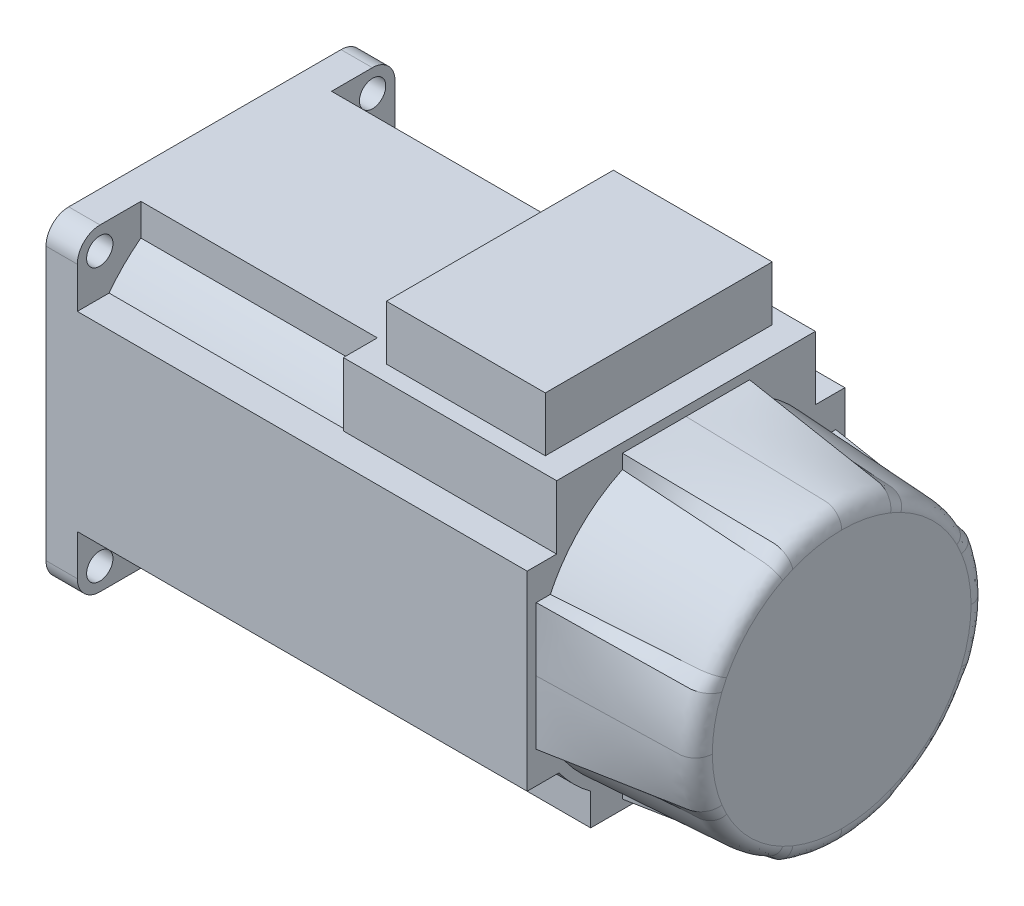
ISO-10303-21;
HEADER;
FILE_DESCRIPTION(('STEP AP214'),'2;1');
FILE_NAME('part.step','',(''),(''),'','','');
FILE_SCHEMA(('AUTOMOTIVE_DESIGN { 1 0 10303 214 1 1 1 1 }'));
ENDSEC;
DATA;
#1=APPLICATION_CONTEXT('core data for automotive mechanical design processes');
#2=APPLICATION_PROTOCOL_DEFINITION('international standard','automotive_design',2000,#1);
#3=PRODUCT_CONTEXT('',#1,'mechanical');
#4=PRODUCT('Part','Part','',(#3));
#5=PRODUCT_RELATED_PRODUCT_CATEGORY('part','',(#4));
#6=PRODUCT_DEFINITION_FORMATION('','',#4);
#7=PRODUCT_DEFINITION_CONTEXT('part definition',#1,'design');
#8=PRODUCT_DEFINITION('design','',#6,#7);
#9=PRODUCT_DEFINITION_SHAPE('','',#8);
#10=(LENGTH_UNIT() NAMED_UNIT(*) SI_UNIT(.MILLI.,.METRE.));
#11=(NAMED_UNIT(*) PLANE_ANGLE_UNIT() SI_UNIT($,.RADIAN.));
#12=(NAMED_UNIT(*) SI_UNIT($,.STERADIAN.) SOLID_ANGLE_UNIT());
#13=UNCERTAINTY_MEASURE_WITH_UNIT(LENGTH_MEASURE(1.E-05),#10,'distance_accuracy_value','');
#14=(GEOMETRIC_REPRESENTATION_CONTEXT(3) GLOBAL_UNCERTAINTY_ASSIGNED_CONTEXT((#13)) GLOBAL_UNIT_ASSIGNED_CONTEXT((#10,
#11,#12)) REPRESENTATION_CONTEXT('',''));
#15=CARTESIAN_POINT('',(0.,0.,0.));
#16=DIRECTION('',(0.,0.,1.));
#17=DIRECTION('',(1.,0.,0.));
#18=AXIS2_PLACEMENT_3D('',#15,#16,#17);
#19=CARTESIAN_POINT('',(6.9,35.,30.));
#20=DIRECTION('',(0.,-1.,0.));
#21=DIRECTION('',(0.,0.,-1.));
#22=AXIS2_PLACEMENT_3D('',#19,#20,#21);
#23=PLANE('',#22);
#24=DIRECTION('',(-1.,0.,0.));
#25=VECTOR('',#24,1.);
#26=CARTESIAN_POINT('',(106.,35.,21.));
#27=LINE('',#26,#25);
#28=CARTESIAN_POINT('',(59.,35.,21.));
#29=VERTEX_POINT('',#28);
#30=CARTESIAN_POINT('',(6.9,35.,21.));
#31=VERTEX_POINT('',#30);
#32=EDGE_CURVE('E727',#29,#31,#27,.T.);
#33=ORIENTED_EDGE('',*,*,#32,.F.);
#34=DIRECTION('',(0.,0.,1.));
#35=VECTOR('',#34,1.);
#36=CARTESIAN_POINT('',(59.,35.,-28.5));
#37=LINE('',#36,#35);
#38=CARTESIAN_POINT('',(59.,35.,28.5));
#39=VERTEX_POINT('',#38);
#40=EDGE_CURVE('E372',#29,#39,#37,.T.);
#41=ORIENTED_EDGE('',*,*,#40,.T.);
#42=DIRECTION('',(1.,0.,0.));
#43=VECTOR('',#42,1.);
#44=CARTESIAN_POINT('',(59.,35.,28.5));
#45=LINE('',#44,#43);
#46=CARTESIAN_POINT('',(106.,35.,28.5));
#47=VERTEX_POINT('',#46);
#48=EDGE_CURVE('E375',#39,#47,#45,.T.);
#49=ORIENTED_EDGE('',*,*,#48,.T.);
#50=DIRECTION('',(0.,0.,1.));
#51=VECTOR('',#50,1.);
#52=CARTESIAN_POINT('',(106.,35.,-21.));
#53=LINE('',#52,#51);
#54=CARTESIAN_POINT('',(106.,35.,-28.5));
#55=VERTEX_POINT('',#54);
#56=EDGE_CURVE('E707',#55,#47,#53,.T.);
#57=ORIENTED_EDGE('',*,*,#56,.F.);
#58=DIRECTION('',(-1.,0.,0.));
#59=VECTOR('',#58,1.);
#60=CARTESIAN_POINT('',(59.,35.,-28.5));
#61=LINE('',#60,#59);
#62=CARTESIAN_POINT('',(59.,35.,-28.5));
#63=VERTEX_POINT('',#62);
#64=EDGE_CURVE('E378',#55,#63,#61,.T.);
#65=ORIENTED_EDGE('',*,*,#64,.T.);
#66=CARTESIAN_POINT('',(59.,35.,-21.));
#67=VERTEX_POINT('',#66);
#68=EDGE_CURVE('E373',#63,#67,#37,.T.);
#69=ORIENTED_EDGE('',*,*,#68,.T.);
#70=DIRECTION('',(-1.,0.,0.));
#71=VECTOR('',#70,1.);
#72=CARTESIAN_POINT('',(106.,35.,-21.));
#73=LINE('',#72,#71);
#74=CARTESIAN_POINT('',(6.9,35.,-21.));
#75=VERTEX_POINT('',#74);
#76=EDGE_CURVE('E729',#67,#75,#73,.T.);
#77=ORIENTED_EDGE('',*,*,#76,.T.);
#78=DIRECTION('',(0.,0.,1.));
#79=VECTOR('',#78,1.);
#80=CARTESIAN_POINT('',(6.9,35.,30.));
#81=LINE('',#80,#79);
#82=CARTESIAN_POINT('',(6.9,35.,-30.));
#83=VERTEX_POINT('',#82);
#84=EDGE_CURVE('E829',#83,#75,#81,.T.);
#85=ORIENTED_EDGE('',*,*,#84,.F.);
#86=DIRECTION('',(-1.,0.,0.));
#87=VECTOR('',#86,1.);
#88=CARTESIAN_POINT('',(6.9,35.,-30.));
#89=LINE('',#88,#87);
#90=CARTESIAN_POINT('',(0.,35.,-30.));
#91=VERTEX_POINT('',#90);
#92=EDGE_CURVE('E835',#83,#91,#89,.T.);
#93=ORIENTED_EDGE('',*,*,#92,.T.);
#94=DIRECTION('',(0.,0.,1.));
#95=VECTOR('',#94,1.);
#96=CARTESIAN_POINT('',(0.,35.,30.));
#97=LINE('',#96,#95);
#98=CARTESIAN_POINT('',(0.,35.,30.));
#99=VERTEX_POINT('',#98);
#100=EDGE_CURVE('E805',#91,#99,#97,.T.);
#101=ORIENTED_EDGE('',*,*,#100,.T.);
#102=DIRECTION('',(-1.,0.,0.));
#103=VECTOR('',#102,1.);
#104=CARTESIAN_POINT('',(6.9,35.,30.));
#105=LINE('',#104,#103);
#106=CARTESIAN_POINT('',(6.9,35.,30.));
#107=VERTEX_POINT('',#106);
#108=EDGE_CURVE('E832',#107,#99,#105,.T.);
#109=ORIENTED_EDGE('',*,*,#108,.F.);
#110=EDGE_CURVE('E828',#31,#107,#81,.T.);
#111=ORIENTED_EDGE('',*,*,#110,.F.);
#112=EDGE_LOOP('',(#33,#41,#49,#57,#65,#69,#77,#85,#93,#101,#109,#111));
#113=FACE_BOUND('',#112,.T.);
#114=DIRECTION('',(0.,0.,-1.));
#115=VECTOR('',#114,1.);
#116=CARTESIAN_POINT('',(100.,35.,-25.));
#117=LINE('',#116,#115);
#118=CARTESIAN_POINT('',(100.,35.,25.));
#119=VERTEX_POINT('',#118);
#120=CARTESIAN_POINT('',(100.,35.,-25.));
#121=VERTEX_POINT('',#120);
#122=EDGE_CURVE('E340',#119,#121,#117,.T.);
#123=ORIENTED_EDGE('',*,*,#122,.F.);
#124=DIRECTION('',(1.,0.,0.));
#125=VECTOR('',#124,1.);
#126=CARTESIAN_POINT('',(100.,35.,25.));
#127=LINE('',#126,#125);
#128=CARTESIAN_POINT('',(65.,35.,25.));
#129=VERTEX_POINT('',#128);
#130=EDGE_CURVE('E342',#129,#119,#127,.T.);
#131=ORIENTED_EDGE('',*,*,#130,.F.);
#132=DIRECTION('',(0.,0.,1.));
#133=VECTOR('',#132,1.);
#134=CARTESIAN_POINT('',(65.,35.,-25.));
#135=LINE('',#134,#133);
#136=CARTESIAN_POINT('',(65.,35.,-25.));
#137=VERTEX_POINT('',#136);
#138=EDGE_CURVE('E35',#137,#129,#135,.T.);
#139=ORIENTED_EDGE('',*,*,#138,.F.);
#140=DIRECTION('',(-1.,0.,0.));
#141=VECTOR('',#140,1.);
#142=CARTESIAN_POINT('',(100.,35.,-25.));
#143=LINE('',#142,#141);
#144=EDGE_CURVE('E30',#121,#137,#143,.T.);
#145=ORIENTED_EDGE('',*,*,#144,.F.);
#146=EDGE_LOOP('',(#123,#131,#139,#145));
#147=FACE_BOUND('',#146,.T.);
#148=ADVANCED_FACE('F15',(#113,#147),#23,.F.);
#149=CARTESIAN_POINT('',(0.,30.,30.));
#150=DIRECTION('',(1.,0.,0.));
#151=DIRECTION('',(0.,0.,-1.));
#152=AXIS2_PLACEMENT_3D('',#149,#150,#151);
#153=PLANE('',#152);
#154=CARTESIAN_POINT('',(0.,-30.0520382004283,30.0520382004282));
#155=DIRECTION('',(-1.,0.,0.));
#156=DIRECTION('',(0.,0.,1.));
#157=AXIS2_PLACEMENT_3D('',#154,#155,#156);
#158=CIRCLE('',#157,2.9);
#159=CARTESIAN_POINT('',(0.,-30.0520382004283,32.9520382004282));
#160=VERTEX_POINT('',#159);
#161=EDGE_CURVE('E407',#160,#160,#158,.T.);
#162=ORIENTED_EDGE('',*,*,#161,.F.);
#163=EDGE_LOOP('',(#162));
#164=FACE_BOUND('',#163,.T.);
#165=CARTESIAN_POINT('',(0.,30.0520382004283,30.0520382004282));
#166=DIRECTION('',(-1.,0.,0.));
#167=DIRECTION('',(0.,0.,1.));
#168=AXIS2_PLACEMENT_3D('',#165,#166,#167);
#169=CIRCLE('',#168,2.9);
#170=CARTESIAN_POINT('',(0.,30.0520382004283,32.9520382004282));
#171=VERTEX_POINT('',#170);
#172=EDGE_CURVE('E411',#171,#171,#169,.T.);
#173=ORIENTED_EDGE('',*,*,#172,.F.);
#174=EDGE_LOOP('',(#173));
#175=FACE_BOUND('',#174,.T.);
#176=CARTESIAN_POINT('',(0.,30.0520382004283,-30.0520382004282));
#177=DIRECTION('',(-1.,0.,0.));
#178=DIRECTION('',(0.,0.,1.));
#179=AXIS2_PLACEMENT_3D('',#176,#177,#178);
#180=CIRCLE('',#179,2.9);
#181=CARTESIAN_POINT('',(0.,30.0520382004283,-27.1520382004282));
#182=VERTEX_POINT('',#181);
#183=EDGE_CURVE('E415',#182,#182,#180,.T.);
#184=ORIENTED_EDGE('',*,*,#183,.F.);
#185=EDGE_LOOP('',(#184));
#186=FACE_BOUND('',#185,.T.);
#187=CARTESIAN_POINT('',(0.,-30.0520382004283,-30.0520382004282));
#188=DIRECTION('',(-1.,0.,0.));
#189=DIRECTION('',(0.,0.,1.));
#190=AXIS2_PLACEMENT_3D('',#187,#188,#189);
#191=CIRCLE('',#190,2.9);
#192=CARTESIAN_POINT('',(0.,-30.0520382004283,-27.1520382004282));
#193=VERTEX_POINT('',#192);
#194=EDGE_CURVE('E419',#193,#193,#191,.T.);
#195=ORIENTED_EDGE('',*,*,#194,.F.);
#196=EDGE_LOOP('',(#195));
#197=FACE_BOUND('',#196,.T.);
#198=CARTESIAN_POINT('',(0.,-30.,-30.));
#199=DIRECTION('',(1.,0.,0.));
#200=DIRECTION('',(0.,0.,-1.));
#201=AXIS2_PLACEMENT_3D('',#198,#199,#200);
#202=CIRCLE('',#201,5.);
#203=CARTESIAN_POINT('',(0.,-35.,-30.));
#204=VERTEX_POINT('',#203);
#205=CARTESIAN_POINT('',(0.,-30.,-35.));
#206=VERTEX_POINT('',#205);
#207=EDGE_CURVE('E799',#204,#206,#202,.T.);
#208=ORIENTED_EDGE('',*,*,#207,.F.);
#209=DIRECTION('',(0.,0.,-1.));
#210=VECTOR('',#209,1.);
#211=CARTESIAN_POINT('',(0.,-35.,30.));
#212=LINE('',#211,#210);
#213=CARTESIAN_POINT('',(0.,-35.,30.));
#214=VERTEX_POINT('',#213);
#215=EDGE_CURVE('E797',#214,#204,#212,.T.);
#216=ORIENTED_EDGE('',*,*,#215,.F.);
#217=CARTESIAN_POINT('',(0.,-30.,30.));
#218=DIRECTION('',(1.,0.,0.));
#219=DIRECTION('',(0.,0.,-1.));
#220=AXIS2_PLACEMENT_3D('',#217,#218,#219);
#221=CIRCLE('',#220,5.);
#222=CARTESIAN_POINT('',(0.,-30.,35.));
#223=VERTEX_POINT('',#222);
#224=EDGE_CURVE('E795',#223,#214,#221,.T.);
#225=ORIENTED_EDGE('',*,*,#224,.F.);
#226=DIRECTION('',(0.,-1.,0.));
#227=VECTOR('',#226,1.);
#228=CARTESIAN_POINT('',(0.,30.,35.));
#229=LINE('',#228,#227);
#230=CARTESIAN_POINT('',(0.,30.,35.));
#231=VERTEX_POINT('',#230);
#232=EDGE_CURVE('E793',#231,#223,#229,.T.);
#233=ORIENTED_EDGE('',*,*,#232,.F.);
#234=CARTESIAN_POINT('',(0.,30.,30.));
#235=DIRECTION('',(1.,0.,0.));
#236=DIRECTION('',(0.,0.,-1.));
#237=AXIS2_PLACEMENT_3D('',#234,#235,#236);
#238=CIRCLE('',#237,5.);
#239=EDGE_CURVE('E790',#99,#231,#238,.T.);
#240=ORIENTED_EDGE('',*,*,#239,.F.);
#241=ORIENTED_EDGE('',*,*,#100,.F.);
#242=CARTESIAN_POINT('',(0.,30.,-30.));
#243=DIRECTION('',(1.,0.,0.));
#244=DIRECTION('',(0.,0.,1.));
#245=AXIS2_PLACEMENT_3D('',#242,#243,#244);
#246=CIRCLE('',#245,5.);
#247=CARTESIAN_POINT('',(0.,30.,-35.));
#248=VERTEX_POINT('',#247);
#249=EDGE_CURVE('E803',#248,#91,#246,.T.);
#250=ORIENTED_EDGE('',*,*,#249,.F.);
#251=DIRECTION('',(0.,1.,0.));
#252=VECTOR('',#251,1.);
#253=CARTESIAN_POINT('',(0.,30.,-35.));
#254=LINE('',#253,#252);
#255=EDGE_CURVE('E801',#206,#248,#254,.T.);
#256=ORIENTED_EDGE('',*,*,#255,.F.);
#257=EDGE_LOOP('',(#208,#216,#225,#233,#240,#241,#250,#256));
#258=FACE_BOUND('',#257,.T.);
#259=CARTESIAN_POINT('',(0.,0.,0.));
#260=DIRECTION('',(1.,0.,0.));
#261=DIRECTION('',(0.,0.,-1.));
#262=AXIS2_PLACEMENT_3D('',#259,#260,#261);
#263=CIRCLE('',#262,27.5);
#264=CARTESIAN_POINT('',(0.,0.,-27.5));
#265=VERTEX_POINT('',#264);
#266=EDGE_CURVE('E855',#265,#265,#263,.F.);
#267=ORIENTED_EDGE('',*,*,#266,.F.);
#268=EDGE_LOOP('',(#267));
#269=FACE_BOUND('',#268,.T.);
#270=ADVANCED_FACE('F479',(#164,#175,#186,#197,#258,#269),#153,.F.);
#271=CARTESIAN_POINT('',(106.,0.,0.));
#272=DIRECTION('',(1.,0.,0.));
#273=DIRECTION('',(0.,0.,-1.));
#274=AXIS2_PLACEMENT_3D('',#271,#272,#273);
#275=PLANE('',#274);
#276=DIRECTION('',(0.,0.,1.));
#277=VECTOR('',#276,1.);
#278=CARTESIAN_POINT('',(106.,21.,-28.));
#279=LINE('',#278,#277);
#280=CARTESIAN_POINT('',(106.,21.,-35.));
#281=VERTEX_POINT('',#280);
#282=CARTESIAN_POINT('',(106.,21.,-28.5));
#283=VERTEX_POINT('',#282);
#284=EDGE_CURVE('E704',#281,#283,#279,.T.);
#285=ORIENTED_EDGE('',*,*,#284,.T.);
#286=DIRECTION('',(0.,1.,0.));
#287=VECTOR('',#286,1.);
#288=CARTESIAN_POINT('',(106.,11.,-28.5));
#289=LINE('',#288,#287);
#290=EDGE_CURVE('E385',#283,#55,#289,.T.);
#291=ORIENTED_EDGE('',*,*,#290,.T.);
#292=ORIENTED_EDGE('',*,*,#56,.T.);
#293=DIRECTION('',(0.,1.,0.));
#294=VECTOR('',#293,1.);
#295=CARTESIAN_POINT('',(106.,11.,28.5));
#296=LINE('',#295,#294);
#297=CARTESIAN_POINT('',(106.,21.,28.5));
#298=VERTEX_POINT('',#297);
#299=EDGE_CURVE('E388',#298,#47,#296,.T.);
#300=ORIENTED_EDGE('',*,*,#299,.F.);
#301=DIRECTION('',(0.,0.,1.));
#302=VECTOR('',#301,1.);
#303=CARTESIAN_POINT('',(106.,21.,35.));
#304=LINE('',#303,#302);
#305=CARTESIAN_POINT('',(106.,21.,35.));
#306=VERTEX_POINT('',#305);
#307=EDGE_CURVE('E709',#298,#306,#304,.T.);
#308=ORIENTED_EDGE('',*,*,#307,.T.);
#309=DIRECTION('',(0.,-1.,0.));
#310=VECTOR('',#309,1.);
#311=CARTESIAN_POINT('',(106.,21.,35.));
#312=LINE('',#311,#310);
#313=CARTESIAN_POINT('',(106.,-21.,35.));
#314=VERTEX_POINT('',#313);
#315=EDGE_CURVE('E711',#306,#314,#312,.T.);
#316=ORIENTED_EDGE('',*,*,#315,.T.);
#317=DIRECTION('',(0.,0.,-1.));
#318=VECTOR('',#317,1.);
#319=CARTESIAN_POINT('',(106.,-21.,35.));
#320=LINE('',#319,#318);
#321=CARTESIAN_POINT('',(106.,-21.,28.));
#322=VERTEX_POINT('',#321);
#323=EDGE_CURVE('E713',#314,#322,#320,.T.);
#324=ORIENTED_EDGE('',*,*,#323,.T.);
#325=CARTESIAN_POINT('',(106.,0.,0.));
#326=DIRECTION('',(1.,0.,0.));
#327=DIRECTION('',(0.,0.,-1.));
#328=AXIS2_PLACEMENT_3D('',#325,#326,#327);
#329=CIRCLE('',#328,35.);
#330=CARTESIAN_POINT('',(106.,-28.,21.));
#331=VERTEX_POINT('',#330);
#332=EDGE_CURVE('E683',#322,#331,#329,.T.);
#333=ORIENTED_EDGE('',*,*,#332,.T.);
#334=DIRECTION('',(0.,-1.,0.));
#335=VECTOR('',#334,1.);
#336=CARTESIAN_POINT('',(106.,-28.,21.));
#337=LINE('',#336,#335);
#338=CARTESIAN_POINT('',(106.,-35.,21.));
#339=VERTEX_POINT('',#338);
#340=EDGE_CURVE('E691',#331,#339,#337,.T.);
#341=ORIENTED_EDGE('',*,*,#340,.T.);
#342=DIRECTION('',(0.,0.,-1.));
#343=VECTOR('',#342,1.);
#344=CARTESIAN_POINT('',(106.,-35.,21.));
#345=LINE('',#344,#343);
#346=CARTESIAN_POINT('',(106.,-35.,-21.));
#347=VERTEX_POINT('',#346);
#348=EDGE_CURVE('E694',#339,#347,#345,.T.);
#349=ORIENTED_EDGE('',*,*,#348,.T.);
#350=DIRECTION('',(0.,1.,0.));
#351=VECTOR('',#350,1.);
#352=CARTESIAN_POINT('',(106.,-28.,-21.));
#353=LINE('',#352,#351);
#354=CARTESIAN_POINT('',(106.,-28.,-21.));
#355=VERTEX_POINT('',#354);
#356=EDGE_CURVE('E696',#347,#355,#353,.T.);
#357=ORIENTED_EDGE('',*,*,#356,.T.);
#358=CARTESIAN_POINT('',(106.,0.,0.));
#359=DIRECTION('',(1.,0.,0.));
#360=DIRECTION('',(0.,0.,-1.));
#361=AXIS2_PLACEMENT_3D('',#358,#359,#360);
#362=CIRCLE('',#361,35.);
#363=CARTESIAN_POINT('',(106.,-21.,-28.));
#364=VERTEX_POINT('',#363);
#365=EDGE_CURVE('E698',#355,#364,#362,.T.);
#366=ORIENTED_EDGE('',*,*,#365,.T.);
#367=DIRECTION('',(0.,0.,-1.));
#368=VECTOR('',#367,1.);
#369=CARTESIAN_POINT('',(106.,-21.,-28.));
#370=LINE('',#369,#368);
#371=CARTESIAN_POINT('',(106.,-21.,-35.));
#372=VERTEX_POINT('',#371);
#373=EDGE_CURVE('E700',#364,#372,#370,.T.);
#374=ORIENTED_EDGE('',*,*,#373,.T.);
#375=DIRECTION('',(0.,1.,0.));
#376=VECTOR('',#375,1.);
#377=CARTESIAN_POINT('',(106.,-21.,-35.));
#378=LINE('',#377,#376);
#379=EDGE_CURVE('E702',#372,#281,#378,.T.);
#380=ORIENTED_EDGE('',*,*,#379,.T.);
#381=EDGE_LOOP('',(#285,#291,#292,#300,#308,#316,#324,#333,#341,#349,#357,#366,#374,#380));
#382=FACE_BOUND('',#381,.T.);
#383=DIRECTION('',(0.,1.,0.));
#384=VECTOR('',#383,1.);
#385=CARTESIAN_POINT('',(106.,0.,-13.9999999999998));
#386=LINE('',#385,#384);
#387=CARTESIAN_POINT('',(106.,29.883105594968,-13.9999999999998));
#388=VERTEX_POINT('',#387);
#389=CARTESIAN_POINT('',(106.,33.,-13.9999999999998));
#390=VERTEX_POINT('',#389);
#391=EDGE_CURVE('E648',#388,#390,#386,.T.);
#392=ORIENTED_EDGE('',*,*,#391,.F.);
#393=CARTESIAN_POINT('',(106.,14.,-29.8831055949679));
#394=CARTESIAN_POINT('',(106.,14.4929698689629,-29.6521686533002));
#395=CARTESIAN_POINT('',(106.,14.9802167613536,-29.4090173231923));
#396=CARTESIAN_POINT('',(106.,15.9420883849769,-28.8989197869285));
#397=CARTESIAN_POINT('',(106.,16.416713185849,-28.6319737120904));
#398=CARTESIAN_POINT('',(106.,17.3521707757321,-28.0749174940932));
#399=CARTESIAN_POINT('',(106.,17.813003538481,-27.7848073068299));
#400=CARTESIAN_POINT('',(106.,18.7200973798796,-27.1819081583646));
#401=CARTESIAN_POINT('',(106.,19.1663469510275,-26.8691018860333));
#402=CARTESIAN_POINT('',(106.,20.0428070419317,-26.2217784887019));
#403=CARTESIAN_POINT('',(106.,20.4730178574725,-25.887261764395));
#404=CARTESIAN_POINT('',(106.,21.3163231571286,-25.1973716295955));
#405=CARTESIAN_POINT('',(106.,21.7294181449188,-24.8419988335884));
#406=CARTESIAN_POINT('',(106.,22.7397698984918,-23.9283305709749));
#407=CARTESIAN_POINT('',(106.,23.3257483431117,-23.3574738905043));
#408=CARTESIAN_POINT('',(106.,24.4537347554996,-22.1738174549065));
#409=CARTESIAN_POINT('',(106.,24.9957382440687,-21.561013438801));
#410=CARTESIAN_POINT('',(106.,26.0320142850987,-20.2977608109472));
#411=CARTESIAN_POINT('',(106.,26.5263539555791,-19.6473672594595));
#412=CARTESIAN_POINT('',(106.,27.465282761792,-18.3119113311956));
#413=CARTESIAN_POINT('',(106.,27.9098902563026,-17.6268618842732));
#414=CARTESIAN_POINT('',(106.,28.6120027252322,-16.4517826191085));
#415=CARTESIAN_POINT('',(106.,28.8836041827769,-15.9701136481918));
#416=CARTESIAN_POINT('',(106.,29.4020028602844,-14.9942624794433));
#417=CARTESIAN_POINT('',(106.,29.6488260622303,-14.5000940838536));
#418=CARTESIAN_POINT('',(106.,29.883105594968,-13.9999999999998));
#419=B_SPLINE_CURVE_WITH_KNOTS('',3,(#393,#394,#395,#396,#397,#398,#399,#400,#401,#402,#403,
#404,#405,#406,#407,#408,#409,#410,#411,#412,#413,#414,#415,#416,#417,#418),.UNSPECIFIED.,.F.,
.F.,(4,2,2,2,2,2,2,2,2,2,2,2,4),(0.,1.632976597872,3.26594418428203,4.89891487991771,
6.53314446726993,8.16734390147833,9.80149521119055,12.25333181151,14.7054178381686,
17.1539989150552,19.6016730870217,21.2599202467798,22.9164100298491),.UNSPECIFIED.);
#420=CARTESIAN_POINT('',(106.,14.,-29.8831055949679));
#421=VERTEX_POINT('',#420);
#422=EDGE_CURVE('E494',#421,#388,#419,.T.);
#423=ORIENTED_EDGE('',*,*,#422,.F.);
#424=DIRECTION('',(0.,0.,-1.));
#425=VECTOR('',#424,1.);
#426=CARTESIAN_POINT('',(106.,14.,0.));
#427=LINE('',#426,#425);
#428=CARTESIAN_POINT('',(106.,14.,-33.));
#429=VERTEX_POINT('',#428);
#430=EDGE_CURVE('E943',#429,#421,#427,.F.);
#431=ORIENTED_EDGE('',*,*,#430,.F.);
#432=DIRECTION('',(0.,1.,0.));
#433=VECTOR('',#432,1.);
#434=CARTESIAN_POINT('',(106.,0.,-33.));
#435=LINE('',#434,#433);
#436=CARTESIAN_POINT('',(106.,0.,-33.));
#437=VERTEX_POINT('',#436);
#438=EDGE_CURVE('E962',#437,#429,#435,.T.);
#439=ORIENTED_EDGE('',*,*,#438,.F.);
#440=DIRECTION('',(0.,1.,0.));
#441=VECTOR('',#440,1.);
#442=CARTESIAN_POINT('',(106.,0.,-33.));
#443=LINE('',#442,#441);
#444=CARTESIAN_POINT('',(106.,-14.,-33.));
#445=VERTEX_POINT('',#444);
#446=EDGE_CURVE('E979',#445,#437,#443,.T.);
#447=ORIENTED_EDGE('',*,*,#446,.F.);
#448=DIRECTION('',(0.,0.,-1.));
#449=VECTOR('',#448,1.);
#450=CARTESIAN_POINT('',(106.,-14.,0.));
#451=LINE('',#450,#449);
#452=CARTESIAN_POINT('',(106.,-14.,-29.8831055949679));
#453=VERTEX_POINT('',#452);
#454=EDGE_CURVE('E512',#453,#445,#451,.T.);
#455=ORIENTED_EDGE('',*,*,#454,.F.);
#456=CARTESIAN_POINT('',(106.,-29.883105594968,-13.9999999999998));
#457=CARTESIAN_POINT('',(106.,-29.6521686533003,-14.4929698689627));
#458=CARTESIAN_POINT('',(106.,-29.4090173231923,-14.9802167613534));
#459=CARTESIAN_POINT('',(106.,-28.8989197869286,-15.9420883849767));
#460=CARTESIAN_POINT('',(106.,-28.6319737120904,-16.4167131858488));
#461=CARTESIAN_POINT('',(106.,-28.0749174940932,-17.352170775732));
#462=CARTESIAN_POINT('',(106.,-27.7848073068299,-17.8130035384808));
#463=CARTESIAN_POINT('',(106.,-27.1819081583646,-18.7200973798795));
#464=CARTESIAN_POINT('',(106.,-26.8691018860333,-19.1663469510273));
#465=CARTESIAN_POINT('',(106.,-26.221778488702,-20.0428070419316));
#466=CARTESIAN_POINT('',(106.,-25.8872617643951,-20.4730178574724));
#467=CARTESIAN_POINT('',(106.,-25.1973716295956,-21.3163231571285));
#468=CARTESIAN_POINT('',(106.,-24.8419988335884,-21.7294181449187));
#469=CARTESIAN_POINT('',(106.,-23.9283305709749,-22.7397698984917));
#470=CARTESIAN_POINT('',(106.,-23.3574738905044,-23.3257483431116));
#471=CARTESIAN_POINT('',(106.,-22.1738174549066,-24.4537347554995));
#472=CARTESIAN_POINT('',(106.,-21.5610134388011,-24.9957382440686));
#473=CARTESIAN_POINT('',(106.,-20.2977608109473,-26.0320142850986));
#474=CARTESIAN_POINT('',(106.,-19.6473672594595,-26.526353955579));
#475=CARTESIAN_POINT('',(106.,-18.3119113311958,-27.4652827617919));
#476=CARTESIAN_POINT('',(106.,-17.6268618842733,-27.9098902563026));
#477=CARTESIAN_POINT('',(106.,-16.4517826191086,-28.6120027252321));
#478=CARTESIAN_POINT('',(106.,-15.970113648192,-28.8836041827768));
#479=CARTESIAN_POINT('',(106.,-14.9942624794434,-29.4020028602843));
#480=CARTESIAN_POINT('',(106.,-14.5000940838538,-29.6488260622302));
#481=CARTESIAN_POINT('',(106.,-14.,-29.8831055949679));
#482=B_SPLINE_CURVE_WITH_KNOTS('',3,(#456,#457,#458,#459,#460,#461,#462,#463,#464,#465,#466,
#467,#468,#469,#470,#471,#472,#473,#474,#475,#476,#477,#478,#479,#480,#481),.UNSPECIFIED.,.F.,
.F.,(4,2,2,2,2,2,2,2,2,2,2,2,4),(0.,1.63297659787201,3.26594418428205,4.89891487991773,
6.53314446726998,8.16734390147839,9.80149521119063,12.25333181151,14.7054178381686,
17.1539989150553,19.6016730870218,21.2599202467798,22.9164100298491),.UNSPECIFIED.);
#483=CARTESIAN_POINT('',(106.,-29.883105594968,-13.9999999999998));
#484=VERTEX_POINT('',#483);
#485=EDGE_CURVE('E502',#484,#453,#482,.T.);
#486=ORIENTED_EDGE('',*,*,#485,.F.);
#487=DIRECTION('',(0.,1.,0.));
#488=VECTOR('',#487,1.);
#489=CARTESIAN_POINT('',(106.,0.,-13.9999999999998));
#490=LINE('',#489,#488);
#491=CARTESIAN_POINT('',(106.,-33.,-13.9999999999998));
#492=VERTEX_POINT('',#491);
#493=EDGE_CURVE('E514',#492,#484,#490,.T.);
#494=ORIENTED_EDGE('',*,*,#493,.F.);
#495=DIRECTION('',(0.,0.,-1.));
#496=VECTOR('',#495,1.);
#497=CARTESIAN_POINT('',(106.,-33.,0.));
#498=LINE('',#497,#496);
#499=CARTESIAN_POINT('',(106.,-33.,0.));
#500=VERTEX_POINT('',#499);
#501=EDGE_CURVE('E1832',#500,#492,#498,.T.);
#502=ORIENTED_EDGE('',*,*,#501,.F.);
#503=DIRECTION('',(0.,0.,-1.));
#504=VECTOR('',#503,1.);
#505=CARTESIAN_POINT('',(106.,-33.,0.));
#506=LINE('',#505,#504);
#507=CARTESIAN_POINT('',(106.,-33.,13.9999999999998));
#508=VERTEX_POINT('',#507);
#509=EDGE_CURVE('E1656',#508,#500,#506,.T.);
#510=ORIENTED_EDGE('',*,*,#509,.F.);
#511=DIRECTION('',(0.,1.,0.));
#512=VECTOR('',#511,1.);
#513=CARTESIAN_POINT('',(106.,0.,13.9999999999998));
#514=LINE('',#513,#512);
#515=CARTESIAN_POINT('',(106.,-29.883105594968,13.9999999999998));
#516=VERTEX_POINT('',#515);
#517=EDGE_CURVE('E1614',#516,#508,#514,.F.);
#518=ORIENTED_EDGE('',*,*,#517,.F.);
#519=CARTESIAN_POINT('',(106.,-14.,29.8831055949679));
#520=CARTESIAN_POINT('',(106.,-14.4929698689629,29.6521686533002));
#521=CARTESIAN_POINT('',(106.,-14.9802167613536,29.4090173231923));
#522=CARTESIAN_POINT('',(106.,-15.9420883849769,28.8989197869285));
#523=CARTESIAN_POINT('',(106.,-16.416713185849,28.6319737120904));
#524=CARTESIAN_POINT('',(106.,-17.3521707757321,28.0749174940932));
#525=CARTESIAN_POINT('',(106.,-17.813003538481,27.7848073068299));
#526=CARTESIAN_POINT('',(106.,-18.7200973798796,27.1819081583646));
#527=CARTESIAN_POINT('',(106.,-19.1663469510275,26.8691018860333));
#528=CARTESIAN_POINT('',(106.,-20.0428070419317,26.2217784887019));
#529=CARTESIAN_POINT('',(106.,-20.4730178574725,25.887261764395));
#530=CARTESIAN_POINT('',(106.,-21.3163231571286,25.1973716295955));
#531=CARTESIAN_POINT('',(106.,-21.7294181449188,24.8419988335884));
#532=CARTESIAN_POINT('',(106.,-22.7397698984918,23.9283305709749));
#533=CARTESIAN_POINT('',(106.,-23.3257483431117,23.3574738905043));
#534=CARTESIAN_POINT('',(106.,-24.4537347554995,22.1738174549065));
#535=CARTESIAN_POINT('',(106.,-24.9957382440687,21.561013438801));
#536=CARTESIAN_POINT('',(106.,-26.0320142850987,20.2977608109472));
#537=CARTESIAN_POINT('',(106.,-26.526353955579,19.6473672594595));
#538=CARTESIAN_POINT('',(106.,-27.465282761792,18.3119113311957));
#539=CARTESIAN_POINT('',(106.,-27.9098902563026,17.6268618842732));
#540=CARTESIAN_POINT('',(106.,-28.6120027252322,16.4517826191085));
#541=CARTESIAN_POINT('',(106.,-28.8836041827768,15.9701136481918));
#542=CARTESIAN_POINT('',(106.,-29.4020028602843,14.9942624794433));
#543=CARTESIAN_POINT('',(106.,-29.6488260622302,14.5000940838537));
#544=CARTESIAN_POINT('',(106.,-29.883105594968,13.9999999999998));
#545=B_SPLINE_CURVE_WITH_KNOTS('',3,(#519,#520,#521,#522,#523,#524,#525,#526,#527,#528,#529,
#530,#531,#532,#533,#534,#535,#536,#537,#538,#539,#540,#541,#542,#543,#544),.UNSPECIFIED.,.F.,
.F.,(4,2,2,2,2,2,2,2,2,2,2,2,4),(0.,1.632976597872,3.26594418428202,4.89891487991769,
6.53314446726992,8.16734390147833,9.80149521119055,12.25333181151,14.7054178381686,
17.1539989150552,19.6016730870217,21.2599202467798,22.9164100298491),.UNSPECIFIED.);
#546=CARTESIAN_POINT('',(106.,-14.,29.8831055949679));
#547=VERTEX_POINT('',#546);
#548=EDGE_CURVE('E1606',#547,#516,#545,.T.);
#549=ORIENTED_EDGE('',*,*,#548,.F.);
#550=DIRECTION('',(0.,0.,-1.));
#551=VECTOR('',#550,1.);
#552=CARTESIAN_POINT('',(106.,-14.,0.));
#553=LINE('',#552,#551);
#554=CARTESIAN_POINT('',(106.,-14.,33.));
#555=VERTEX_POINT('',#554);
#556=EDGE_CURVE('E1602',#555,#547,#553,.T.);
#557=ORIENTED_EDGE('',*,*,#556,.F.);
#558=DIRECTION('',(0.,1.,0.));
#559=VECTOR('',#558,1.);
#560=CARTESIAN_POINT('',(106.,0.,33.));
#561=LINE('',#560,#559);
#562=CARTESIAN_POINT('',(106.,0.,33.));
#563=VERTEX_POINT('',#562);
#564=EDGE_CURVE('E1597',#563,#555,#561,.F.);
#565=ORIENTED_EDGE('',*,*,#564,.F.);
#566=DIRECTION('',(0.,1.,0.));
#567=VECTOR('',#566,1.);
#568=CARTESIAN_POINT('',(106.,0.,33.));
#569=LINE('',#568,#567);
#570=CARTESIAN_POINT('',(106.,14.,33.));
#571=VERTEX_POINT('',#570);
#572=EDGE_CURVE('E1592',#571,#563,#569,.F.);
#573=ORIENTED_EDGE('',*,*,#572,.F.);
#574=DIRECTION('',(0.,0.,-1.));
#575=VECTOR('',#574,1.);
#576=CARTESIAN_POINT('',(106.,14.,0.));
#577=LINE('',#576,#575);
#578=CARTESIAN_POINT('',(106.,14.,29.8831055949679));
#579=VERTEX_POINT('',#578);
#580=EDGE_CURVE('E1587',#579,#571,#577,.F.);
#581=ORIENTED_EDGE('',*,*,#580,.F.);
#582=CARTESIAN_POINT('',(106.,29.883105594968,13.9999999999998));
#583=CARTESIAN_POINT('',(106.,29.6521686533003,14.4929698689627));
#584=CARTESIAN_POINT('',(106.,29.4090173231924,14.9802167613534));
#585=CARTESIAN_POINT('',(106.,28.8989197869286,15.9420883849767));
#586=CARTESIAN_POINT('',(106.,28.6319737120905,16.4167131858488));
#587=CARTESIAN_POINT('',(106.,28.0749174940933,17.3521707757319));
#588=CARTESIAN_POINT('',(106.,27.78480730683,17.8130035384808));
#589=CARTESIAN_POINT('',(106.,27.1819081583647,18.7200973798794));
#590=CARTESIAN_POINT('',(106.,26.8691018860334,19.1663469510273));
#591=CARTESIAN_POINT('',(106.,26.221778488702,20.0428070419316));
#592=CARTESIAN_POINT('',(106.,25.8872617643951,20.4730178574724));
#593=CARTESIAN_POINT('',(106.,25.1973716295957,21.3163231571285));
#594=CARTESIAN_POINT('',(106.,24.8419988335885,21.7294181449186));
#595=CARTESIAN_POINT('',(106.,23.928330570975,22.7397698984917));
#596=CARTESIAN_POINT('',(106.,23.3574738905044,23.3257483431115));
#597=CARTESIAN_POINT('',(106.,22.1738174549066,24.4537347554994));
#598=CARTESIAN_POINT('',(106.,21.5610134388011,24.9957382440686));
#599=CARTESIAN_POINT('',(106.,20.2977608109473,26.0320142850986));
#600=CARTESIAN_POINT('',(106.,19.6473672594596,26.5263539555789));
#601=CARTESIAN_POINT('',(106.,18.3119113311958,27.4652827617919));
#602=CARTESIAN_POINT('',(106.,17.6268618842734,27.9098902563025));
#603=CARTESIAN_POINT('',(106.,16.4517826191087,28.6120027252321));
#604=CARTESIAN_POINT('',(106.,15.970113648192,28.8836041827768));
#605=CARTESIAN_POINT('',(106.,14.9942624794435,29.4020028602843));
#606=CARTESIAN_POINT('',(106.,14.5000940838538,29.6488260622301));
#607=CARTESIAN_POINT('',(106.,14.,29.8831055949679));
#608=B_SPLINE_CURVE_WITH_KNOTS('',3,(#582,#583,#584,#585,#586,#587,#588,#589,#590,#591,#592,
#593,#594,#595,#596,#597,#598,#599,#600,#601,#602,#603,#604,#605,#606,#607),.UNSPECIFIED.,.F.,
.F.,(4,2,2,2,2,2,2,2,2,2,2,2,4),(0.,1.632976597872,3.26594418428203,4.8989148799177,
6.53314446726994,8.16734390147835,9.80149521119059,12.25333181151,14.7054178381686,
17.1539989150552,19.6016730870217,21.2599202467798,22.9164100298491),.UNSPECIFIED.);
#609=CARTESIAN_POINT('',(106.,29.883105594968,13.9999999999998));
#610=VERTEX_POINT('',#609);
#611=EDGE_CURVE('E485',#610,#579,#608,.T.);
#612=ORIENTED_EDGE('',*,*,#611,.F.);
#613=DIRECTION('',(0.,1.,0.));
#614=VECTOR('',#613,1.);
#615=CARTESIAN_POINT('',(106.,0.,13.9999999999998));
#616=LINE('',#615,#614);
#617=CARTESIAN_POINT('',(106.,33.,13.9999999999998));
#618=VERTEX_POINT('',#617);
#619=EDGE_CURVE('E861',#618,#610,#616,.F.);
#620=ORIENTED_EDGE('',*,*,#619,.F.);
#621=DIRECTION('',(0.,0.,-1.));
#622=VECTOR('',#621,1.);
#623=CARTESIAN_POINT('',(106.,33.,0.));
#624=LINE('',#623,#622);
#625=CARTESIAN_POINT('',(106.,33.,0.));
#626=VERTEX_POINT('',#625);
#627=EDGE_CURVE('E692',#626,#618,#624,.F.);
#628=ORIENTED_EDGE('',*,*,#627,.F.);
#629=DIRECTION('',(0.,0.,-1.));
#630=VECTOR('',#629,1.);
#631=CARTESIAN_POINT('',(106.,33.,0.));
#632=LINE('',#631,#630);
#633=EDGE_CURVE('E672',#390,#626,#632,.F.);
#634=ORIENTED_EDGE('',*,*,#633,.F.);
#635=EDGE_LOOP('',(#392,#423,#431,#439,#447,#455,#486,#494,#502,#510,#518,#549,#557,#565,#573,
#581,#612,#620,#628,#634));
#636=FACE_BOUND('',#635,.T.);
#637=ADVANCED_FACE('F469',(#382,#636),#275,.T.);
#638=CARTESIAN_POINT('',(6.9,30.,30.));
#639=DIRECTION('',(1.,0.,0.));
#640=DIRECTION('',(0.,0.,-1.));
#641=AXIS2_PLACEMENT_3D('',#638,#639,#640);
#642=PLANE('',#641);
#643=CARTESIAN_POINT('',(6.9,-30.0520382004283,-30.0520382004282));
#644=DIRECTION('',(1.,0.,0.));
#645=DIRECTION('',(0.,0.,-1.));
#646=AXIS2_PLACEMENT_3D('',#643,#644,#645);
#647=CIRCLE('',#646,2.9);
#648=CARTESIAN_POINT('',(6.9,-30.0520382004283,-32.9520382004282));
#649=VERTEX_POINT('',#648);
#650=EDGE_CURVE('E422',#649,#649,#647,.T.);
#651=ORIENTED_EDGE('',*,*,#650,.F.);
#652=EDGE_LOOP('',(#651));
#653=FACE_BOUND('',#652,.T.);
#654=CARTESIAN_POINT('',(6.9,0.,0.));
#655=DIRECTION('',(1.,0.,0.));
#656=DIRECTION('',(0.,0.,-1.));
#657=AXIS2_PLACEMENT_3D('',#654,#655,#656);
#658=CIRCLE('',#657,35.);
#659=CARTESIAN_POINT('',(6.9,-21.,-28.));
#660=VERTEX_POINT('',#659);
#661=CARTESIAN_POINT('',(6.9,-28.,-21.));
#662=VERTEX_POINT('',#661);
#663=EDGE_CURVE('E778',#660,#662,#658,.F.);
#664=ORIENTED_EDGE('',*,*,#663,.T.);
#665=DIRECTION('',(0.,-1.,0.));
#666=VECTOR('',#665,1.);
#667=CARTESIAN_POINT('',(6.9,30.,-21.));
#668=LINE('',#667,#666);
#669=CARTESIAN_POINT('',(6.9,-35.,-21.));
#670=VERTEX_POINT('',#669);
#671=EDGE_CURVE('E781',#662,#670,#668,.T.);
#672=ORIENTED_EDGE('',*,*,#671,.T.);
#673=DIRECTION('',(0.,0.,-1.));
#674=VECTOR('',#673,1.);
#675=CARTESIAN_POINT('',(6.9,-35.,30.));
#676=LINE('',#675,#674);
#677=CARTESIAN_POINT('',(6.9,-35.,-30.));
#678=VERTEX_POINT('',#677);
#679=EDGE_CURVE('E816',#670,#678,#676,.T.);
#680=ORIENTED_EDGE('',*,*,#679,.T.);
#681=CARTESIAN_POINT('',(6.9,-30.,-30.));
#682=DIRECTION('',(1.,0.,0.));
#683=DIRECTION('',(0.,0.,-1.));
#684=AXIS2_PLACEMENT_3D('',#681,#682,#683);
#685=CIRCLE('',#684,5.);
#686=CARTESIAN_POINT('',(6.9,-30.,-35.));
#687=VERTEX_POINT('',#686);
#688=EDGE_CURVE('E820',#678,#687,#685,.T.);
#689=ORIENTED_EDGE('',*,*,#688,.T.);
#690=DIRECTION('',(0.,1.,0.));
#691=VECTOR('',#690,1.);
#692=CARTESIAN_POINT('',(6.9,30.,-35.));
#693=LINE('',#692,#691);
#694=CARTESIAN_POINT('',(6.9,-21.,-35.));
#695=VERTEX_POINT('',#694);
#696=EDGE_CURVE('E823',#687,#695,#693,.T.);
#697=ORIENTED_EDGE('',*,*,#696,.T.);
#698=DIRECTION('',(0.,0.,1.));
#699=VECTOR('',#698,1.);
#700=CARTESIAN_POINT('',(6.9,-21.,30.));
#701=LINE('',#700,#699);
#702=EDGE_CURVE('E775',#695,#660,#701,.T.);
#703=ORIENTED_EDGE('',*,*,#702,.T.);
#704=EDGE_LOOP('',(#664,#672,#680,#689,#697,#703));
#705=FACE_BOUND('',#704,.T.);
#706=ADVANCED_FACE('F478',(#653,#705),#642,.T.);
#707=CARTESIAN_POINT('',(6.9,30.0520382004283,-30.0520382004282));
#708=DIRECTION('',(1.,0.,0.));
#709=DIRECTION('',(0.,0.,-1.));
#710=AXIS2_PLACEMENT_3D('',#707,#708,#709);
#711=CIRCLE('',#710,2.9);
#712=CARTESIAN_POINT('',(6.9,30.0520382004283,-32.9520382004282));
#713=VERTEX_POINT('',#712);
#714=EDGE_CURVE('E418',#713,#713,#711,.T.);
#715=ORIENTED_EDGE('',*,*,#714,.F.);
#716=EDGE_LOOP('',(#715));
#717=FACE_BOUND('',#716,.T.);
#718=CARTESIAN_POINT('',(6.9,0.,0.));
#719=DIRECTION('',(1.,0.,0.));
#720=DIRECTION('',(0.,0.,-1.));
#721=AXIS2_PLACEMENT_3D('',#718,#719,#720);
#722=CIRCLE('',#721,35.);
#723=CARTESIAN_POINT('',(6.9,28.,-21.));
#724=VERTEX_POINT('',#723);
#725=CARTESIAN_POINT('',(6.9,21.,-28.));
#726=VERTEX_POINT('',#725);
#727=EDGE_CURVE('E769',#724,#726,#722,.F.);
#728=ORIENTED_EDGE('',*,*,#727,.T.);
#729=DIRECTION('',(0.,0.,-1.));
#730=VECTOR('',#729,1.);
#731=CARTESIAN_POINT('',(6.9,21.,30.));
#732=LINE('',#731,#730);
#733=CARTESIAN_POINT('',(6.9,21.,-35.));
#734=VERTEX_POINT('',#733);
#735=EDGE_CURVE('E772',#726,#734,#732,.T.);
#736=ORIENTED_EDGE('',*,*,#735,.T.);
#737=CARTESIAN_POINT('',(6.9,30.,-35.));
#738=VERTEX_POINT('',#737);
#739=EDGE_CURVE('E822',#734,#738,#693,.T.);
#740=ORIENTED_EDGE('',*,*,#739,.T.);
#741=CARTESIAN_POINT('',(6.9,30.,-30.));
#742=DIRECTION('',(1.,0.,0.));
#743=DIRECTION('',(0.,0.,1.));
#744=AXIS2_PLACEMENT_3D('',#741,#742,#743);
#745=CIRCLE('',#744,5.);
#746=EDGE_CURVE('E826',#738,#83,#745,.T.);
#747=ORIENTED_EDGE('',*,*,#746,.T.);
#748=ORIENTED_EDGE('',*,*,#84,.T.);
#749=DIRECTION('',(0.,-1.,0.));
#750=VECTOR('',#749,1.);
#751=CARTESIAN_POINT('',(6.9,30.,-21.));
#752=LINE('',#751,#750);
#753=EDGE_CURVE('E766',#75,#724,#752,.T.);
#754=ORIENTED_EDGE('',*,*,#753,.T.);
#755=EDGE_LOOP('',(#728,#736,#740,#747,#748,#754));
#756=FACE_BOUND('',#755,.T.);
#757=ADVANCED_FACE('F1566',(#717,#756),#642,.T.);
#758=CARTESIAN_POINT('',(6.9,30.0520382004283,30.0520382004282));
#759=DIRECTION('',(1.,0.,0.));
#760=DIRECTION('',(0.,0.,-1.));
#761=AXIS2_PLACEMENT_3D('',#758,#759,#760);
#762=CIRCLE('',#761,2.9);
#763=CARTESIAN_POINT('',(6.9,30.0520382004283,27.1520382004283));
#764=VERTEX_POINT('',#763);
#765=EDGE_CURVE('E414',#764,#764,#762,.T.);
#766=ORIENTED_EDGE('',*,*,#765,.F.);
#767=EDGE_LOOP('',(#766));
#768=FACE_BOUND('',#767,.T.);
#769=CARTESIAN_POINT('',(6.9,0.,0.));
#770=DIRECTION('',(1.,0.,0.));
#771=DIRECTION('',(0.,0.,-1.));
#772=AXIS2_PLACEMENT_3D('',#769,#770,#771);
#773=CIRCLE('',#772,35.);
#774=CARTESIAN_POINT('',(6.9,21.,28.));
#775=VERTEX_POINT('',#774);
#776=CARTESIAN_POINT('',(6.9,28.,21.));
#777=VERTEX_POINT('',#776);
#778=EDGE_CURVE('E760',#775,#777,#773,.F.);
#779=ORIENTED_EDGE('',*,*,#778,.T.);
#780=DIRECTION('',(0.,1.,0.));
#781=VECTOR('',#780,1.);
#782=CARTESIAN_POINT('',(6.9,30.,21.));
#783=LINE('',#782,#781);
#784=EDGE_CURVE('E763',#777,#31,#783,.T.);
#785=ORIENTED_EDGE('',*,*,#784,.T.);
#786=ORIENTED_EDGE('',*,*,#110,.T.);
#787=CARTESIAN_POINT('',(6.9,30.,30.));
#788=DIRECTION('',(1.,0.,0.));
#789=DIRECTION('',(0.,0.,-1.));
#790=AXIS2_PLACEMENT_3D('',#787,#788,#789);
#791=CIRCLE('',#790,5.);
#792=CARTESIAN_POINT('',(6.9,30.,35.));
#793=VERTEX_POINT('',#792);
#794=EDGE_CURVE('E807',#107,#793,#791,.T.);
#795=ORIENTED_EDGE('',*,*,#794,.T.);
#796=DIRECTION('',(0.,-1.,0.));
#797=VECTOR('',#796,1.);
#798=CARTESIAN_POINT('',(6.9,30.,35.));
#799=LINE('',#798,#797);
#800=CARTESIAN_POINT('',(6.9,21.,35.));
#801=VERTEX_POINT('',#800);
#802=EDGE_CURVE('E811',#793,#801,#799,.T.);
#803=ORIENTED_EDGE('',*,*,#802,.T.);
#804=DIRECTION('',(0.,0.,-1.));
#805=VECTOR('',#804,1.);
#806=CARTESIAN_POINT('',(6.9,21.,30.));
#807=LINE('',#806,#805);
#808=EDGE_CURVE('E757',#801,#775,#807,.T.);
#809=ORIENTED_EDGE('',*,*,#808,.T.);
#810=EDGE_LOOP('',(#779,#785,#786,#795,#803,#809));
#811=FACE_BOUND('',#810,.T.);
#812=ADVANCED_FACE('F1108',(#768,#811),#642,.T.);
#813=CARTESIAN_POINT('',(6.9,-30.0520382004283,30.0520382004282));
#814=DIRECTION('',(1.,0.,0.));
#815=DIRECTION('',(0.,0.,-1.));
#816=AXIS2_PLACEMENT_3D('',#813,#814,#815);
#817=CIRCLE('',#816,2.9);
#818=CARTESIAN_POINT('',(6.9,-30.0520382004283,27.1520382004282));
#819=VERTEX_POINT('',#818);
#820=EDGE_CURVE('E410',#819,#819,#817,.T.);
#821=ORIENTED_EDGE('',*,*,#820,.F.);
#822=EDGE_LOOP('',(#821));
#823=FACE_BOUND('',#822,.T.);
#824=CARTESIAN_POINT('',(6.9,-35.,30.));
#825=VERTEX_POINT('',#824);
#826=CARTESIAN_POINT('',(6.9,-35.,21.));
#827=VERTEX_POINT('',#826);
#828=EDGE_CURVE('E817',#825,#827,#676,.T.);
#829=ORIENTED_EDGE('',*,*,#828,.T.);
#830=DIRECTION('',(0.,1.,0.));
#831=VECTOR('',#830,1.);
#832=CARTESIAN_POINT('',(6.9,30.,21.));
#833=LINE('',#832,#831);
#834=CARTESIAN_POINT('',(6.9,-28.,21.));
#835=VERTEX_POINT('',#834);
#836=EDGE_CURVE('E784',#827,#835,#833,.T.);
#837=ORIENTED_EDGE('',*,*,#836,.T.);
#838=CARTESIAN_POINT('',(6.9,0.,0.));
#839=DIRECTION('',(1.,0.,0.));
#840=DIRECTION('',(0.,0.,-1.));
#841=AXIS2_PLACEMENT_3D('',#838,#839,#840);
#842=CIRCLE('',#841,35.);
#843=CARTESIAN_POINT('',(6.9,-21.,28.));
#844=VERTEX_POINT('',#843);
#845=EDGE_CURVE('E787',#835,#844,#842,.F.);
#846=ORIENTED_EDGE('',*,*,#845,.T.);
#847=DIRECTION('',(0.,0.,1.));
#848=VECTOR('',#847,1.);
#849=CARTESIAN_POINT('',(6.9,-21.,30.));
#850=LINE('',#849,#848);
#851=CARTESIAN_POINT('',(6.9,-21.,35.));
#852=VERTEX_POINT('',#851);
#853=EDGE_CURVE('E754',#844,#852,#850,.T.);
#854=ORIENTED_EDGE('',*,*,#853,.T.);
#855=CARTESIAN_POINT('',(6.9,-30.,35.));
#856=VERTEX_POINT('',#855);
#857=EDGE_CURVE('E810',#852,#856,#799,.T.);
#858=ORIENTED_EDGE('',*,*,#857,.T.);
#859=CARTESIAN_POINT('',(6.9,-30.,30.));
#860=DIRECTION('',(1.,0.,0.));
#861=DIRECTION('',(0.,0.,-1.));
#862=AXIS2_PLACEMENT_3D('',#859,#860,#861);
#863=CIRCLE('',#862,5.);
#864=EDGE_CURVE('E814',#856,#825,#863,.T.);
#865=ORIENTED_EDGE('',*,*,#864,.T.);
#866=EDGE_LOOP('',(#829,#837,#846,#854,#858,#865));
#867=FACE_BOUND('',#866,.T.);
#868=ADVANCED_FACE('F1060',(#823,#867),#642,.T.);
#869=CARTESIAN_POINT('',(6.9,30.,30.));
#870=DIRECTION('',(-1.,0.,0.));
#871=DIRECTION('',(0.,0.,1.));
#872=AXIS2_PLACEMENT_3D('',#869,#870,#871);
#873=CYLINDRICAL_SURFACE('',#872,5.);
#874=ORIENTED_EDGE('',*,*,#239,.T.);
#875=DIRECTION('',(-1.,0.,0.));
#876=VECTOR('',#875,1.);
#877=CARTESIAN_POINT('',(6.9,30.,35.));
#878=LINE('',#877,#876);
#879=EDGE_CURVE('E853',#793,#231,#878,.T.);
#880=ORIENTED_EDGE('',*,*,#879,.F.);
#881=ORIENTED_EDGE('',*,*,#794,.F.);
#882=ORIENTED_EDGE('',*,*,#108,.T.);
#883=EDGE_LOOP('',(#874,#880,#881,#882));
#884=FACE_BOUND('',#883,.T.);
#885=ADVANCED_FACE('F17',(#884),#873,.T.);
#886=CARTESIAN_POINT('',(6.9,30.,35.));
#887=DIRECTION('',(0.,0.,-1.));
#888=DIRECTION('',(-1.,0.,0.));
#889=AXIS2_PLACEMENT_3D('',#886,#887,#888);
#890=PLANE('',#889);
#891=ORIENTED_EDGE('',*,*,#232,.T.);
#892=DIRECTION('',(-1.,0.,0.));
#893=VECTOR('',#892,1.);
#894=CARTESIAN_POINT('',(6.9,-30.,35.));
#895=LINE('',#894,#893);
#896=EDGE_CURVE('E850',#856,#223,#895,.T.);
#897=ORIENTED_EDGE('',*,*,#896,.F.);
#898=ORIENTED_EDGE('',*,*,#857,.F.);
#899=DIRECTION('',(-1.,0.,0.));
#900=VECTOR('',#899,1.);
#901=CARTESIAN_POINT('',(106.,-21.,35.));
#902=LINE('',#901,#900);
#903=EDGE_CURVE('E718',#314,#852,#902,.T.);
#904=ORIENTED_EDGE('',*,*,#903,.F.);
#905=ORIENTED_EDGE('',*,*,#315,.F.);
#906=DIRECTION('',(-1.,0.,0.));
#907=VECTOR('',#906,1.);
#908=CARTESIAN_POINT('',(106.,21.,35.));
#909=LINE('',#908,#907);
#910=EDGE_CURVE('E720',#306,#801,#909,.T.);
#911=ORIENTED_EDGE('',*,*,#910,.T.);
#912=ORIENTED_EDGE('',*,*,#802,.F.);
#913=ORIENTED_EDGE('',*,*,#879,.T.);
#914=EDGE_LOOP('',(#891,#897,#898,#904,#905,#911,#912,#913));
#915=FACE_BOUND('',#914,.T.);
#916=ADVANCED_FACE('F1052',(#915),#890,.F.);
#917=CARTESIAN_POINT('',(6.9,-30.,30.));
#918=DIRECTION('',(-1.,0.,0.));
#919=DIRECTION('',(0.,0.,1.));
#920=AXIS2_PLACEMENT_3D('',#917,#918,#919);
#921=CYLINDRICAL_SURFACE('',#920,5.);
#922=ORIENTED_EDGE('',*,*,#224,.T.);
#923=DIRECTION('',(-1.,0.,0.));
#924=VECTOR('',#923,1.);
#925=CARTESIAN_POINT('',(6.9,-35.,30.));
#926=LINE('',#925,#924);
#927=EDGE_CURVE('E847',#825,#214,#926,.T.);
#928=ORIENTED_EDGE('',*,*,#927,.F.);
#929=ORIENTED_EDGE('',*,*,#864,.F.);
#930=ORIENTED_EDGE('',*,*,#896,.T.);
#931=EDGE_LOOP('',(#922,#928,#929,#930));
#932=FACE_BOUND('',#931,.T.);
#933=ADVANCED_FACE('F1049',(#932),#921,.T.);
#934=CARTESIAN_POINT('',(6.9,-35.,30.));
#935=DIRECTION('',(0.,1.,0.));
#936=DIRECTION('',(0.,0.,1.));
#937=AXIS2_PLACEMENT_3D('',#934,#935,#936);
#938=PLANE('',#937);
#939=ORIENTED_EDGE('',*,*,#215,.T.);
#940=DIRECTION('',(-1.,0.,0.));
#941=VECTOR('',#940,1.);
#942=CARTESIAN_POINT('',(6.9,-35.,-30.));
#943=LINE('',#942,#941);
#944=EDGE_CURVE('E844',#678,#204,#943,.T.);
#945=ORIENTED_EDGE('',*,*,#944,.F.);
#946=ORIENTED_EDGE('',*,*,#679,.F.);
#947=DIRECTION('',(-1.,0.,0.));
#948=VECTOR('',#947,1.);
#949=CARTESIAN_POINT('',(106.,-35.,-21.));
#950=LINE('',#949,#948);
#951=EDGE_CURVE('E746',#347,#670,#950,.T.);
#952=ORIENTED_EDGE('',*,*,#951,.F.);
#953=ORIENTED_EDGE('',*,*,#348,.F.);
#954=DIRECTION('',(-1.,0.,0.));
#955=VECTOR('',#954,1.);
#956=CARTESIAN_POINT('',(106.,-35.,21.));
#957=LINE('',#956,#955);
#958=EDGE_CURVE('E748',#339,#827,#957,.T.);
#959=ORIENTED_EDGE('',*,*,#958,.T.);
#960=ORIENTED_EDGE('',*,*,#828,.F.);
#961=ORIENTED_EDGE('',*,*,#927,.T.);
#962=EDGE_LOOP('',(#939,#945,#946,#952,#953,#959,#960,#961));
#963=FACE_BOUND('',#962,.T.);
#964=ADVANCED_FACE('F1045',(#963),#938,.F.);
#965=CARTESIAN_POINT('',(6.9,-30.,-30.));
#966=DIRECTION('',(-1.,0.,0.));
#967=DIRECTION('',(0.,0.,1.));
#968=AXIS2_PLACEMENT_3D('',#965,#966,#967);
#969=CYLINDRICAL_SURFACE('',#968,5.);
#970=ORIENTED_EDGE('',*,*,#207,.T.);
#971=DIRECTION('',(-1.,0.,0.));
#972=VECTOR('',#971,1.);
#973=CARTESIAN_POINT('',(6.9,-30.,-35.));
#974=LINE('',#973,#972);
#975=EDGE_CURVE('E841',#687,#206,#974,.T.);
#976=ORIENTED_EDGE('',*,*,#975,.F.);
#977=ORIENTED_EDGE('',*,*,#688,.F.);
#978=ORIENTED_EDGE('',*,*,#944,.T.);
#979=EDGE_LOOP('',(#970,#976,#977,#978));
#980=FACE_BOUND('',#979,.T.);
#981=ADVANCED_FACE('F1041',(#980),#969,.T.);
#982=CARTESIAN_POINT('',(6.9,30.,-35.));
#983=DIRECTION('',(0.,0.,1.));
#984=DIRECTION('',(1.,0.,0.));
#985=AXIS2_PLACEMENT_3D('',#982,#983,#984);
#986=PLANE('',#985);
#987=ORIENTED_EDGE('',*,*,#255,.T.);
#988=DIRECTION('',(-1.,0.,0.));
#989=VECTOR('',#988,1.);
#990=CARTESIAN_POINT('',(6.9,30.,-35.));
#991=LINE('',#990,#989);
#992=EDGE_CURVE('E838',#738,#248,#991,.T.);
#993=ORIENTED_EDGE('',*,*,#992,.F.);
#994=ORIENTED_EDGE('',*,*,#739,.F.);
#995=DIRECTION('',(-1.,0.,0.));
#996=VECTOR('',#995,1.);
#997=CARTESIAN_POINT('',(106.,21.,-35.));
#998=LINE('',#997,#996);
#999=EDGE_CURVE('E735',#281,#734,#998,.T.);
#1000=ORIENTED_EDGE('',*,*,#999,.F.);
#1001=ORIENTED_EDGE('',*,*,#379,.F.);
#1002=DIRECTION('',(-1.,0.,0.));
#1003=VECTOR('',#1002,1.);
#1004=CARTESIAN_POINT('',(106.,-21.,-35.));
#1005=LINE('',#1004,#1003);
#1006=EDGE_CURVE('E737',#372,#695,#1005,.T.);
#1007=ORIENTED_EDGE('',*,*,#1006,.T.);
#1008=ORIENTED_EDGE('',*,*,#696,.F.);
#1009=ORIENTED_EDGE('',*,*,#975,.T.);
#1010=EDGE_LOOP('',(#987,#993,#994,#1000,#1001,#1007,#1008,#1009));
#1011=FACE_BOUND('',#1010,.T.);
#1012=ADVANCED_FACE('F1037',(#1011),#986,.F.);
#1013=CARTESIAN_POINT('',(6.9,30.,-30.));
#1014=DIRECTION('',(-1.,0.,0.));
#1015=DIRECTION('',(0.,0.,1.));
#1016=AXIS2_PLACEMENT_3D('',#1013,#1014,#1015);
#1017=CYLINDRICAL_SURFACE('',#1016,5.);
#1018=ORIENTED_EDGE('',*,*,#249,.T.);
#1019=ORIENTED_EDGE('',*,*,#92,.F.);
#1020=ORIENTED_EDGE('',*,*,#746,.F.);
#1021=ORIENTED_EDGE('',*,*,#992,.T.);
#1022=EDGE_LOOP('',(#1018,#1019,#1020,#1021));
#1023=FACE_BOUND('',#1022,.T.);
#1024=ADVANCED_FACE('F1033',(#1023),#1017,.T.);
#1025=CARTESIAN_POINT('',(106.,0.,0.));
#1026=DIRECTION('',(-1.,0.,0.));
#1027=DIRECTION('',(0.,0.,1.));
#1028=AXIS2_PLACEMENT_3D('',#1025,#1026,#1027);
#1029=CYLINDRICAL_SURFACE('',#1028,35.);
#1030=ORIENTED_EDGE('',*,*,#845,.F.);
#1031=DIRECTION('',(-1.,0.,0.));
#1032=VECTOR('',#1031,1.);
#1033=CARTESIAN_POINT('',(106.,-28.,21.));
#1034=LINE('',#1033,#1032);
#1035=EDGE_CURVE('E751',#331,#835,#1034,.T.);
#1036=ORIENTED_EDGE('',*,*,#1035,.F.);
#1037=ORIENTED_EDGE('',*,*,#332,.F.);
#1038=DIRECTION('',(-1.,0.,0.));
#1039=VECTOR('',#1038,1.);
#1040=CARTESIAN_POINT('',(106.,-21.,28.));
#1041=LINE('',#1040,#1039);
#1042=EDGE_CURVE('E715',#322,#844,#1041,.T.);
#1043=ORIENTED_EDGE('',*,*,#1042,.T.);
#1044=EDGE_LOOP('',(#1030,#1036,#1037,#1043));
#1045=FACE_BOUND('',#1044,.T.);
#1046=ADVANCED_FACE('F1036',(#1045),#1029,.T.);
#1047=CARTESIAN_POINT('',(106.,-28.,21.));
#1048=DIRECTION('',(0.,0.,-1.));
#1049=DIRECTION('',(-1.,0.,0.));
#1050=AXIS2_PLACEMENT_3D('',#1047,#1048,#1049);
#1051=PLANE('',#1050);
#1052=ORIENTED_EDGE('',*,*,#836,.F.);
#1053=ORIENTED_EDGE('',*,*,#958,.F.);
#1054=ORIENTED_EDGE('',*,*,#340,.F.);
#1055=ORIENTED_EDGE('',*,*,#1035,.T.);
#1056=EDGE_LOOP('',(#1052,#1053,#1054,#1055));
#1057=FACE_BOUND('',#1056,.T.);
#1058=ADVANCED_FACE('F1094',(#1057),#1051,.F.);
#1059=CARTESIAN_POINT('',(106.,-28.,-21.));
#1060=DIRECTION('',(0.,0.,1.));
#1061=DIRECTION('',(1.,0.,0.));
#1062=AXIS2_PLACEMENT_3D('',#1059,#1060,#1061);
#1063=PLANE('',#1062);
#1064=ORIENTED_EDGE('',*,*,#671,.F.);
#1065=DIRECTION('',(-1.,0.,0.));
#1066=VECTOR('',#1065,1.);
#1067=CARTESIAN_POINT('',(106.,-28.,-21.));
#1068=LINE('',#1067,#1066);
#1069=EDGE_CURVE('E743',#355,#662,#1068,.T.);
#1070=ORIENTED_EDGE('',*,*,#1069,.F.);
#1071=ORIENTED_EDGE('',*,*,#356,.F.);
#1072=ORIENTED_EDGE('',*,*,#951,.T.);
#1073=EDGE_LOOP('',(#1064,#1070,#1071,#1072));
#1074=FACE_BOUND('',#1073,.T.);
#1075=ADVANCED_FACE('F1086',(#1074),#1063,.F.);
#1076=CARTESIAN_POINT('',(106.,0.,0.));
#1077=DIRECTION('',(-1.,0.,0.));
#1078=DIRECTION('',(0.,0.,1.));
#1079=AXIS2_PLACEMENT_3D('',#1076,#1077,#1078);
#1080=CYLINDRICAL_SURFACE('',#1079,35.);
#1081=ORIENTED_EDGE('',*,*,#663,.F.);
#1082=DIRECTION('',(-1.,0.,0.));
#1083=VECTOR('',#1082,1.);
#1084=CARTESIAN_POINT('',(106.,-21.,-28.));
#1085=LINE('',#1084,#1083);
#1086=EDGE_CURVE('E740',#364,#660,#1085,.T.);
#1087=ORIENTED_EDGE('',*,*,#1086,.F.);
#1088=ORIENTED_EDGE('',*,*,#365,.F.);
#1089=ORIENTED_EDGE('',*,*,#1069,.T.);
#1090=EDGE_LOOP('',(#1081,#1087,#1088,#1089));
#1091=FACE_BOUND('',#1090,.T.);
#1092=ADVANCED_FACE('F1126',(#1091),#1080,.T.);
#1093=CARTESIAN_POINT('',(106.,-21.,-28.));
#1094=DIRECTION('',(0.,1.,0.));
#1095=DIRECTION('',(0.,0.,1.));
#1096=AXIS2_PLACEMENT_3D('',#1093,#1094,#1095);
#1097=PLANE('',#1096);
#1098=ORIENTED_EDGE('',*,*,#702,.F.);
#1099=ORIENTED_EDGE('',*,*,#1006,.F.);
#1100=ORIENTED_EDGE('',*,*,#373,.F.);
#1101=ORIENTED_EDGE('',*,*,#1086,.T.);
#1102=EDGE_LOOP('',(#1098,#1099,#1100,#1101));
#1103=FACE_BOUND('',#1102,.T.);
#1104=ADVANCED_FACE('F1124',(#1103),#1097,.F.);
#1105=CARTESIAN_POINT('',(106.,21.,-28.));
#1106=DIRECTION('',(0.,-1.,0.));
#1107=DIRECTION('',(0.,0.,-1.));
#1108=AXIS2_PLACEMENT_3D('',#1105,#1106,#1107);
#1109=PLANE('',#1108);
#1110=DIRECTION('',(-1.,0.,0.));
#1111=VECTOR('',#1110,1.);
#1112=CARTESIAN_POINT('',(106.,21.,-28.));
#1113=LINE('',#1112,#1111);
#1114=CARTESIAN_POINT('',(59.,21.,-28.));
#1115=VERTEX_POINT('',#1114);
#1116=EDGE_CURVE('E733',#1115,#726,#1113,.T.);
#1117=ORIENTED_EDGE('',*,*,#1116,.F.);
#1118=DIRECTION('',(0.,0.,-1.));
#1119=VECTOR('',#1118,1.);
#1120=CARTESIAN_POINT('',(59.,21.,-28.));
#1121=LINE('',#1120,#1119);
#1122=CARTESIAN_POINT('',(59.,21.,-28.5));
#1123=VERTEX_POINT('',#1122);
#1124=EDGE_CURVE('E404',#1115,#1123,#1121,.T.);
#1125=ORIENTED_EDGE('',*,*,#1124,.T.);
#1126=DIRECTION('',(1.,0.,0.));
#1127=VECTOR('',#1126,1.);
#1128=CARTESIAN_POINT('',(106.,21.,-28.5));
#1129=LINE('',#1128,#1127);
#1130=EDGE_CURVE('E10',#1123,#283,#1129,.T.);
#1131=ORIENTED_EDGE('',*,*,#1130,.T.);
#1132=ORIENTED_EDGE('',*,*,#284,.F.);
#1133=ORIENTED_EDGE('',*,*,#999,.T.);
#1134=ORIENTED_EDGE('',*,*,#735,.F.);
#1135=EDGE_LOOP('',(#1117,#1125,#1131,#1132,#1133,#1134));
#1136=FACE_BOUND('',#1135,.T.);
#1137=ADVANCED_FACE('F1134',(#1136),#1109,.F.);
#1138=CARTESIAN_POINT('',(106.,0.,0.));
#1139=DIRECTION('',(-1.,0.,0.));
#1140=DIRECTION('',(0.,0.,1.));
#1141=AXIS2_PLACEMENT_3D('',#1138,#1139,#1140);
#1142=CYLINDRICAL_SURFACE('',#1141,35.);
#1143=DIRECTION('',(-1.,0.,0.));
#1144=VECTOR('',#1143,1.);
#1145=CARTESIAN_POINT('',(106.,28.,-21.));
#1146=LINE('',#1145,#1144);
#1147=CARTESIAN_POINT('',(59.,28.,-21.));
#1148=VERTEX_POINT('',#1147);
#1149=EDGE_CURVE('E731',#1148,#724,#1146,.T.);
#1150=ORIENTED_EDGE('',*,*,#1149,.F.);
#1151=CARTESIAN_POINT('',(59.,0.,0.));
#1152=DIRECTION('',(-1.,0.,0.));
#1153=DIRECTION('',(0.,0.,1.));
#1154=AXIS2_PLACEMENT_3D('',#1151,#1152,#1153);
#1155=CIRCLE('',#1154,35.);
#1156=EDGE_CURVE('E401',#1148,#1115,#1155,.T.);
#1157=ORIENTED_EDGE('',*,*,#1156,.T.);
#1158=ORIENTED_EDGE('',*,*,#1116,.T.);
#1159=ORIENTED_EDGE('',*,*,#727,.F.);
#1160=EDGE_LOOP('',(#1150,#1157,#1158,#1159));
#1161=FACE_BOUND('',#1160,.T.);
#1162=ADVANCED_FACE('F1182',(#1161),#1142,.T.);
#1163=CARTESIAN_POINT('',(106.,28.,-21.));
#1164=DIRECTION('',(0.,0.,1.));
#1165=DIRECTION('',(0.,-1.,0.));
#1166=AXIS2_PLACEMENT_3D('',#1163,#1164,#1165);
#1167=PLANE('',#1166);
#1168=ORIENTED_EDGE('',*,*,#76,.F.);
#1169=DIRECTION('',(0.,-1.,0.));
#1170=VECTOR('',#1169,1.);
#1171=CARTESIAN_POINT('',(59.,28.,-21.));
#1172=LINE('',#1171,#1170);
#1173=EDGE_CURVE('E398',#67,#1148,#1172,.T.);
#1174=ORIENTED_EDGE('',*,*,#1173,.T.);
#1175=ORIENTED_EDGE('',*,*,#1149,.T.);
#1176=ORIENTED_EDGE('',*,*,#753,.F.);
#1177=EDGE_LOOP('',(#1168,#1174,#1175,#1176));
#1178=FACE_BOUND('',#1177,.T.);
#1179=ADVANCED_FACE('F1191',(#1178),#1167,.F.);
#1180=CARTESIAN_POINT('',(106.,28.,21.));
#1181=DIRECTION('',(0.,0.,-1.));
#1182=DIRECTION('',(0.,1.,0.));
#1183=AXIS2_PLACEMENT_3D('',#1180,#1181,#1182);
#1184=PLANE('',#1183);
#1185=DIRECTION('',(-1.,0.,0.));
#1186=VECTOR('',#1185,1.);
#1187=CARTESIAN_POINT('',(106.,28.,21.));
#1188=LINE('',#1187,#1186);
#1189=CARTESIAN_POINT('',(59.,28.,21.));
#1190=VERTEX_POINT('',#1189);
#1191=EDGE_CURVE('E725',#1190,#777,#1188,.T.);
#1192=ORIENTED_EDGE('',*,*,#1191,.F.);
#1193=DIRECTION('',(0.,1.,0.));
#1194=VECTOR('',#1193,1.);
#1195=CARTESIAN_POINT('',(59.,28.,21.));
#1196=LINE('',#1195,#1194);
#1197=EDGE_CURVE('E395',#1190,#29,#1196,.T.);
#1198=ORIENTED_EDGE('',*,*,#1197,.T.);
#1199=ORIENTED_EDGE('',*,*,#32,.T.);
#1200=ORIENTED_EDGE('',*,*,#784,.F.);
#1201=EDGE_LOOP('',(#1192,#1198,#1199,#1200));
#1202=FACE_BOUND('',#1201,.T.);
#1203=ADVANCED_FACE('F1201',(#1202),#1184,.F.);
#1204=CARTESIAN_POINT('',(106.,0.,0.));
#1205=DIRECTION('',(-1.,0.,0.));
#1206=DIRECTION('',(0.,0.,1.));
#1207=AXIS2_PLACEMENT_3D('',#1204,#1205,#1206);
#1208=CYLINDRICAL_SURFACE('',#1207,35.);
#1209=DIRECTION('',(-1.,0.,0.));
#1210=VECTOR('',#1209,1.);
#1211=CARTESIAN_POINT('',(106.,21.,28.));
#1212=LINE('',#1211,#1210);
#1213=CARTESIAN_POINT('',(59.,21.,28.));
#1214=VERTEX_POINT('',#1213);
#1215=EDGE_CURVE('E723',#1214,#775,#1212,.T.);
#1216=ORIENTED_EDGE('',*,*,#1215,.F.);
#1217=CARTESIAN_POINT('',(59.,0.,0.));
#1218=DIRECTION('',(-1.,0.,0.));
#1219=DIRECTION('',(0.,0.,1.));
#1220=AXIS2_PLACEMENT_3D('',#1217,#1218,#1219);
#1221=CIRCLE('',#1220,35.);
#1222=EDGE_CURVE('E384',#1214,#1190,#1221,.T.);
#1223=ORIENTED_EDGE('',*,*,#1222,.T.);
#1224=ORIENTED_EDGE('',*,*,#1191,.T.);
#1225=ORIENTED_EDGE('',*,*,#778,.F.);
#1226=EDGE_LOOP('',(#1216,#1223,#1224,#1225));
#1227=FACE_BOUND('',#1226,.T.);
#1228=ADVANCED_FACE('F1211',(#1227),#1208,.T.);
#1229=CARTESIAN_POINT('',(106.,21.,35.));
#1230=DIRECTION('',(0.,-1.,0.));
#1231=DIRECTION('',(0.,0.,-1.));
#1232=AXIS2_PLACEMENT_3D('',#1229,#1230,#1231);
#1233=PLANE('',#1232);
#1234=DIRECTION('',(-1.,0.,0.));
#1235=VECTOR('',#1234,1.);
#1236=CARTESIAN_POINT('',(106.,21.,28.5));
#1237=LINE('',#1236,#1235);
#1238=CARTESIAN_POINT('',(59.,21.,28.5));
#1239=VERTEX_POINT('',#1238);
#1240=EDGE_CURVE('E1571',#298,#1239,#1237,.T.);
#1241=ORIENTED_EDGE('',*,*,#1240,.T.);
#1242=DIRECTION('',(0.,0.,-1.));
#1243=VECTOR('',#1242,1.);
#1244=CARTESIAN_POINT('',(59.,21.,35.));
#1245=LINE('',#1244,#1243);
#1246=EDGE_CURVE('E23',#1239,#1214,#1245,.T.);
#1247=ORIENTED_EDGE('',*,*,#1246,.T.);
#1248=ORIENTED_EDGE('',*,*,#1215,.T.);
#1249=ORIENTED_EDGE('',*,*,#808,.F.);
#1250=ORIENTED_EDGE('',*,*,#910,.F.);
#1251=ORIENTED_EDGE('',*,*,#307,.F.);
#1252=EDGE_LOOP('',(#1241,#1247,#1248,#1249,#1250,#1251));
#1253=FACE_BOUND('',#1252,.T.);
#1254=ADVANCED_FACE('F1106',(#1253),#1233,.F.);
#1255=CARTESIAN_POINT('',(106.,-21.,35.));
#1256=DIRECTION('',(0.,1.,0.));
#1257=DIRECTION('',(0.,0.,1.));
#1258=AXIS2_PLACEMENT_3D('',#1255,#1256,#1257);
#1259=PLANE('',#1258);
#1260=ORIENTED_EDGE('',*,*,#853,.F.);
#1261=ORIENTED_EDGE('',*,*,#1042,.F.);
#1262=ORIENTED_EDGE('',*,*,#323,.F.);
#1263=ORIENTED_EDGE('',*,*,#903,.T.);
#1264=EDGE_LOOP('',(#1260,#1261,#1262,#1263));
#1265=FACE_BOUND('',#1264,.T.);
#1266=ADVANCED_FACE('F468',(#1265),#1259,.F.);
#1267=CARTESIAN_POINT('',(140.3,0.,0.));
#1268=DIRECTION('',(1.,0.,0.));
#1269=DIRECTION('',(0.,0.,-1.));
#1270=AXIS2_PLACEMENT_3D('',#1267,#1268,#1269);
#1271=PLANE('',#1270);
#1272=CARTESIAN_POINT('',(140.3,25.3548112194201,13.014743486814));
#1273=CARTESIAN_POINT('',(140.3,25.7299767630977,12.2838607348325));
#1274=CARTESIAN_POINT('',(140.3,26.0721000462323,11.5399539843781));
#1275=CARTESIAN_POINT('',(140.3,26.3828302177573,10.7794373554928));
#1276=B_SPLINE_CURVE_WITH_KNOTS('',3,(#1272,#1273,#1274,#1275),.UNSPECIFIED.,.F.,.F.,(4,4),(0.2,
0.4),.UNSPECIFIED.);
#1277=CARTESIAN_POINT('',(140.3,25.3548112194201,13.014743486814));
#1278=VERTEX_POINT('',#1277);
#1279=CARTESIAN_POINT('',(140.3,26.3828302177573,10.7794373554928));
#1280=VERTEX_POINT('',#1279);
#1281=EDGE_CURVE('E432',#1278,#1280,#1276,.T.);
#1282=ORIENTED_EDGE('',*,*,#1281,.F.);
#1283=CARTESIAN_POINT('',(140.3,13.0147434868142,25.35481121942));
#1284=CARTESIAN_POINT('',(140.3,18.3171673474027,22.6330521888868));
#1285=CARTESIAN_POINT('',(140.3,22.6330521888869,18.3171673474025));
#1286=CARTESIAN_POINT('',(140.3,25.3548112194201,13.014743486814));
#1287=B_SPLINE_CURVE_WITH_KNOTS('',3,(#1283,#1284,#1285,#1286),.UNSPECIFIED.,.F.,.F.,(4,4),(0.4,
0.6),.UNSPECIFIED.);
#1288=CARTESIAN_POINT('',(140.3,13.0147434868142,25.35481121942));
#1289=VERTEX_POINT('',#1288);
#1290=EDGE_CURVE('E1590',#1289,#1278,#1287,.T.);
#1291=ORIENTED_EDGE('',*,*,#1290,.F.);
#1292=CARTESIAN_POINT('',(140.3,10.779437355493,26.3828302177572));
#1293=CARTESIAN_POINT('',(140.3,11.5399539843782,26.0721000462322));
#1294=CARTESIAN_POINT('',(140.3,12.2838607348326,25.7299767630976));
#1295=CARTESIAN_POINT('',(140.3,13.0147434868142,25.35481121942));
#1296=B_SPLINE_CURVE_WITH_KNOTS('',3,(#1292,#1293,#1294,#1295),.UNSPECIFIED.,.F.,.F.,(4,4),(0.6,
0.8),.UNSPECIFIED.);
#1297=CARTESIAN_POINT('',(140.3,10.779437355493,26.3828302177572));
#1298=VERTEX_POINT('',#1297);
#1299=EDGE_CURVE('E1595',#1298,#1289,#1296,.T.);
#1300=ORIENTED_EDGE('',*,*,#1299,.F.);
#1301=CARTESIAN_POINT('',(140.3,10.779437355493,26.3828302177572));
#1302=CARTESIAN_POINT('',(140.3,7.35759894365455,27.7809172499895));
#1303=CARTESIAN_POINT('',(140.3,3.69643415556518,28.5));
#1304=CARTESIAN_POINT('',(140.3,0.,28.5));
#1305=B_SPLINE_CURVE_WITH_KNOTS('',3,(#1301,#1302,#1303,#1304),.UNSPECIFIED.,.F.,.F.,(4,4),(0.8,
1.),.UNSPECIFIED.);
#1306=CARTESIAN_POINT('',(140.3,0.,28.5));
#1307=VERTEX_POINT('',#1306);
#1308=EDGE_CURVE('E1600',#1307,#1298,#1305,.F.);
#1309=ORIENTED_EDGE('',*,*,#1308,.F.);
#1310=CARTESIAN_POINT('',(140.3,0.,28.5));
#1311=CARTESIAN_POINT('',(140.3,-3.69643415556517,28.5));
#1312=CARTESIAN_POINT('',(140.3,-7.35759894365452,27.7809172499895));
#1313=CARTESIAN_POINT('',(140.3,-10.7794373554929,26.3828302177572));
#1314=B_SPLINE_CURVE_WITH_KNOTS('',3,(#1310,#1311,#1312,#1313),.UNSPECIFIED.,.F.,.F.,(4,4),(0.,
0.2),.UNSPECIFIED.);
#1315=CARTESIAN_POINT('',(140.3,-10.7794373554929,26.3828302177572));
#1316=VERTEX_POINT('',#1315);
#1317=EDGE_CURVE('E1604',#1316,#1307,#1314,.F.);
#1318=ORIENTED_EDGE('',*,*,#1317,.F.);
#1319=CARTESIAN_POINT('',(140.3,-13.0147434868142,25.35481121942));
#1320=CARTESIAN_POINT('',(140.3,-12.2838607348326,25.7299767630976));
#1321=CARTESIAN_POINT('',(140.3,-11.5399539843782,26.0721000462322));
#1322=CARTESIAN_POINT('',(140.3,-10.7794373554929,26.3828302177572));
#1323=B_SPLINE_CURVE_WITH_KNOTS('',3,(#1319,#1320,#1321,#1322),.UNSPECIFIED.,.F.,.F.,(4,4),(0.2,
0.4),.UNSPECIFIED.);
#1324=CARTESIAN_POINT('',(140.3,-13.0147434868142,25.35481121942));
#1325=VERTEX_POINT('',#1324);
#1326=EDGE_CURVE('E1612',#1325,#1316,#1323,.T.);
#1327=ORIENTED_EDGE('',*,*,#1326,.F.);
#1328=CARTESIAN_POINT('',(140.3,-25.3548112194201,13.0147434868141));
#1329=CARTESIAN_POINT('',(140.3,-22.6330521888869,18.3171673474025));
#1330=CARTESIAN_POINT('',(140.3,-18.3171673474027,22.6330521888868));
#1331=CARTESIAN_POINT('',(140.3,-13.0147434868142,25.35481121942));
#1332=B_SPLINE_CURVE_WITH_KNOTS('',3,(#1328,#1329,#1330,#1331),.UNSPECIFIED.,.F.,.F.,(4,4),(0.4,
0.6),.UNSPECIFIED.);
#1333=CARTESIAN_POINT('',(140.3,-25.3548112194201,13.0147434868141));
#1334=VERTEX_POINT('',#1333);
#1335=EDGE_CURVE('E1642',#1334,#1325,#1332,.T.);
#1336=ORIENTED_EDGE('',*,*,#1335,.F.);
#1337=CARTESIAN_POINT('',(140.3,-26.3828302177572,10.7794373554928));
#1338=CARTESIAN_POINT('',(140.3,-26.0721000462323,11.5399539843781));
#1339=CARTESIAN_POINT('',(140.3,-25.7299767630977,12.2838607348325));
#1340=CARTESIAN_POINT('',(140.3,-25.3548112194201,13.0147434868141));
#1341=B_SPLINE_CURVE_WITH_KNOTS('',3,(#1337,#1338,#1339,#1340),.UNSPECIFIED.,.F.,.F.,(4,4),(0.6,
0.8),.UNSPECIFIED.);
#1342=CARTESIAN_POINT('',(140.3,-26.3828302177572,10.7794373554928));
#1343=VERTEX_POINT('',#1342);
#1344=EDGE_CURVE('E1644',#1343,#1334,#1341,.T.);
#1345=ORIENTED_EDGE('',*,*,#1344,.F.);
#1346=CARTESIAN_POINT('',(140.3,-26.3828302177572,10.7794373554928));
#1347=CARTESIAN_POINT('',(140.3,-27.7809172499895,7.35759894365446));
#1348=CARTESIAN_POINT('',(140.3,-28.5,3.69643415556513));
#1349=CARTESIAN_POINT('',(140.3,-28.5,0.));
#1350=B_SPLINE_CURVE_WITH_KNOTS('',3,(#1346,#1347,#1348,#1349),.UNSPECIFIED.,.F.,.F.,(4,4),(0.8,
1.),.UNSPECIFIED.);
#1351=CARTESIAN_POINT('',(140.3,-28.5,0.));
#1352=VERTEX_POINT('',#1351);
#1353=EDGE_CURVE('E1828',#1352,#1343,#1350,.F.);
#1354=ORIENTED_EDGE('',*,*,#1353,.F.);
#1355=CARTESIAN_POINT('',(140.3,-28.5,0.));
#1356=CARTESIAN_POINT('',(140.3,-28.5,-3.69643415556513));
#1357=CARTESIAN_POINT('',(140.3,-27.7809172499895,-7.35759894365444));
#1358=CARTESIAN_POINT('',(140.3,-26.3828302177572,-10.7794373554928));
#1359=B_SPLINE_CURVE_WITH_KNOTS('',3,(#1355,#1356,#1357,#1358),.UNSPECIFIED.,.F.,.F.,(4,4),(0.,
0.2),.UNSPECIFIED.);
#1360=CARTESIAN_POINT('',(140.3,-26.3828302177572,-10.7794373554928));
#1361=VERTEX_POINT('',#1360);
#1362=EDGE_CURVE('E1804',#1361,#1352,#1359,.F.);
#1363=ORIENTED_EDGE('',*,*,#1362,.F.);
#1364=CARTESIAN_POINT('',(140.3,-25.3548112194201,-13.0147434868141));
#1365=CARTESIAN_POINT('',(140.3,-25.7299767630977,-12.2838607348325));
#1366=CARTESIAN_POINT('',(140.3,-26.0721000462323,-11.5399539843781));
#1367=CARTESIAN_POINT('',(140.3,-26.3828302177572,-10.7794373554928));
#1368=B_SPLINE_CURVE_WITH_KNOTS('',3,(#1364,#1365,#1366,#1367),.UNSPECIFIED.,.F.,.F.,(4,4),(0.2,
0.4),.UNSPECIFIED.);
#1369=CARTESIAN_POINT('',(140.3,-25.3548112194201,-13.0147434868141));
#1370=VERTEX_POINT('',#1369);
#1371=EDGE_CURVE('E510',#1370,#1361,#1368,.T.);
#1372=ORIENTED_EDGE('',*,*,#1371,.F.);
#1373=CARTESIAN_POINT('',(140.3,-13.0147434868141,-25.35481121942));
#1374=CARTESIAN_POINT('',(140.3,-18.3171673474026,-22.6330521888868));
#1375=CARTESIAN_POINT('',(140.3,-22.6330521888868,-18.3171673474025));
#1376=CARTESIAN_POINT('',(140.3,-25.3548112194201,-13.0147434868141));
#1377=B_SPLINE_CURVE_WITH_KNOTS('',3,(#1373,#1374,#1375,#1376),.UNSPECIFIED.,.F.,.F.,(4,4),(0.4,
0.6),.UNSPECIFIED.);
#1378=CARTESIAN_POINT('',(140.3,-13.0147434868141,-25.35481121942));
#1379=VERTEX_POINT('',#1378);
#1380=EDGE_CURVE('E554',#1379,#1370,#1377,.T.);
#1381=ORIENTED_EDGE('',*,*,#1380,.F.);
#1382=CARTESIAN_POINT('',(140.3,-10.7794373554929,-26.3828302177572));
#1383=CARTESIAN_POINT('',(140.3,-11.5399539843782,-26.0721000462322));
#1384=CARTESIAN_POINT('',(140.3,-12.2838607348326,-25.7299767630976));
#1385=CARTESIAN_POINT('',(140.3,-13.0147434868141,-25.35481121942));
#1386=B_SPLINE_CURVE_WITH_KNOTS('',3,(#1382,#1383,#1384,#1385),.UNSPECIFIED.,.F.,.F.,(4,4),(0.6,
0.8),.UNSPECIFIED.);
#1387=CARTESIAN_POINT('',(140.3,-10.7794373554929,-26.3828302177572));
#1388=VERTEX_POINT('',#1387);
#1389=EDGE_CURVE('E985',#1388,#1379,#1386,.T.);
#1390=ORIENTED_EDGE('',*,*,#1389,.F.);
#1391=CARTESIAN_POINT('',(140.3,-10.7794373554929,-26.3828302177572));
#1392=CARTESIAN_POINT('',(140.3,-7.35759894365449,-27.7809172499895));
#1393=CARTESIAN_POINT('',(140.3,-3.69643415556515,-28.5));
#1394=CARTESIAN_POINT('',(140.3,0.,-28.5));
#1395=B_SPLINE_CURVE_WITH_KNOTS('',3,(#1391,#1392,#1393,#1394),.UNSPECIFIED.,.F.,.F.,(4,4),(0.8,
1.),.UNSPECIFIED.);
#1396=CARTESIAN_POINT('',(140.3,0.,-28.5));
#1397=VERTEX_POINT('',#1396);
#1398=EDGE_CURVE('E980',#1397,#1388,#1395,.F.);
#1399=ORIENTED_EDGE('',*,*,#1398,.F.);
#1400=CARTESIAN_POINT('',(140.3,0.,-28.5));
#1401=CARTESIAN_POINT('',(140.3,3.69643415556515,-28.5));
#1402=CARTESIAN_POINT('',(140.3,7.3575989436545,-27.7809172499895));
#1403=CARTESIAN_POINT('',(140.3,10.7794373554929,-26.3828302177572));
#1404=B_SPLINE_CURVE_WITH_KNOTS('',3,(#1400,#1401,#1402,#1403),.UNSPECIFIED.,.F.,.F.,(4,4),(0.,
0.2),.UNSPECIFIED.);
#1405=CARTESIAN_POINT('',(140.3,10.7794373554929,-26.3828302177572));
#1406=VERTEX_POINT('',#1405);
#1407=EDGE_CURVE('E939',#1406,#1397,#1404,.F.);
#1408=ORIENTED_EDGE('',*,*,#1407,.F.);
#1409=CARTESIAN_POINT('',(140.3,13.0147434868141,-25.35481121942));
#1410=CARTESIAN_POINT('',(140.3,12.2838607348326,-25.7299767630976));
#1411=CARTESIAN_POINT('',(140.3,11.5399539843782,-26.0721000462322));
#1412=CARTESIAN_POINT('',(140.3,10.7794373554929,-26.3828302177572));
#1413=B_SPLINE_CURVE_WITH_KNOTS('',3,(#1409,#1410,#1411,#1412),.UNSPECIFIED.,.F.,.F.,(4,4),(0.2,
0.4),.UNSPECIFIED.);
#1414=CARTESIAN_POINT('',(140.3,13.0147434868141,-25.35481121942));
#1415=VERTEX_POINT('',#1414);
#1416=EDGE_CURVE('E885',#1415,#1406,#1413,.T.);
#1417=ORIENTED_EDGE('',*,*,#1416,.F.);
#1418=CARTESIAN_POINT('',(140.3,25.3548112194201,-13.014743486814));
#1419=CARTESIAN_POINT('',(140.3,22.6330521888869,-18.3171673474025));
#1420=CARTESIAN_POINT('',(140.3,18.3171673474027,-22.6330521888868));
#1421=CARTESIAN_POINT('',(140.3,13.0147434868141,-25.35481121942));
#1422=B_SPLINE_CURVE_WITH_KNOTS('',3,(#1418,#1419,#1420,#1421),.UNSPECIFIED.,.F.,.F.,(4,4),(0.4,
0.6),.UNSPECIFIED.);
#1423=CARTESIAN_POINT('',(140.3,25.3548112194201,-13.014743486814));
#1424=VERTEX_POINT('',#1423);
#1425=EDGE_CURVE('E876',#1424,#1415,#1422,.T.);
#1426=ORIENTED_EDGE('',*,*,#1425,.F.);
#1427=CARTESIAN_POINT('',(140.3,26.3828302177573,-10.7794373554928));
#1428=CARTESIAN_POINT('',(140.3,26.0721000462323,-11.5399539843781));
#1429=CARTESIAN_POINT('',(140.3,25.7299767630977,-12.2838607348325));
#1430=CARTESIAN_POINT('',(140.3,25.3548112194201,-13.014743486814));
#1431=B_SPLINE_CURVE_WITH_KNOTS('',3,(#1427,#1428,#1429,#1430),.UNSPECIFIED.,.F.,.F.,(4,4),(0.6,
0.8),.UNSPECIFIED.);
#1432=CARTESIAN_POINT('',(140.3,26.3828302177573,-10.7794373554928));
#1433=VERTEX_POINT('',#1432);
#1434=EDGE_CURVE('E426',#1433,#1424,#1431,.T.);
#1435=ORIENTED_EDGE('',*,*,#1434,.F.);
#1436=CARTESIAN_POINT('',(140.3,26.3828302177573,-10.7794373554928));
#1437=CARTESIAN_POINT('',(140.3,27.7809172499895,-7.35759894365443));
#1438=CARTESIAN_POINT('',(140.3,28.5,-3.69643415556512));
#1439=CARTESIAN_POINT('',(140.3,28.5,0.));
#1440=B_SPLINE_CURVE_WITH_KNOTS('',3,(#1436,#1437,#1438,#1439),.UNSPECIFIED.,.F.,.F.,(4,4),(0.8,
1.),.UNSPECIFIED.);
#1441=CARTESIAN_POINT('',(140.3,28.5,0.));
#1442=VERTEX_POINT('',#1441);
#1443=EDGE_CURVE('E664',#1442,#1433,#1440,.F.);
#1444=ORIENTED_EDGE('',*,*,#1443,.F.);
#1445=CARTESIAN_POINT('',(140.3,28.5,0.));
#1446=CARTESIAN_POINT('',(140.3,28.5,3.69643415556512));
#1447=CARTESIAN_POINT('',(140.3,27.7809172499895,7.35759894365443));
#1448=CARTESIAN_POINT('',(140.3,26.3828302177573,10.7794373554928));
#1449=B_SPLINE_CURVE_WITH_KNOTS('',3,(#1445,#1446,#1447,#1448),.UNSPECIFIED.,.F.,.F.,(4,4),(0.,
0.2),.UNSPECIFIED.);
#1450=EDGE_CURVE('E860',#1280,#1442,#1449,.F.);
#1451=ORIENTED_EDGE('',*,*,#1450,.F.);
#1452=EDGE_LOOP('',(#1282,#1291,#1300,#1309,#1318,#1327,#1336,#1345,#1354,#1363,#1372,#1381,
#1390,#1399,#1408,#1417,#1426,#1435,#1444,#1451));
#1453=FACE_BOUND('',#1452,.T.);
#1454=ADVANCED_FACE('F562',(#1453),#1271,.T.);
#1455=CARTESIAN_POINT('',(106.,29.883105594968,-13.9999999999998));
#1456=CARTESIAN_POINT('',(116.233137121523,29.2599854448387,-14.0725958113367));
#1457=CARTESIAN_POINT('',(126.466274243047,28.6368652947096,-14.1451916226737));
#1458=CARTESIAN_POINT('',(138.701784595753,27.8918158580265,-14.2319926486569));
#1459=CARTESIAN_POINT('',(140.3,26.7407459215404,-13.6871584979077));
#1460=CARTESIAN_POINT('',(140.3,25.3548112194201,-13.014743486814));
#1461=CARTESIAN_POINT('',(106.,30.9220703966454,-13.9999999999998));
#1462=CARTESIAN_POINT('',(116.233137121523,30.2086041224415,-13.7741290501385));
#1463=CARTESIAN_POINT('',(126.466274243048,29.4951378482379,-13.5482581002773));
#1464=CARTESIAN_POINT('',(138.701784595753,28.6420637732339,-13.2781897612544));
#1465=CARTESIAN_POINT('',(140.3,27.3208500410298,-12.8274182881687));
#1466=CARTESIAN_POINT('',(140.3,25.7299767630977,-12.2838607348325));
#1467=CARTESIAN_POINT('',(106.,31.9610351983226,-13.9999999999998));
#1468=CARTESIAN_POINT('',(116.233137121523,31.1401187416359,-13.479923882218));
#1469=CARTESIAN_POINT('',(126.466274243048,30.3192022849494,-12.9598477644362));
#1470=CARTESIAN_POINT('',(138.701784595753,29.3376526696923,-12.3380055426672));
#1471=CARTESIAN_POINT('',(140.3,27.8556537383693,-11.9694251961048));
#1472=CARTESIAN_POINT('',(140.3,26.0721000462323,-11.5399539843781));
#1473=CARTESIAN_POINT('',(106.,33.,-13.9999999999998));
#1474=CARTESIAN_POINT('',(116.233137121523,32.0392041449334,-13.2047655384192));
#1475=CARTESIAN_POINT('',(126.466274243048,31.0784082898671,-12.4095310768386));
#1476=CARTESIAN_POINT('',(138.701784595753,29.9296083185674,-11.4586887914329));
#1477=CARTESIAN_POINT('',(140.3,28.3185949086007,-11.1379102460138));
#1478=CARTESIAN_POINT('',(140.3,26.3828302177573,-10.7794373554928));
#1479=B_SPLINE_SURFACE_WITH_KNOTS('',3,3,((#1455,#1456,#1457,#1458,#1459,#1460),(#1461,#1462,
#1463,#1464,#1465,#1466),(#1467,#1468,#1469,#1470,#1471,#1472),(#1473,#1474,#1475,#1476,#1477,
#1478)),.UNSPECIFIED.,.F.,.F.,.F.,(4,4),(4,2,4),(0.6,0.8),(0.,0.836347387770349,1.),.UNSPECIFIED.);
#1480=CARTESIAN_POINT('',(106.,33.,-13.9999999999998));
#1481=CARTESIAN_POINT('',(116.233137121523,32.0392041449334,-13.2047655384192));
#1482=CARTESIAN_POINT('',(126.466274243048,31.0784082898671,-12.4095310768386));
#1483=CARTESIAN_POINT('',(138.701784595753,29.9296083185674,-11.4586887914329));
#1484=CARTESIAN_POINT('',(140.3,28.3185949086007,-11.1379102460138));
#1485=CARTESIAN_POINT('',(140.3,26.3828302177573,-10.7794373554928));
#1486=B_SPLINE_CURVE_WITH_KNOTS('',3,(#1480,#1481,#1482,#1483,#1484,#1485),.UNSPECIFIED.,.F.,
.F.,(4,2,4),(0.,0.836347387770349,1.),.UNSPECIFIED.);
#1487=EDGE_CURVE('E640',#390,#1433,#1486,.T.);
#1488=CARTESIAN_POINT('',(106.,29.883105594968,-13.9999999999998));
#1489=CARTESIAN_POINT('',(116.233137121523,29.2599854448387,-14.0725958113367));
#1490=CARTESIAN_POINT('',(126.466274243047,28.6368652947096,-14.1451916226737));
#1491=CARTESIAN_POINT('',(138.701784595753,27.8918158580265,-14.2319926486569));
#1492=CARTESIAN_POINT('',(140.3,26.7407459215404,-13.6871584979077));
#1493=CARTESIAN_POINT('',(140.3,25.3548112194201,-13.014743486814));
#1494=B_SPLINE_CURVE_WITH_KNOTS('',3,(#1488,#1489,#1490,#1491,#1492,#1493),.UNSPECIFIED.,.F.,
.F.,(4,2,4),(0.,0.836347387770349,1.),.UNSPECIFIED.);
#1495=EDGE_CURVE('E880',#388,#1424,#1494,.T.);
#1496=ORIENTED_EDGE('',*,*,#391,.T.);
#1497=ORIENTED_EDGE('',*,*,#1487,.T.);
#1498=ORIENTED_EDGE('',*,*,#1434,.T.);
#1499=ORIENTED_EDGE('',*,*,#1495,.F.);
#1500=EDGE_LOOP('',(#1496,#1497,#1498,#1499));
#1501=FACE_BOUND('',#1500,.T.);
#1502=ADVANCED_FACE('F572',(#1501),#1479,.T.);
#1503=CARTESIAN_POINT('',(106.,14.,-29.8831055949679));
#1504=CARTESIAN_POINT('',(116.233137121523,14.0725958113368,-29.2599854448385));
#1505=CARTESIAN_POINT('',(126.466274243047,14.1451916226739,-28.6368652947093));
#1506=CARTESIAN_POINT('',(138.701784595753,14.231992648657,-27.8918158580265));
#1507=CARTESIAN_POINT('',(140.3,13.6871584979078,-26.7407459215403));
#1508=CARTESIAN_POINT('',(140.3,13.0147434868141,-25.35481121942));
#1509=CARTESIAN_POINT('',(106.,20.9884626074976,-26.6090658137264));
#1510=CARTESIAN_POINT('',(116.233137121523,20.6857298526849,-26.0452023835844));
#1511=CARTESIAN_POINT('',(126.466274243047,20.3829970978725,-25.4813389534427));
#1512=CARTESIAN_POINT('',(138.701784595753,20.0210269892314,-24.8071413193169));
#1513=CARTESIAN_POINT('',(140.3,19.2502849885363,-23.820131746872));
#1514=CARTESIAN_POINT('',(140.3,18.3171673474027,-22.6330521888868));
#1515=CARTESIAN_POINT('',(106.,26.6090658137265,-20.9884626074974));
#1516=CARTESIAN_POINT('',(116.233137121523,26.0452023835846,-20.6857298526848));
#1517=CARTESIAN_POINT('',(126.466274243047,25.481338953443,-20.3829970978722));
#1518=CARTESIAN_POINT('',(138.701784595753,24.807141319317,-20.0210269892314));
#1519=CARTESIAN_POINT('',(140.3,23.8201317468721,-19.2502849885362));
#1520=CARTESIAN_POINT('',(140.3,22.6330521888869,-18.3171673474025));
#1521=CARTESIAN_POINT('',(106.,29.883105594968,-13.9999999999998));
#1522=CARTESIAN_POINT('',(116.233137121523,29.2599854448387,-14.0725958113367));
#1523=CARTESIAN_POINT('',(126.466274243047,28.6368652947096,-14.1451916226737));
#1524=CARTESIAN_POINT('',(138.701784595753,27.8918158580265,-14.2319926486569));
#1525=CARTESIAN_POINT('',(140.3,26.7407459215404,-13.6871584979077));
#1526=CARTESIAN_POINT('',(140.3,25.3548112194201,-13.014743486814));
#1527=B_SPLINE_SURFACE_WITH_KNOTS('',3,3,((#1503,#1504,#1505,#1506,#1507,#1508),(#1509,#1510,
#1511,#1512,#1513,#1514),(#1515,#1516,#1517,#1518,#1519,#1520),(#1521,#1522,#1523,#1524,#1525,
#1526)),.UNSPECIFIED.,.F.,.F.,.F.,(4,4),(4,2,4),(0.4,0.6),(0.,0.836347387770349,1.),.UNSPECIFIED.);
#1528=CARTESIAN_POINT('',(106.,14.,-29.8831055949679));
#1529=CARTESIAN_POINT('',(116.233137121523,14.0725958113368,-29.2599854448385));
#1530=CARTESIAN_POINT('',(126.466274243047,14.1451916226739,-28.6368652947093));
#1531=CARTESIAN_POINT('',(138.701784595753,14.231992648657,-27.8918158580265));
#1532=CARTESIAN_POINT('',(140.3,13.6871584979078,-26.7407459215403));
#1533=CARTESIAN_POINT('',(140.3,13.0147434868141,-25.35481121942));
#1534=B_SPLINE_CURVE_WITH_KNOTS('',3,(#1528,#1529,#1530,#1531,#1532,#1533),.UNSPECIFIED.,.F.,
.F.,(4,2,4),(0.,0.836347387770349,1.),.UNSPECIFIED.);
#1535=EDGE_CURVE('E942',#421,#1415,#1534,.T.);
#1536=ORIENTED_EDGE('',*,*,#422,.T.);
#1537=ORIENTED_EDGE('',*,*,#1495,.T.);
#1538=ORIENTED_EDGE('',*,*,#1425,.T.);
#1539=ORIENTED_EDGE('',*,*,#1535,.F.);
#1540=EDGE_LOOP('',(#1536,#1537,#1538,#1539));
#1541=FACE_BOUND('',#1540,.T.);
#1542=ADVANCED_FACE('F895',(#1541),#1527,.T.);
#1543=CARTESIAN_POINT('',(106.,14.,-33.));
#1544=CARTESIAN_POINT('',(116.233137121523,13.2047655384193,-32.0392041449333));
#1545=CARTESIAN_POINT('',(126.466274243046,12.4095310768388,-31.0784082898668));
#1546=CARTESIAN_POINT('',(138.701784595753,11.4586887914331,-29.9296083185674));
#1547=CARTESIAN_POINT('',(140.3,11.1379102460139,-28.3185949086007));
#1548=CARTESIAN_POINT('',(140.3,10.7794373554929,-26.3828302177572));
#1549=CARTESIAN_POINT('',(106.,14.,-31.9610351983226));
#1550=CARTESIAN_POINT('',(116.233137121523,13.4799238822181,-31.1401187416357));
#1551=CARTESIAN_POINT('',(126.466274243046,12.9598477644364,-30.319202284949));
#1552=CARTESIAN_POINT('',(138.701784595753,12.3380055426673,-29.3376526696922));
#1553=CARTESIAN_POINT('',(140.3,11.9694251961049,-27.8556537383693));
#1554=CARTESIAN_POINT('',(140.3,11.5399539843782,-26.0721000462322));
#1555=CARTESIAN_POINT('',(106.,14.,-30.9220703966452));
#1556=CARTESIAN_POINT('',(116.233137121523,13.7741290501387,-30.2086041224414));
#1557=CARTESIAN_POINT('',(126.466274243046,13.5482581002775,-29.4951378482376));
#1558=CARTESIAN_POINT('',(138.701784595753,13.2781897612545,-28.6420637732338));
#1559=CARTESIAN_POINT('',(140.3,12.8274182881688,-27.3208500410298));
#1560=CARTESIAN_POINT('',(140.3,12.2838607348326,-25.7299767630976));
#1561=CARTESIAN_POINT('',(106.,14.,-29.8831055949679));
#1562=CARTESIAN_POINT('',(116.233137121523,14.0725958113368,-29.2599854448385));
#1563=CARTESIAN_POINT('',(126.466274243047,14.1451916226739,-28.6368652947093));
#1564=CARTESIAN_POINT('',(138.701784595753,14.231992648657,-27.8918158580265));
#1565=CARTESIAN_POINT('',(140.3,13.6871584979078,-26.7407459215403));
#1566=CARTESIAN_POINT('',(140.3,13.0147434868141,-25.35481121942));
#1567=B_SPLINE_SURFACE_WITH_KNOTS('',3,3,((#1543,#1544,#1545,#1546,#1547,#1548),(#1549,#1550,
#1551,#1552,#1553,#1554),(#1555,#1556,#1557,#1558,#1559,#1560),(#1561,#1562,#1563,#1564,#1565,
#1566)),.UNSPECIFIED.,.F.,.F.,.F.,(4,4),(4,2,4),(0.2,0.4),(0.,0.836347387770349,1.),.UNSPECIFIED.);
#1568=CARTESIAN_POINT('',(106.,14.,-33.));
#1569=CARTESIAN_POINT('',(116.233137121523,13.2047655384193,-32.0392041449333));
#1570=CARTESIAN_POINT('',(126.466274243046,12.4095310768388,-31.0784082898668));
#1571=CARTESIAN_POINT('',(138.701784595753,11.4586887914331,-29.9296083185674));
#1572=CARTESIAN_POINT('',(140.3,11.1379102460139,-28.3185949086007));
#1573=CARTESIAN_POINT('',(140.3,10.7794373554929,-26.3828302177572));
#1574=B_SPLINE_CURVE_WITH_KNOTS('',3,(#1568,#1569,#1570,#1571,#1572,#1573),.UNSPECIFIED.,.F.,
.F.,(4,2,4),(0.,0.836347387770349,1.),.UNSPECIFIED.);
#1575=EDGE_CURVE('E957',#429,#1406,#1574,.T.);
#1576=ORIENTED_EDGE('',*,*,#430,.T.);
#1577=ORIENTED_EDGE('',*,*,#1535,.T.);
#1578=ORIENTED_EDGE('',*,*,#1416,.T.);
#1579=ORIENTED_EDGE('',*,*,#1575,.F.);
#1580=EDGE_LOOP('',(#1576,#1577,#1578,#1579));
#1581=FACE_BOUND('',#1580,.T.);
#1582=ADVANCED_FACE('F906',(#1581),#1567,.T.);
#1583=CARTESIAN_POINT('',(106.,0.,-33.));
#1584=CARTESIAN_POINT('',(116.233137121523,0.,-32.7320358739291));
#1585=CARTESIAN_POINT('',(126.466274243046,0.,-32.4640717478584));
#1586=CARTESIAN_POINT('',(138.701784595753,0.,-32.1436736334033));
#1587=CARTESIAN_POINT('',(140.3,0.,-30.5030596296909));
#1588=CARTESIAN_POINT('',(140.3,0.,-28.5));
#1589=CARTESIAN_POINT('',(106.,4.66666666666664,-33.));
#1590=CARTESIAN_POINT('',(116.233137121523,4.39618285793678,-32.7320358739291));
#1591=CARTESIAN_POINT('',(126.466274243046,4.12569904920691,-32.4640717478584));
#1592=CARTESIAN_POINT('',(138.701784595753,3.80228821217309,-32.1436736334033));
#1593=CARTESIAN_POINT('',(140.3,3.74936118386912,-30.5030596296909));
#1594=CARTESIAN_POINT('',(140.3,3.69643415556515,-28.5));
#1595=CARTESIAN_POINT('',(106.,9.33333333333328,-33.));
#1596=CARTESIAN_POINT('',(116.233137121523,8.82199551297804,-32.4921059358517));
#1597=CARTESIAN_POINT('',(126.466274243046,8.31065769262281,-31.9842118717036));
#1598=CARTESIAN_POINT('',(138.701784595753,7.69926363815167,-31.3769354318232));
#1599=CARTESIAN_POINT('',(140.3,7.53568020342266,-29.7529002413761));
#1600=CARTESIAN_POINT('',(140.3,7.3575989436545,-27.7809172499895));
#1601=CARTESIAN_POINT('',(106.,14.,-33.));
#1602=CARTESIAN_POINT('',(116.233137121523,13.2047655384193,-32.0392041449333));
#1603=CARTESIAN_POINT('',(126.466274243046,12.4095310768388,-31.0784082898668));
#1604=CARTESIAN_POINT('',(138.701784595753,11.4586887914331,-29.9296083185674));
#1605=CARTESIAN_POINT('',(140.3,11.1379102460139,-28.3185949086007));
#1606=CARTESIAN_POINT('',(140.3,10.7794373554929,-26.3828302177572));
#1607=B_SPLINE_SURFACE_WITH_KNOTS('',3,3,((#1583,#1584,#1585,#1586,#1587,#1588),(#1589,#1590,
#1591,#1592,#1593,#1594),(#1595,#1596,#1597,#1598,#1599,#1600),(#1601,#1602,#1603,#1604,#1605,
#1606)),.UNSPECIFIED.,.F.,.F.,.F.,(4,4),(4,2,4),(0.,0.2),(0.,0.836347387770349,1.),.UNSPECIFIED.);
#1608=CARTESIAN_POINT('',(106.,0.,-33.));
#1609=CARTESIAN_POINT('',(116.233137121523,0.,-32.7320358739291));
#1610=CARTESIAN_POINT('',(126.466274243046,0.,-32.4640717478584));
#1611=CARTESIAN_POINT('',(138.701784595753,0.,-32.1436736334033));
#1612=CARTESIAN_POINT('',(140.3,0.,-30.5030596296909));
#1613=CARTESIAN_POINT('',(140.3,0.,-28.5));
#1614=B_SPLINE_CURVE_WITH_KNOTS('',3,(#1608,#1609,#1610,#1611,#1612,#1613),.UNSPECIFIED.,.F.,
.F.,(4,2,4),(0.,0.836347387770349,1.),.UNSPECIFIED.);
#1615=EDGE_CURVE('E974',#437,#1397,#1614,.T.);
#1616=ORIENTED_EDGE('',*,*,#438,.T.);
#1617=ORIENTED_EDGE('',*,*,#1575,.T.);
#1618=ORIENTED_EDGE('',*,*,#1407,.T.);
#1619=ORIENTED_EDGE('',*,*,#1615,.F.);
#1620=EDGE_LOOP('',(#1616,#1617,#1618,#1619));
#1621=FACE_BOUND('',#1620,.T.);
#1622=ADVANCED_FACE('F918',(#1621),#1607,.T.);
#1623=CARTESIAN_POINT('',(106.,-14.,-33.));
#1624=CARTESIAN_POINT('',(116.233137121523,-13.2047655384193,-32.0392041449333));
#1625=CARTESIAN_POINT('',(126.466274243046,-12.4095310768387,-31.0784082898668));
#1626=CARTESIAN_POINT('',(138.701784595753,-11.458688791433,-29.9296083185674));
#1627=CARTESIAN_POINT('',(140.3,-11.1379102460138,-28.3185949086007));
#1628=CARTESIAN_POINT('',(140.3,-10.7794373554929,-26.3828302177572));
#1629=CARTESIAN_POINT('',(106.,-9.33333333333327,-33.));
#1630=CARTESIAN_POINT('',(116.233137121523,-8.82199551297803,-32.4921059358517));
#1631=CARTESIAN_POINT('',(126.466274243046,-8.31065769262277,-31.9842118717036));
#1632=CARTESIAN_POINT('',(138.701784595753,-7.69926363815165,-31.3769354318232));
#1633=CARTESIAN_POINT('',(140.3,-7.53568020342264,-29.7529002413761));
#1634=CARTESIAN_POINT('',(140.3,-7.35759894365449,-27.7809172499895));
#1635=CARTESIAN_POINT('',(106.,-4.66666666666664,-33.));
#1636=CARTESIAN_POINT('',(116.233137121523,-4.39618285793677,-32.7320358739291));
#1637=CARTESIAN_POINT('',(126.466274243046,-4.12569904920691,-32.4640717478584));
#1638=CARTESIAN_POINT('',(138.701784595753,-3.80228821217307,-32.1436736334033));
#1639=CARTESIAN_POINT('',(140.3,-3.74936118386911,-30.5030596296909));
#1640=CARTESIAN_POINT('',(140.3,-3.69643415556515,-28.5));
#1641=CARTESIAN_POINT('',(106.,0.,-33.));
#1642=CARTESIAN_POINT('',(116.233137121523,0.,-32.7320358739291));
#1643=CARTESIAN_POINT('',(126.466274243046,0.,-32.4640717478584));
#1644=CARTESIAN_POINT('',(138.701784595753,0.,-32.1436736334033));
#1645=CARTESIAN_POINT('',(140.3,0.,-30.5030596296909));
#1646=CARTESIAN_POINT('',(140.3,0.,-28.5));
#1647=B_SPLINE_SURFACE_WITH_KNOTS('',3,3,((#1623,#1624,#1625,#1626,#1627,#1628),(#1629,#1630,
#1631,#1632,#1633,#1634),(#1635,#1636,#1637,#1638,#1639,#1640),(#1641,#1642,#1643,#1644,#1645,
#1646)),.UNSPECIFIED.,.F.,.F.,.F.,(4,4),(4,2,4),(0.8,1.),(0.,0.836347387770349,1.),.UNSPECIFIED.);
#1648=CARTESIAN_POINT('',(106.,-14.,-33.));
#1649=CARTESIAN_POINT('',(116.233137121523,-13.2047655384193,-32.0392041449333));
#1650=CARTESIAN_POINT('',(126.466274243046,-12.4095310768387,-31.0784082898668));
#1651=CARTESIAN_POINT('',(138.701784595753,-11.458688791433,-29.9296083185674));
#1652=CARTESIAN_POINT('',(140.3,-11.1379102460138,-28.3185949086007));
#1653=CARTESIAN_POINT('',(140.3,-10.7794373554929,-26.3828302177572));
#1654=B_SPLINE_CURVE_WITH_KNOTS('',3,(#1648,#1649,#1650,#1651,#1652,#1653),.UNSPECIFIED.,.F.,
.F.,(4,2,4),(0.,0.836347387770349,1.),.UNSPECIFIED.);
#1655=EDGE_CURVE('E560',#445,#1388,#1654,.T.);
#1656=ORIENTED_EDGE('',*,*,#446,.T.);
#1657=ORIENTED_EDGE('',*,*,#1615,.T.);
#1658=ORIENTED_EDGE('',*,*,#1398,.T.);
#1659=ORIENTED_EDGE('',*,*,#1655,.F.);
#1660=EDGE_LOOP('',(#1656,#1657,#1658,#1659));
#1661=FACE_BOUND('',#1660,.T.);
#1662=ADVANCED_FACE('F1015',(#1661),#1647,.T.);
#1663=CARTESIAN_POINT('',(106.,-14.,-29.8831055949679));
#1664=CARTESIAN_POINT('',(116.233137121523,-14.0725958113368,-29.2599854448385));
#1665=CARTESIAN_POINT('',(126.466274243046,-14.1451916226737,-28.6368652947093));
#1666=CARTESIAN_POINT('',(138.701784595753,-14.231992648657,-27.8918158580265));
#1667=CARTESIAN_POINT('',(140.3,-13.6871584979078,-26.7407459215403));
#1668=CARTESIAN_POINT('',(140.3,-13.0147434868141,-25.35481121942));
#1669=CARTESIAN_POINT('',(106.,-14.,-30.9220703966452));
#1670=CARTESIAN_POINT('',(116.233137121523,-13.7741290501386,-30.2086041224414));
#1671=CARTESIAN_POINT('',(126.466274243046,-13.5482581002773,-29.4951378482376));
#1672=CARTESIAN_POINT('',(138.701784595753,-13.2781897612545,-28.6420637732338));
#1673=CARTESIAN_POINT('',(140.3,-12.8274182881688,-27.3208500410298));
#1674=CARTESIAN_POINT('',(140.3,-12.2838607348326,-25.7299767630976));
#1675=CARTESIAN_POINT('',(106.,-14.,-31.9610351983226));
#1676=CARTESIAN_POINT('',(116.233137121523,-13.4799238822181,-31.1401187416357));
#1677=CARTESIAN_POINT('',(126.466274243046,-12.9598477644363,-30.3192022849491));
#1678=CARTESIAN_POINT('',(138.701784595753,-12.3380055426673,-29.3376526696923));
#1679=CARTESIAN_POINT('',(140.3,-11.9694251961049,-27.8556537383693));
#1680=CARTESIAN_POINT('',(140.3,-11.5399539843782,-26.0721000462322));
#1681=CARTESIAN_POINT('',(106.,-14.,-33.));
#1682=CARTESIAN_POINT('',(116.233137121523,-13.2047655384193,-32.0392041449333));
#1683=CARTESIAN_POINT('',(126.466274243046,-12.4095310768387,-31.0784082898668));
#1684=CARTESIAN_POINT('',(138.701784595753,-11.458688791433,-29.9296083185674));
#1685=CARTESIAN_POINT('',(140.3,-11.1379102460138,-28.3185949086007));
#1686=CARTESIAN_POINT('',(140.3,-10.7794373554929,-26.3828302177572));
#1687=B_SPLINE_SURFACE_WITH_KNOTS('',3,3,((#1663,#1664,#1665,#1666,#1667,#1668),(#1669,#1670,
#1671,#1672,#1673,#1674),(#1675,#1676,#1677,#1678,#1679,#1680),(#1681,#1682,#1683,#1684,#1685,
#1686)),.UNSPECIFIED.,.F.,.F.,.F.,(4,4),(4,2,4),(0.6,0.8),(0.,0.836347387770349,1.),.UNSPECIFIED.);
#1688=CARTESIAN_POINT('',(106.,-14.,-29.8831055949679));
#1689=CARTESIAN_POINT('',(116.233137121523,-14.0725958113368,-29.2599854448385));
#1690=CARTESIAN_POINT('',(126.466274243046,-14.1451916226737,-28.6368652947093));
#1691=CARTESIAN_POINT('',(138.701784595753,-14.231992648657,-27.8918158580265));
#1692=CARTESIAN_POINT('',(140.3,-13.6871584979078,-26.7407459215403));
#1693=CARTESIAN_POINT('',(140.3,-13.0147434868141,-25.35481121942));
#1694=B_SPLINE_CURVE_WITH_KNOTS('',3,(#1688,#1689,#1690,#1691,#1692,#1693),.UNSPECIFIED.,.F.,
.F.,(4,2,4),(0.,0.836347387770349,1.),.UNSPECIFIED.);
#1695=EDGE_CURVE('E511',#453,#1379,#1694,.T.);
#1696=ORIENTED_EDGE('',*,*,#454,.T.);
#1697=ORIENTED_EDGE('',*,*,#1655,.T.);
#1698=ORIENTED_EDGE('',*,*,#1389,.T.);
#1699=ORIENTED_EDGE('',*,*,#1695,.F.);
#1700=EDGE_LOOP('',(#1696,#1697,#1698,#1699));
#1701=FACE_BOUND('',#1700,.T.);
#1702=ADVANCED_FACE('F524',(#1701),#1687,.T.);
#1703=CARTESIAN_POINT('',(106.,-29.883105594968,-13.9999999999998));
#1704=CARTESIAN_POINT('',(116.233137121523,-29.2599854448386,-14.0725958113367));
#1705=CARTESIAN_POINT('',(126.466274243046,-28.6368652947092,-14.1451916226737));
#1706=CARTESIAN_POINT('',(138.701784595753,-27.8918158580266,-14.2319926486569));
#1707=CARTESIAN_POINT('',(140.3,-26.7407459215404,-13.6871584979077));
#1708=CARTESIAN_POINT('',(140.3,-25.3548112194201,-13.0147434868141));
#1709=CARTESIAN_POINT('',(106.,-26.6090658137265,-20.9884626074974));
#1710=CARTESIAN_POINT('',(116.233137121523,-26.0452023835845,-20.6857298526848));
#1711=CARTESIAN_POINT('',(126.466274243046,-25.4813389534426,-20.3829970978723));
#1712=CARTESIAN_POINT('',(138.701784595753,-24.807141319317,-20.0210269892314));
#1713=CARTESIAN_POINT('',(140.3,-23.820131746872,-19.2502849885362));
#1714=CARTESIAN_POINT('',(140.3,-22.6330521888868,-18.3171673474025));
#1715=CARTESIAN_POINT('',(106.,-20.9884626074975,-26.6090658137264));
#1716=CARTESIAN_POINT('',(116.233137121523,-20.6857298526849,-26.0452023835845));
#1717=CARTESIAN_POINT('',(126.466274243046,-20.3829970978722,-25.4813389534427));
#1718=CARTESIAN_POINT('',(138.701784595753,-20.0210269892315,-24.8071413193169));
#1719=CARTESIAN_POINT('',(140.3,-19.2502849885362,-23.820131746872));
#1720=CARTESIAN_POINT('',(140.3,-18.3171673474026,-22.6330521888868));
#1721=CARTESIAN_POINT('',(106.,-14.,-29.8831055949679));
#1722=CARTESIAN_POINT('',(116.233137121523,-14.0725958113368,-29.2599854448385));
#1723=CARTESIAN_POINT('',(126.466274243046,-14.1451916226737,-28.6368652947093));
#1724=CARTESIAN_POINT('',(138.701784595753,-14.231992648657,-27.8918158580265));
#1725=CARTESIAN_POINT('',(140.3,-13.6871584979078,-26.7407459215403));
#1726=CARTESIAN_POINT('',(140.3,-13.0147434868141,-25.35481121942));
#1727=B_SPLINE_SURFACE_WITH_KNOTS('',3,3,((#1703,#1704,#1705,#1706,#1707,#1708),(#1709,#1710,
#1711,#1712,#1713,#1714),(#1715,#1716,#1717,#1718,#1719,#1720),(#1721,#1722,#1723,#1724,#1725,
#1726)),.UNSPECIFIED.,.F.,.F.,.F.,(4,4),(4,2,4),(0.4,0.6),(0.,0.836347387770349,1.),.UNSPECIFIED.);
#1728=CARTESIAN_POINT('',(106.,-29.883105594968,-13.9999999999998));
#1729=CARTESIAN_POINT('',(116.233137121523,-29.2599854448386,-14.0725958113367));
#1730=CARTESIAN_POINT('',(126.466274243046,-28.6368652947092,-14.1451916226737));
#1731=CARTESIAN_POINT('',(138.701784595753,-27.8918158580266,-14.2319926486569));
#1732=CARTESIAN_POINT('',(140.3,-26.7407459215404,-13.6871584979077));
#1733=CARTESIAN_POINT('',(140.3,-25.3548112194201,-13.0147434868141));
#1734=B_SPLINE_CURVE_WITH_KNOTS('',3,(#1728,#1729,#1730,#1731,#1732,#1733),.UNSPECIFIED.,.F.,
.F.,(4,2,4),(0.,0.836347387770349,1.),.UNSPECIFIED.);
#1735=EDGE_CURVE('E1801',#484,#1370,#1734,.T.);
#1736=ORIENTED_EDGE('',*,*,#485,.T.);
#1737=ORIENTED_EDGE('',*,*,#1695,.T.);
#1738=ORIENTED_EDGE('',*,*,#1380,.T.);
#1739=ORIENTED_EDGE('',*,*,#1735,.F.);
#1740=EDGE_LOOP('',(#1736,#1737,#1738,#1739));
#1741=FACE_BOUND('',#1740,.T.);
#1742=ADVANCED_FACE('F516',(#1741),#1727,.T.);
#1743=CARTESIAN_POINT('',(106.,-33.,-13.9999999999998));
#1744=CARTESIAN_POINT('',(116.233137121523,-32.0392041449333,-13.2047655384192));
#1745=CARTESIAN_POINT('',(126.466274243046,-31.0784082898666,-12.4095310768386));
#1746=CARTESIAN_POINT('',(138.701784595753,-29.9296083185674,-11.458688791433));
#1747=CARTESIAN_POINT('',(140.3,-28.3185949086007,-11.1379102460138));
#1748=CARTESIAN_POINT('',(140.3,-26.3828302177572,-10.7794373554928));
#1749=CARTESIAN_POINT('',(106.,-31.9610351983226,-13.9999999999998));
#1750=CARTESIAN_POINT('',(116.233137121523,-31.1401187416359,-13.479923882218));
#1751=CARTESIAN_POINT('',(126.466274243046,-30.3192022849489,-12.9598477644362));
#1752=CARTESIAN_POINT('',(138.701784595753,-29.3376526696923,-12.3380055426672));
#1753=CARTESIAN_POINT('',(140.3,-27.8556537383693,-11.9694251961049));
#1754=CARTESIAN_POINT('',(140.3,-26.0721000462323,-11.5399539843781));
#1755=CARTESIAN_POINT('',(106.,-30.9220703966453,-13.9999999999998));
#1756=CARTESIAN_POINT('',(116.233137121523,-30.2086041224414,-13.7741290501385));
#1757=CARTESIAN_POINT('',(126.466274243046,-29.4951378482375,-13.5482581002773));
#1758=CARTESIAN_POINT('',(138.701784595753,-28.6420637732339,-13.2781897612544));
#1759=CARTESIAN_POINT('',(140.3,-27.3208500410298,-12.8274182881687));
#1760=CARTESIAN_POINT('',(140.3,-25.7299767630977,-12.2838607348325));
#1761=CARTESIAN_POINT('',(106.,-29.883105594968,-13.9999999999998));
#1762=CARTESIAN_POINT('',(116.233137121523,-29.2599854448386,-14.0725958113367));
#1763=CARTESIAN_POINT('',(126.466274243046,-28.6368652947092,-14.1451916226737));
#1764=CARTESIAN_POINT('',(138.701784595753,-27.8918158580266,-14.2319926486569));
#1765=CARTESIAN_POINT('',(140.3,-26.7407459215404,-13.6871584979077));
#1766=CARTESIAN_POINT('',(140.3,-25.3548112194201,-13.0147434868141));
#1767=B_SPLINE_SURFACE_WITH_KNOTS('',3,3,((#1743,#1744,#1745,#1746,#1747,#1748),(#1749,#1750,
#1751,#1752,#1753,#1754),(#1755,#1756,#1757,#1758,#1759,#1760),(#1761,#1762,#1763,#1764,#1765,
#1766)),.UNSPECIFIED.,.F.,.F.,.F.,(4,4),(4,2,4),(0.2,0.4),(0.,0.836347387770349,1.),.UNSPECIFIED.);
#1768=CARTESIAN_POINT('',(106.,-33.,-13.9999999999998));
#1769=CARTESIAN_POINT('',(116.233137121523,-32.0392041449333,-13.2047655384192));
#1770=CARTESIAN_POINT('',(126.466274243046,-31.0784082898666,-12.4095310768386));
#1771=CARTESIAN_POINT('',(138.701784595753,-29.9296083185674,-11.458688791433));
#1772=CARTESIAN_POINT('',(140.3,-28.3185949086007,-11.1379102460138));
#1773=CARTESIAN_POINT('',(140.3,-26.3828302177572,-10.7794373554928));
#1774=B_SPLINE_CURVE_WITH_KNOTS('',3,(#1768,#1769,#1770,#1771,#1772,#1773),.UNSPECIFIED.,.F.,
.F.,(4,2,4),(0.,0.836347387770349,1.),.UNSPECIFIED.);
#1775=EDGE_CURVE('E1803',#492,#1361,#1774,.T.);
#1776=ORIENTED_EDGE('',*,*,#493,.T.);
#1777=ORIENTED_EDGE('',*,*,#1735,.T.);
#1778=ORIENTED_EDGE('',*,*,#1371,.T.);
#1779=ORIENTED_EDGE('',*,*,#1775,.F.);
#1780=EDGE_LOOP('',(#1776,#1777,#1778,#1779));
#1781=FACE_BOUND('',#1780,.T.);
#1782=ADVANCED_FACE('F523',(#1781),#1767,.T.);
#1783=CARTESIAN_POINT('',(106.,-33.,0.));
#1784=CARTESIAN_POINT('',(116.233137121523,-32.7320358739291,0.));
#1785=CARTESIAN_POINT('',(126.466274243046,-32.4640717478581,0.));
#1786=CARTESIAN_POINT('',(138.701784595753,-32.1436736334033,0.));
#1787=CARTESIAN_POINT('',(140.3,-30.5030596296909,0.));
#1788=CARTESIAN_POINT('',(140.3,-28.5,0.));
#1789=CARTESIAN_POINT('',(106.,-33.,-4.66666666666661));
#1790=CARTESIAN_POINT('',(116.233137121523,-32.7320358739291,-4.39618285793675));
#1791=CARTESIAN_POINT('',(126.466274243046,-32.4640717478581,-4.12569904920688));
#1792=CARTESIAN_POINT('',(138.701784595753,-32.1436736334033,-3.80228821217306));
#1793=CARTESIAN_POINT('',(140.3,-30.5030596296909,-3.7493611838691));
#1794=CARTESIAN_POINT('',(140.3,-28.5,-3.69643415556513));
#1795=CARTESIAN_POINT('',(106.,-33.,-9.33333333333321));
#1796=CARTESIAN_POINT('',(116.233137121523,-32.4921059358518,-8.82199551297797));
#1797=CARTESIAN_POINT('',(126.466274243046,-31.9842118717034,-8.31065769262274));
#1798=CARTESIAN_POINT('',(138.701784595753,-31.3769354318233,-7.69926363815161));
#1799=CARTESIAN_POINT('',(140.3,-29.7529002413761,-7.5356802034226));
#1800=CARTESIAN_POINT('',(140.3,-27.7809172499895,-7.35759894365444));
#1801=CARTESIAN_POINT('',(106.,-33.,-13.9999999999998));
#1802=CARTESIAN_POINT('',(116.233137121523,-32.0392041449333,-13.2047655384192));
#1803=CARTESIAN_POINT('',(126.466274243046,-31.0784082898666,-12.4095310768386));
#1804=CARTESIAN_POINT('',(138.701784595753,-29.9296083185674,-11.458688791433));
#1805=CARTESIAN_POINT('',(140.3,-28.3185949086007,-11.1379102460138));
#1806=CARTESIAN_POINT('',(140.3,-26.3828302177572,-10.7794373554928));
#1807=B_SPLINE_SURFACE_WITH_KNOTS('',3,3,((#1783,#1784,#1785,#1786,#1787,#1788),(#1789,#1790,
#1791,#1792,#1793,#1794),(#1795,#1796,#1797,#1798,#1799,#1800),(#1801,#1802,#1803,#1804,#1805,
#1806)),.UNSPECIFIED.,.F.,.F.,.F.,(4,4),(4,2,4),(0.,0.2),(0.,0.836347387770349,1.),.UNSPECIFIED.);
#1808=CARTESIAN_POINT('',(106.,-33.,0.));
#1809=CARTESIAN_POINT('',(116.233137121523,-32.7320358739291,0.));
#1810=CARTESIAN_POINT('',(126.466274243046,-32.4640717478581,0.));
#1811=CARTESIAN_POINT('',(138.701784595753,-32.1436736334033,0.));
#1812=CARTESIAN_POINT('',(140.3,-30.5030596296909,0.));
#1813=CARTESIAN_POINT('',(140.3,-28.5,0.));
#1814=B_SPLINE_CURVE_WITH_KNOTS('',3,(#1808,#1809,#1810,#1811,#1812,#1813),.UNSPECIFIED.,.F.,
.F.,(4,2,4),(0.,0.836347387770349,1.),.UNSPECIFIED.);
#1815=EDGE_CURVE('E1844',#500,#1352,#1814,.T.);
#1816=ORIENTED_EDGE('',*,*,#501,.T.);
#1817=ORIENTED_EDGE('',*,*,#1775,.T.);
#1818=ORIENTED_EDGE('',*,*,#1362,.T.);
#1819=ORIENTED_EDGE('',*,*,#1815,.F.);
#1820=EDGE_LOOP('',(#1816,#1817,#1818,#1819));
#1821=FACE_BOUND('',#1820,.T.);
#1822=ADVANCED_FACE('F1294',(#1821),#1807,.T.);
#1823=CARTESIAN_POINT('',(106.,-33.,13.9999999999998));
#1824=CARTESIAN_POINT('',(116.233137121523,-32.0392041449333,13.2047655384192));
#1825=CARTESIAN_POINT('',(126.466274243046,-31.0784082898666,12.4095310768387));
#1826=CARTESIAN_POINT('',(138.701784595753,-29.9296083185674,11.458688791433));
#1827=CARTESIAN_POINT('',(140.3,-28.3185949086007,11.1379102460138));
#1828=CARTESIAN_POINT('',(140.3,-26.3828302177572,10.7794373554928));
#1829=CARTESIAN_POINT('',(106.,-33.,9.33333333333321));
#1830=CARTESIAN_POINT('',(116.233137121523,-32.4921059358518,8.82199551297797));
#1831=CARTESIAN_POINT('',(126.466274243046,-31.9842118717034,8.31065769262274));
#1832=CARTESIAN_POINT('',(138.701784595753,-31.3769354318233,7.69926363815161));
#1833=CARTESIAN_POINT('',(140.3,-29.7529002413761,7.5356802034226));
#1834=CARTESIAN_POINT('',(140.3,-27.7809172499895,7.35759894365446));
#1835=CARTESIAN_POINT('',(106.,-33.,4.66666666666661));
#1836=CARTESIAN_POINT('',(116.233137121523,-32.7320358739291,4.39618285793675));
#1837=CARTESIAN_POINT('',(126.466274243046,-32.4640717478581,4.12569904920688));
#1838=CARTESIAN_POINT('',(138.701784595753,-32.1436736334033,3.80228821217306));
#1839=CARTESIAN_POINT('',(140.3,-30.5030596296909,3.7493611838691));
#1840=CARTESIAN_POINT('',(140.3,-28.5,3.69643415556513));
#1841=CARTESIAN_POINT('',(106.,-33.,0.));
#1842=CARTESIAN_POINT('',(116.233137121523,-32.7320358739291,0.));
#1843=CARTESIAN_POINT('',(126.466274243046,-32.4640717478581,0.));
#1844=CARTESIAN_POINT('',(138.701784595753,-32.1436736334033,0.));
#1845=CARTESIAN_POINT('',(140.3,-30.5030596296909,0.));
#1846=CARTESIAN_POINT('',(140.3,-28.5,0.));
#1847=B_SPLINE_SURFACE_WITH_KNOTS('',3,3,((#1823,#1824,#1825,#1826,#1827,#1828),(#1829,#1830,
#1831,#1832,#1833,#1834),(#1835,#1836,#1837,#1838,#1839,#1840),(#1841,#1842,#1843,#1844,#1845,
#1846)),.UNSPECIFIED.,.F.,.F.,.F.,(4,4),(4,2,4),(0.8,1.),(0.,0.836347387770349,1.),.UNSPECIFIED.);
#1848=CARTESIAN_POINT('',(106.,-33.,13.9999999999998));
#1849=CARTESIAN_POINT('',(116.233137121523,-32.0392041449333,13.2047655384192));
#1850=CARTESIAN_POINT('',(126.466274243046,-31.0784082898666,12.4095310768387));
#1851=CARTESIAN_POINT('',(138.701784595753,-29.9296083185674,11.458688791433));
#1852=CARTESIAN_POINT('',(140.3,-28.3185949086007,11.1379102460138));
#1853=CARTESIAN_POINT('',(140.3,-26.3828302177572,10.7794373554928));
#1854=B_SPLINE_CURVE_WITH_KNOTS('',3,(#1848,#1849,#1850,#1851,#1852,#1853),.UNSPECIFIED.,.F.,
.F.,(4,2,4),(0.,0.836347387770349,1.),.UNSPECIFIED.);
#1855=EDGE_CURVE('E1655',#508,#1343,#1854,.T.);
#1856=ORIENTED_EDGE('',*,*,#509,.T.);
#1857=ORIENTED_EDGE('',*,*,#1815,.T.);
#1858=ORIENTED_EDGE('',*,*,#1353,.T.);
#1859=ORIENTED_EDGE('',*,*,#1855,.F.);
#1860=EDGE_LOOP('',(#1856,#1857,#1858,#1859));
#1861=FACE_BOUND('',#1860,.T.);
#1862=ADVANCED_FACE('F1303',(#1861),#1847,.T.);
#1863=CARTESIAN_POINT('',(106.,-29.883105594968,13.9999999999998));
#1864=CARTESIAN_POINT('',(116.233137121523,-29.2599854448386,14.0725958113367));
#1865=CARTESIAN_POINT('',(126.466274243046,-28.6368652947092,14.1451916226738));
#1866=CARTESIAN_POINT('',(138.701784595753,-27.8918158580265,14.2319926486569));
#1867=CARTESIAN_POINT('',(140.3,-26.7407459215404,13.6871584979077));
#1868=CARTESIAN_POINT('',(140.3,-25.3548112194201,13.0147434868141));
#1869=CARTESIAN_POINT('',(106.,-30.9220703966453,13.9999999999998));
#1870=CARTESIAN_POINT('',(116.233137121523,-30.2086041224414,13.7741290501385));
#1871=CARTESIAN_POINT('',(126.466274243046,-29.4951378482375,13.5482581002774));
#1872=CARTESIAN_POINT('',(138.701784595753,-28.6420637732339,13.2781897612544));
#1873=CARTESIAN_POINT('',(140.3,-27.3208500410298,12.8274182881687));
#1874=CARTESIAN_POINT('',(140.3,-25.7299767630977,12.2838607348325));
#1875=CARTESIAN_POINT('',(106.,-31.9610351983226,13.9999999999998));
#1876=CARTESIAN_POINT('',(116.233137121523,-31.1401187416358,13.479923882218));
#1877=CARTESIAN_POINT('',(126.466274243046,-30.3192022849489,12.9598477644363));
#1878=CARTESIAN_POINT('',(138.701784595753,-29.3376526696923,12.3380055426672));
#1879=CARTESIAN_POINT('',(140.3,-27.8556537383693,11.9694251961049));
#1880=CARTESIAN_POINT('',(140.3,-26.0721000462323,11.5399539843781));
#1881=CARTESIAN_POINT('',(106.,-33.,13.9999999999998));
#1882=CARTESIAN_POINT('',(116.233137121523,-32.0392041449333,13.2047655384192));
#1883=CARTESIAN_POINT('',(126.466274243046,-31.0784082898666,12.4095310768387));
#1884=CARTESIAN_POINT('',(138.701784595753,-29.9296083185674,11.458688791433));
#1885=CARTESIAN_POINT('',(140.3,-28.3185949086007,11.1379102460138));
#1886=CARTESIAN_POINT('',(140.3,-26.3828302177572,10.7794373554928));
#1887=B_SPLINE_SURFACE_WITH_KNOTS('',3,3,((#1863,#1864,#1865,#1866,#1867,#1868),(#1869,#1870,
#1871,#1872,#1873,#1874),(#1875,#1876,#1877,#1878,#1879,#1880),(#1881,#1882,#1883,#1884,#1885,
#1886)),.UNSPECIFIED.,.F.,.F.,.F.,(4,4),(4,2,4),(0.6,0.8),(0.,0.836347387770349,1.),.UNSPECIFIED.);
#1888=CARTESIAN_POINT('',(106.,-29.883105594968,13.9999999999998));
#1889=CARTESIAN_POINT('',(116.233137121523,-29.2599854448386,14.0725958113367));
#1890=CARTESIAN_POINT('',(126.466274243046,-28.6368652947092,14.1451916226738));
#1891=CARTESIAN_POINT('',(138.701784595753,-27.8918158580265,14.2319926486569));
#1892=CARTESIAN_POINT('',(140.3,-26.7407459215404,13.6871584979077));
#1893=CARTESIAN_POINT('',(140.3,-25.3548112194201,13.0147434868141));
#1894=B_SPLINE_CURVE_WITH_KNOTS('',3,(#1888,#1889,#1890,#1891,#1892,#1893),.UNSPECIFIED.,.F.,
.F.,(4,2,4),(0.,0.836347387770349,1.),.UNSPECIFIED.);
#1895=EDGE_CURVE('E1613',#516,#1334,#1894,.T.);
#1896=ORIENTED_EDGE('',*,*,#517,.T.);
#1897=ORIENTED_EDGE('',*,*,#1855,.T.);
#1898=ORIENTED_EDGE('',*,*,#1344,.T.);
#1899=ORIENTED_EDGE('',*,*,#1895,.F.);
#1900=EDGE_LOOP('',(#1896,#1897,#1898,#1899));
#1901=FACE_BOUND('',#1900,.T.);
#1902=ADVANCED_FACE('F1312',(#1901),#1887,.T.);
#1903=CARTESIAN_POINT('',(106.,-14.,29.8831055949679));
#1904=CARTESIAN_POINT('',(116.233137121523,-14.0725958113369,29.2599854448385));
#1905=CARTESIAN_POINT('',(126.466274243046,-14.1451916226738,28.6368652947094));
#1906=CARTESIAN_POINT('',(138.701784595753,-14.2319926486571,27.8918158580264));
#1907=CARTESIAN_POINT('',(140.3,-13.6871584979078,26.7407459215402));
#1908=CARTESIAN_POINT('',(140.3,-13.0147434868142,25.35481121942));
#1909=CARTESIAN_POINT('',(106.,-20.9884626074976,26.6090658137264));
#1910=CARTESIAN_POINT('',(116.233137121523,-20.6857298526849,26.0452023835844));
#1911=CARTESIAN_POINT('',(126.466274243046,-20.3829970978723,25.4813389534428));
#1912=CARTESIAN_POINT('',(138.701784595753,-20.0210269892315,24.8071413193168));
#1913=CARTESIAN_POINT('',(140.3,-19.2502849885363,23.8201317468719));
#1914=CARTESIAN_POINT('',(140.3,-18.3171673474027,22.6330521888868));
#1915=CARTESIAN_POINT('',(106.,-26.6090658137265,20.9884626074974));
#1916=CARTESIAN_POINT('',(116.233137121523,-26.0452023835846,20.6857298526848));
#1917=CARTESIAN_POINT('',(126.466274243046,-25.4813389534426,20.3829970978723));
#1918=CARTESIAN_POINT('',(138.701784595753,-24.8071413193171,20.0210269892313));
#1919=CARTESIAN_POINT('',(140.3,-23.820131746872,19.2502849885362));
#1920=CARTESIAN_POINT('',(140.3,-22.6330521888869,18.3171673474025));
#1921=CARTESIAN_POINT('',(106.,-29.883105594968,13.9999999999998));
#1922=CARTESIAN_POINT('',(116.233137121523,-29.2599854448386,14.0725958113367));
#1923=CARTESIAN_POINT('',(126.466274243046,-28.6368652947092,14.1451916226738));
#1924=CARTESIAN_POINT('',(138.701784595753,-27.8918158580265,14.2319926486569));
#1925=CARTESIAN_POINT('',(140.3,-26.7407459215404,13.6871584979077));
#1926=CARTESIAN_POINT('',(140.3,-25.3548112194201,13.0147434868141));
#1927=B_SPLINE_SURFACE_WITH_KNOTS('',3,3,((#1903,#1904,#1905,#1906,#1907,#1908),(#1909,#1910,
#1911,#1912,#1913,#1914),(#1915,#1916,#1917,#1918,#1919,#1920),(#1921,#1922,#1923,#1924,#1925,
#1926)),.UNSPECIFIED.,.F.,.F.,.F.,(4,4),(4,2,4),(0.4,0.6),(0.,0.836347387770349,1.),.UNSPECIFIED.);
#1928=CARTESIAN_POINT('',(106.,-14.,29.8831055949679));
#1929=CARTESIAN_POINT('',(116.233137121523,-14.0725958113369,29.2599854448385));
#1930=CARTESIAN_POINT('',(126.466274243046,-14.1451916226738,28.6368652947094));
#1931=CARTESIAN_POINT('',(138.701784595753,-14.2319926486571,27.8918158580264));
#1932=CARTESIAN_POINT('',(140.3,-13.6871584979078,26.7407459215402));
#1933=CARTESIAN_POINT('',(140.3,-13.0147434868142,25.35481121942));
#1934=B_SPLINE_CURVE_WITH_KNOTS('',3,(#1928,#1929,#1930,#1931,#1932,#1933),.UNSPECIFIED.,.F.,
.F.,(4,2,4),(0.,0.836347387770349,1.),.UNSPECIFIED.);
#1935=EDGE_CURVE('E1605',#547,#1325,#1934,.T.);
#1936=ORIENTED_EDGE('',*,*,#548,.T.);
#1937=ORIENTED_EDGE('',*,*,#1895,.T.);
#1938=ORIENTED_EDGE('',*,*,#1335,.T.);
#1939=ORIENTED_EDGE('',*,*,#1935,.F.);
#1940=EDGE_LOOP('',(#1936,#1937,#1938,#1939));
#1941=FACE_BOUND('',#1940,.T.);
#1942=ADVANCED_FACE('F1322',(#1941),#1927,.T.);
#1943=CARTESIAN_POINT('',(106.,-14.,33.));
#1944=CARTESIAN_POINT('',(116.233137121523,-13.2047655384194,32.0392041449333));
#1945=CARTESIAN_POINT('',(126.466274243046,-12.4095310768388,31.0784082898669));
#1946=CARTESIAN_POINT('',(138.701784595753,-11.4586887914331,29.9296083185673));
#1947=CARTESIAN_POINT('',(140.3,-11.1379102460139,28.3185949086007));
#1948=CARTESIAN_POINT('',(140.3,-10.7794373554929,26.3828302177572));
#1949=CARTESIAN_POINT('',(106.,-14.,31.9610351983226));
#1950=CARTESIAN_POINT('',(116.233137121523,-13.4799238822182,31.1401187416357));
#1951=CARTESIAN_POINT('',(126.466274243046,-12.9598477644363,30.3192022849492));
#1952=CARTESIAN_POINT('',(138.701784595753,-12.3380055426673,29.3376526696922));
#1953=CARTESIAN_POINT('',(140.3,-11.969425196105,27.8556537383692));
#1954=CARTESIAN_POINT('',(140.3,-11.5399539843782,26.0721000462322));
#1955=CARTESIAN_POINT('',(106.,-14.,30.9220703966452));
#1956=CARTESIAN_POINT('',(116.233137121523,-13.7741290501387,30.2086041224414));
#1957=CARTESIAN_POINT('',(126.466274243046,-13.5482581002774,29.4951378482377));
#1958=CARTESIAN_POINT('',(138.701784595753,-13.2781897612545,28.6420637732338));
#1959=CARTESIAN_POINT('',(140.3,-12.8274182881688,27.3208500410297));
#1960=CARTESIAN_POINT('',(140.3,-12.2838607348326,25.7299767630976));
#1961=CARTESIAN_POINT('',(106.,-14.,29.8831055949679));
#1962=CARTESIAN_POINT('',(116.233137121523,-14.0725958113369,29.2599854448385));
#1963=CARTESIAN_POINT('',(126.466274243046,-14.1451916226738,28.6368652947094));
#1964=CARTESIAN_POINT('',(138.701784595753,-14.2319926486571,27.8918158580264));
#1965=CARTESIAN_POINT('',(140.3,-13.6871584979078,26.7407459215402));
#1966=CARTESIAN_POINT('',(140.3,-13.0147434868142,25.35481121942));
#1967=B_SPLINE_SURFACE_WITH_KNOTS('',3,3,((#1943,#1944,#1945,#1946,#1947,#1948),(#1949,#1950,
#1951,#1952,#1953,#1954),(#1955,#1956,#1957,#1958,#1959,#1960),(#1961,#1962,#1963,#1964,#1965,
#1966)),.UNSPECIFIED.,.F.,.F.,.F.,(4,4),(4,2,4),(0.2,0.4),(0.,0.836347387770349,1.),.UNSPECIFIED.);
#1968=CARTESIAN_POINT('',(106.,-14.,33.));
#1969=CARTESIAN_POINT('',(116.233137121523,-13.2047655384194,32.0392041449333));
#1970=CARTESIAN_POINT('',(126.466274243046,-12.4095310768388,31.0784082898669));
#1971=CARTESIAN_POINT('',(138.701784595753,-11.4586887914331,29.9296083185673));
#1972=CARTESIAN_POINT('',(140.3,-11.1379102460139,28.3185949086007));
#1973=CARTESIAN_POINT('',(140.3,-10.7794373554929,26.3828302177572));
#1974=B_SPLINE_CURVE_WITH_KNOTS('',3,(#1968,#1969,#1970,#1971,#1972,#1973),.UNSPECIFIED.,.F.,
.F.,(4,2,4),(0.,0.836347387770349,1.),.UNSPECIFIED.);
#1975=EDGE_CURVE('E1601',#555,#1316,#1974,.T.);
#1976=ORIENTED_EDGE('',*,*,#556,.T.);
#1977=ORIENTED_EDGE('',*,*,#1935,.T.);
#1978=ORIENTED_EDGE('',*,*,#1326,.T.);
#1979=ORIENTED_EDGE('',*,*,#1975,.F.);
#1980=EDGE_LOOP('',(#1976,#1977,#1978,#1979));
#1981=FACE_BOUND('',#1980,.T.);
#1982=ADVANCED_FACE('F1332',(#1981),#1967,.T.);
#1983=CARTESIAN_POINT('',(106.,0.,33.));
#1984=CARTESIAN_POINT('',(116.233137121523,0.,32.7320358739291));
#1985=CARTESIAN_POINT('',(126.466274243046,0.,32.4640717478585));
#1986=CARTESIAN_POINT('',(138.701784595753,0.,32.1436736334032));
#1987=CARTESIAN_POINT('',(140.3,0.,30.5030596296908));
#1988=CARTESIAN_POINT('',(140.3,0.,28.5));
#1989=CARTESIAN_POINT('',(106.,-4.66666666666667,33.));
#1990=CARTESIAN_POINT('',(116.233137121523,-4.3961828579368,32.7320358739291));
#1991=CARTESIAN_POINT('',(126.466274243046,-4.12569904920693,32.4640717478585));
#1992=CARTESIAN_POINT('',(138.701784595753,-3.8022882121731,32.1436736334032));
#1993=CARTESIAN_POINT('',(140.3,-3.74936118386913,30.5030596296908));
#1994=CARTESIAN_POINT('',(140.3,-3.69643415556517,28.5));
#1995=CARTESIAN_POINT('',(106.,-9.33333333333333,33.));
#1996=CARTESIAN_POINT('',(116.233137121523,-8.82199551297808,32.4921059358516));
#1997=CARTESIAN_POINT('',(126.466274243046,-8.31065769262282,31.9842118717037));
#1998=CARTESIAN_POINT('',(138.701784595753,-7.69926363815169,31.3769354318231));
#1999=CARTESIAN_POINT('',(140.3,-7.53568020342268,29.752900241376));
#2000=CARTESIAN_POINT('',(140.3,-7.35759894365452,27.7809172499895));
#2001=CARTESIAN_POINT('',(106.,-14.,33.));
#2002=CARTESIAN_POINT('',(116.233137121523,-13.2047655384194,32.0392041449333));
#2003=CARTESIAN_POINT('',(126.466274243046,-12.4095310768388,31.0784082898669));
#2004=CARTESIAN_POINT('',(138.701784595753,-11.4586887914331,29.9296083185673));
#2005=CARTESIAN_POINT('',(140.3,-11.1379102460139,28.3185949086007));
#2006=CARTESIAN_POINT('',(140.3,-10.7794373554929,26.3828302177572));
#2007=B_SPLINE_SURFACE_WITH_KNOTS('',3,3,((#1983,#1984,#1985,#1986,#1987,#1988),(#1989,#1990,
#1991,#1992,#1993,#1994),(#1995,#1996,#1997,#1998,#1999,#2000),(#2001,#2002,#2003,#2004,#2005,
#2006)),.UNSPECIFIED.,.F.,.F.,.F.,(4,4),(4,2,4),(0.,0.2),(0.,0.836347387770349,1.),.UNSPECIFIED.);
#2008=CARTESIAN_POINT('',(106.,0.,33.));
#2009=CARTESIAN_POINT('',(116.233137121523,0.,32.7320358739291));
#2010=CARTESIAN_POINT('',(126.466274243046,0.,32.4640717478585));
#2011=CARTESIAN_POINT('',(138.701784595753,0.,32.1436736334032));
#2012=CARTESIAN_POINT('',(140.3,0.,30.5030596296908));
#2013=CARTESIAN_POINT('',(140.3,0.,28.5));
#2014=B_SPLINE_CURVE_WITH_KNOTS('',3,(#2008,#2009,#2010,#2011,#2012,#2013),.UNSPECIFIED.,.F.,
.F.,(4,2,4),(0.,0.836347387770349,1.),.UNSPECIFIED.);
#2015=EDGE_CURVE('E1596',#563,#1307,#2014,.T.);
#2016=ORIENTED_EDGE('',*,*,#564,.T.);
#2017=ORIENTED_EDGE('',*,*,#1975,.T.);
#2018=ORIENTED_EDGE('',*,*,#1317,.T.);
#2019=ORIENTED_EDGE('',*,*,#2015,.F.);
#2020=EDGE_LOOP('',(#2016,#2017,#2018,#2019));
#2021=FACE_BOUND('',#2020,.T.);
#2022=ADVANCED_FACE('F1342',(#2021),#2007,.T.);
#2023=CARTESIAN_POINT('',(106.,14.,33.));
#2024=CARTESIAN_POINT('',(116.233137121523,13.2047655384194,32.0392041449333));
#2025=CARTESIAN_POINT('',(126.466274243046,12.4095310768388,31.0784082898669));
#2026=CARTESIAN_POINT('',(138.701784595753,11.4586887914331,29.9296083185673));
#2027=CARTESIAN_POINT('',(140.3,11.1379102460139,28.3185949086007));
#2028=CARTESIAN_POINT('',(140.3,10.779437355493,26.3828302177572));
#2029=CARTESIAN_POINT('',(106.,9.33333333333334,33.));
#2030=CARTESIAN_POINT('',(116.233137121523,8.82199551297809,32.4921059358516));
#2031=CARTESIAN_POINT('',(126.466274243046,8.31065769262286,31.9842118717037));
#2032=CARTESIAN_POINT('',(138.701784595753,7.69926363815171,31.3769354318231));
#2033=CARTESIAN_POINT('',(140.3,7.5356802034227,29.752900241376));
#2034=CARTESIAN_POINT('',(140.3,7.35759894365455,27.7809172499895));
#2035=CARTESIAN_POINT('',(106.,4.66666666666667,33.));
#2036=CARTESIAN_POINT('',(116.233137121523,4.3961828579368,32.7320358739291));
#2037=CARTESIAN_POINT('',(126.466274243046,4.12569904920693,32.4640717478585));
#2038=CARTESIAN_POINT('',(138.701784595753,3.80228821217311,32.1436736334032));
#2039=CARTESIAN_POINT('',(140.3,3.74936118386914,30.5030596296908));
#2040=CARTESIAN_POINT('',(140.3,3.69643415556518,28.5));
#2041=CARTESIAN_POINT('',(106.,0.,33.));
#2042=CARTESIAN_POINT('',(116.233137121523,0.,32.7320358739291));
#2043=CARTESIAN_POINT('',(126.466274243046,0.,32.4640717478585));
#2044=CARTESIAN_POINT('',(138.701784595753,0.,32.1436736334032));
#2045=CARTESIAN_POINT('',(140.3,0.,30.5030596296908));
#2046=CARTESIAN_POINT('',(140.3,0.,28.5));
#2047=B_SPLINE_SURFACE_WITH_KNOTS('',3,3,((#2023,#2024,#2025,#2026,#2027,#2028),(#2029,#2030,
#2031,#2032,#2033,#2034),(#2035,#2036,#2037,#2038,#2039,#2040),(#2041,#2042,#2043,#2044,#2045,
#2046)),.UNSPECIFIED.,.F.,.F.,.F.,(4,4),(4,2,4),(0.8,1.),(0.,0.836347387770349,1.),.UNSPECIFIED.);
#2048=CARTESIAN_POINT('',(106.,14.,33.));
#2049=CARTESIAN_POINT('',(116.233137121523,13.2047655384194,32.0392041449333));
#2050=CARTESIAN_POINT('',(126.466274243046,12.4095310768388,31.0784082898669));
#2051=CARTESIAN_POINT('',(138.701784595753,11.4586887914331,29.9296083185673));
#2052=CARTESIAN_POINT('',(140.3,11.1379102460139,28.3185949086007));
#2053=CARTESIAN_POINT('',(140.3,10.779437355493,26.3828302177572));
#2054=B_SPLINE_CURVE_WITH_KNOTS('',3,(#2048,#2049,#2050,#2051,#2052,#2053),.UNSPECIFIED.,.F.,
.F.,(4,2,4),(0.,0.836347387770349,1.),.UNSPECIFIED.);
#2055=EDGE_CURVE('E1591',#571,#1298,#2054,.T.);
#2056=ORIENTED_EDGE('',*,*,#572,.T.);
#2057=ORIENTED_EDGE('',*,*,#2015,.T.);
#2058=ORIENTED_EDGE('',*,*,#1308,.T.);
#2059=ORIENTED_EDGE('',*,*,#2055,.F.);
#2060=EDGE_LOOP('',(#2056,#2057,#2058,#2059));
#2061=FACE_BOUND('',#2060,.T.);
#2062=ADVANCED_FACE('F1352',(#2061),#2047,.T.);
#2063=CARTESIAN_POINT('',(106.,14.,29.8831055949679));
#2064=CARTESIAN_POINT('',(116.233137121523,14.0725958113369,29.2599854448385));
#2065=CARTESIAN_POINT('',(126.466274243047,14.145191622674,28.6368652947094));
#2066=CARTESIAN_POINT('',(138.701784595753,14.2319926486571,27.8918158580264));
#2067=CARTESIAN_POINT('',(140.3,13.6871584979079,26.7407459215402));
#2068=CARTESIAN_POINT('',(140.3,13.0147434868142,25.35481121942));
#2069=CARTESIAN_POINT('',(106.,14.,30.9220703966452));
#2070=CARTESIAN_POINT('',(116.233137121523,13.7741290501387,30.2086041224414));
#2071=CARTESIAN_POINT('',(126.466274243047,13.5482581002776,29.4951378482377));
#2072=CARTESIAN_POINT('',(138.701784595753,13.2781897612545,28.6420637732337));
#2073=CARTESIAN_POINT('',(140.3,12.8274182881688,27.3208500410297));
#2074=CARTESIAN_POINT('',(140.3,12.2838607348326,25.7299767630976));
#2075=CARTESIAN_POINT('',(106.,14.,31.9610351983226));
#2076=CARTESIAN_POINT('',(116.233137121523,13.4799238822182,31.1401187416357));
#2077=CARTESIAN_POINT('',(126.466274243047,12.9598477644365,30.3192022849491));
#2078=CARTESIAN_POINT('',(138.701784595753,12.3380055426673,29.3376526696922));
#2079=CARTESIAN_POINT('',(140.3,11.969425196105,27.8556537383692));
#2080=CARTESIAN_POINT('',(140.3,11.5399539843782,26.0721000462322));
#2081=CARTESIAN_POINT('',(106.,14.,33.));
#2082=CARTESIAN_POINT('',(116.233137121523,13.2047655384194,32.0392041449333));
#2083=CARTESIAN_POINT('',(126.466274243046,12.4095310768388,31.0784082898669));
#2084=CARTESIAN_POINT('',(138.701784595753,11.4586887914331,29.9296083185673));
#2085=CARTESIAN_POINT('',(140.3,11.1379102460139,28.3185949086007));
#2086=CARTESIAN_POINT('',(140.3,10.779437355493,26.3828302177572));
#2087=B_SPLINE_SURFACE_WITH_KNOTS('',3,3,((#2063,#2064,#2065,#2066,#2067,#2068),(#2069,#2070,
#2071,#2072,#2073,#2074),(#2075,#2076,#2077,#2078,#2079,#2080),(#2081,#2082,#2083,#2084,#2085,
#2086)),.UNSPECIFIED.,.F.,.F.,.F.,(4,4),(4,2,4),(0.6,0.8),(0.,0.836347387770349,1.),.UNSPECIFIED.);
#2088=CARTESIAN_POINT('',(106.,14.,29.8831055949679));
#2089=CARTESIAN_POINT('',(116.233137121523,14.0725958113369,29.2599854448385));
#2090=CARTESIAN_POINT('',(126.466274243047,14.145191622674,28.6368652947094));
#2091=CARTESIAN_POINT('',(138.701784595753,14.2319926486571,27.8918158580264));
#2092=CARTESIAN_POINT('',(140.3,13.6871584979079,26.7407459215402));
#2093=CARTESIAN_POINT('',(140.3,13.0147434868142,25.35481121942));
#2094=B_SPLINE_CURVE_WITH_KNOTS('',3,(#2088,#2089,#2090,#2091,#2092,#2093),.UNSPECIFIED.,.F.,
.F.,(4,2,4),(0.,0.836347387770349,1.),.UNSPECIFIED.);
#2095=EDGE_CURVE('E1737',#579,#1289,#2094,.T.);
#2096=ORIENTED_EDGE('',*,*,#580,.T.);
#2097=ORIENTED_EDGE('',*,*,#2055,.T.);
#2098=ORIENTED_EDGE('',*,*,#1299,.T.);
#2099=ORIENTED_EDGE('',*,*,#2095,.F.);
#2100=EDGE_LOOP('',(#2096,#2097,#2098,#2099));
#2101=FACE_BOUND('',#2100,.T.);
#2102=ADVANCED_FACE('F1362',(#2101),#2087,.T.);
#2103=CARTESIAN_POINT('',(106.,29.883105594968,13.9999999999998));
#2104=CARTESIAN_POINT('',(116.233137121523,29.2599854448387,14.0725958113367));
#2105=CARTESIAN_POINT('',(126.466274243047,28.6368652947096,14.1451916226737));
#2106=CARTESIAN_POINT('',(138.701784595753,27.8918158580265,14.2319926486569));
#2107=CARTESIAN_POINT('',(140.3,26.7407459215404,13.6871584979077));
#2108=CARTESIAN_POINT('',(140.3,25.3548112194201,13.014743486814));
#2109=CARTESIAN_POINT('',(106.,26.6090658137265,20.9884626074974));
#2110=CARTESIAN_POINT('',(116.233137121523,26.0452023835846,20.6857298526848));
#2111=CARTESIAN_POINT('',(126.466274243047,25.481338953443,20.3829970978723));
#2112=CARTESIAN_POINT('',(138.701784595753,24.807141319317,20.0210269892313));
#2113=CARTESIAN_POINT('',(140.3,23.8201317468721,19.2502849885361));
#2114=CARTESIAN_POINT('',(140.3,22.6330521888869,18.3171673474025));
#2115=CARTESIAN_POINT('',(106.,20.9884626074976,26.6090658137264));
#2116=CARTESIAN_POINT('',(116.233137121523,20.685729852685,26.0452023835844));
#2117=CARTESIAN_POINT('',(126.466274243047,20.3829970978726,25.4813389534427));
#2118=CARTESIAN_POINT('',(138.701784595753,20.0210269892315,24.8071413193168));
#2119=CARTESIAN_POINT('',(140.3,19.2502849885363,23.8201317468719));
#2120=CARTESIAN_POINT('',(140.3,18.3171673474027,22.6330521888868));
#2121=CARTESIAN_POINT('',(106.,14.,29.8831055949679));
#2122=CARTESIAN_POINT('',(116.233137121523,14.0725958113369,29.2599854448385));
#2123=CARTESIAN_POINT('',(126.466274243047,14.145191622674,28.6368652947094));
#2124=CARTESIAN_POINT('',(138.701784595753,14.2319926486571,27.8918158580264));
#2125=CARTESIAN_POINT('',(140.3,13.6871584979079,26.7407459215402));
#2126=CARTESIAN_POINT('',(140.3,13.0147434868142,25.35481121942));
#2127=B_SPLINE_SURFACE_WITH_KNOTS('',3,3,((#2103,#2104,#2105,#2106,#2107,#2108),(#2109,#2110,
#2111,#2112,#2113,#2114),(#2115,#2116,#2117,#2118,#2119,#2120),(#2121,#2122,#2123,#2124,#2125,
#2126)),.UNSPECIFIED.,.F.,.F.,.F.,(4,4),(4,2,4),(0.4,0.6),(0.,0.836347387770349,1.),.UNSPECIFIED.);
#2128=CARTESIAN_POINT('',(106.,29.883105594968,13.9999999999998));
#2129=CARTESIAN_POINT('',(116.233137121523,29.2599854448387,14.0725958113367));
#2130=CARTESIAN_POINT('',(126.466274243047,28.6368652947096,14.1451916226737));
#2131=CARTESIAN_POINT('',(138.701784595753,27.8918158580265,14.2319926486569));
#2132=CARTESIAN_POINT('',(140.3,26.7407459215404,13.6871584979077));
#2133=CARTESIAN_POINT('',(140.3,25.3548112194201,13.014743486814));
#2134=B_SPLINE_CURVE_WITH_KNOTS('',3,(#2128,#2129,#2130,#2131,#2132,#2133),.UNSPECIFIED.,.F.,
.F.,(4,2,4),(0.,0.836347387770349,1.),.UNSPECIFIED.);
#2135=EDGE_CURVE('E438',#610,#1278,#2134,.T.);
#2136=ORIENTED_EDGE('',*,*,#611,.T.);
#2137=ORIENTED_EDGE('',*,*,#2095,.T.);
#2138=ORIENTED_EDGE('',*,*,#1290,.T.);
#2139=ORIENTED_EDGE('',*,*,#2135,.F.);
#2140=EDGE_LOOP('',(#2136,#2137,#2138,#2139));
#2141=FACE_BOUND('',#2140,.T.);
#2142=ADVANCED_FACE('F1372',(#2141),#2127,.T.);
#2143=CARTESIAN_POINT('',(106.,33.,-13.9999999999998));
#2144=CARTESIAN_POINT('',(116.233137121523,32.0392041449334,-13.2047655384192));
#2145=CARTESIAN_POINT('',(126.466274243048,31.0784082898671,-12.4095310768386));
#2146=CARTESIAN_POINT('',(138.701784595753,29.9296083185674,-11.4586887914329));
#2147=CARTESIAN_POINT('',(140.3,28.3185949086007,-11.1379102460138));
#2148=CARTESIAN_POINT('',(140.3,26.3828302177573,-10.7794373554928));
#2149=CARTESIAN_POINT('',(106.,33.,-9.33333333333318));
#2150=CARTESIAN_POINT('',(116.233137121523,32.4921059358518,-8.82199551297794));
#2151=CARTESIAN_POINT('',(126.466274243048,31.984211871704,-8.31065769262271));
#2152=CARTESIAN_POINT('',(138.701784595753,31.3769354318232,-7.69926363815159));
#2153=CARTESIAN_POINT('',(140.3,29.7529002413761,-7.53568020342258));
#2154=CARTESIAN_POINT('',(140.3,27.7809172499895,-7.35759894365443));
#2155=CARTESIAN_POINT('',(106.,33.,-4.66666666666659));
#2156=CARTESIAN_POINT('',(116.233137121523,32.7320358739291,-4.39618285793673));
#2157=CARTESIAN_POINT('',(126.466274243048,32.4640717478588,-4.12569904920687));
#2158=CARTESIAN_POINT('',(138.701784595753,32.1436736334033,-3.80228821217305));
#2159=CARTESIAN_POINT('',(140.3,30.503059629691,-3.74936118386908));
#2160=CARTESIAN_POINT('',(140.3,28.5,-3.69643415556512));
#2161=CARTESIAN_POINT('',(106.,33.,0.));
#2162=CARTESIAN_POINT('',(116.233137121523,32.7320358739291,0.));
#2163=CARTESIAN_POINT('',(126.466274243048,32.4640717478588,0.));
#2164=CARTESIAN_POINT('',(138.701784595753,32.1436736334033,0.));
#2165=CARTESIAN_POINT('',(140.3,30.503059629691,0.));
#2166=CARTESIAN_POINT('',(140.3,28.5,0.));
#2167=B_SPLINE_SURFACE_WITH_KNOTS('',3,3,((#2143,#2144,#2145,#2146,#2147,#2148),(#2149,#2150,
#2151,#2152,#2153,#2154),(#2155,#2156,#2157,#2158,#2159,#2160),(#2161,#2162,#2163,#2164,#2165,
#2166)),.UNSPECIFIED.,.F.,.F.,.F.,(4,4),(4,2,4),(0.8,1.),(0.,0.836347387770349,1.),.UNSPECIFIED.);
#2168=CARTESIAN_POINT('',(106.,33.,0.));
#2169=CARTESIAN_POINT('',(116.233137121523,32.7320358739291,0.));
#2170=CARTESIAN_POINT('',(126.466274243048,32.4640717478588,0.));
#2171=CARTESIAN_POINT('',(138.701784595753,32.1436736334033,0.));
#2172=CARTESIAN_POINT('',(140.3,30.503059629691,0.));
#2173=CARTESIAN_POINT('',(140.3,28.5,0.));
#2174=B_SPLINE_CURVE_WITH_KNOTS('',3,(#2168,#2169,#2170,#2171,#2172,#2173),.UNSPECIFIED.,.F.,
.F.,(4,2,4),(0.,0.836347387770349,1.),.UNSPECIFIED.);
#2175=EDGE_CURVE('E856',#1442,#626,#2174,.F.);
#2176=ORIENTED_EDGE('',*,*,#633,.T.);
#2177=ORIENTED_EDGE('',*,*,#2175,.F.);
#2178=ORIENTED_EDGE('',*,*,#1443,.T.);
#2179=ORIENTED_EDGE('',*,*,#1487,.F.);
#2180=EDGE_LOOP('',(#2176,#2177,#2178,#2179));
#2181=FACE_BOUND('',#2180,.T.);
#2182=ADVANCED_FACE('F453',(#2181),#2167,.T.);
#2183=CARTESIAN_POINT('',(106.,33.,13.9999999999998));
#2184=CARTESIAN_POINT('',(116.233137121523,32.0392041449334,13.2047655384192));
#2185=CARTESIAN_POINT('',(126.466274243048,31.0784082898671,12.4095310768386));
#2186=CARTESIAN_POINT('',(138.701784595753,29.9296083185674,11.4586887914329));
#2187=CARTESIAN_POINT('',(140.3,28.3185949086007,11.1379102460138));
#2188=CARTESIAN_POINT('',(140.3,26.3828302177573,10.7794373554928));
#2189=CARTESIAN_POINT('',(106.,31.9610351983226,13.9999999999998));
#2190=CARTESIAN_POINT('',(116.233137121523,31.1401187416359,13.479923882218));
#2191=CARTESIAN_POINT('',(126.466274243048,30.3192022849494,12.9598477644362));
#2192=CARTESIAN_POINT('',(138.701784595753,29.3376526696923,12.3380055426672));
#2193=CARTESIAN_POINT('',(140.3,27.8556537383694,11.9694251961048));
#2194=CARTESIAN_POINT('',(140.3,26.0721000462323,11.5399539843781));
#2195=CARTESIAN_POINT('',(106.,30.9220703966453,13.9999999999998));
#2196=CARTESIAN_POINT('',(116.233137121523,30.2086041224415,13.7741290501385));
#2197=CARTESIAN_POINT('',(126.466274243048,29.4951378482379,13.5482581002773));
#2198=CARTESIAN_POINT('',(138.701784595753,28.6420637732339,13.2781897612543));
#2199=CARTESIAN_POINT('',(140.3,27.3208500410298,12.8274182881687));
#2200=CARTESIAN_POINT('',(140.3,25.7299767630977,12.2838607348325));
#2201=CARTESIAN_POINT('',(106.,29.883105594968,13.9999999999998));
#2202=CARTESIAN_POINT('',(116.233137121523,29.2599854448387,14.0725958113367));
#2203=CARTESIAN_POINT('',(126.466274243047,28.6368652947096,14.1451916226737));
#2204=CARTESIAN_POINT('',(138.701784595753,27.8918158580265,14.2319926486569));
#2205=CARTESIAN_POINT('',(140.3,26.7407459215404,13.6871584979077));
#2206=CARTESIAN_POINT('',(140.3,25.3548112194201,13.014743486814));
#2207=B_SPLINE_SURFACE_WITH_KNOTS('',3,3,((#2183,#2184,#2185,#2186,#2187,#2188),(#2189,#2190,
#2191,#2192,#2193,#2194),(#2195,#2196,#2197,#2198,#2199,#2200),(#2201,#2202,#2203,#2204,#2205,
#2206)),.UNSPECIFIED.,.F.,.F.,.F.,(4,4),(4,2,4),(0.2,0.4),(0.,0.836347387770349,1.),.UNSPECIFIED.);
#2208=CARTESIAN_POINT('',(106.,33.,13.9999999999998));
#2209=CARTESIAN_POINT('',(116.233137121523,32.0392041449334,13.2047655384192));
#2210=CARTESIAN_POINT('',(126.466274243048,31.0784082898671,12.4095310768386));
#2211=CARTESIAN_POINT('',(138.701784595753,29.9296083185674,11.4586887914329));
#2212=CARTESIAN_POINT('',(140.3,28.3185949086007,11.1379102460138));
#2213=CARTESIAN_POINT('',(140.3,26.3828302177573,10.7794373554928));
#2214=B_SPLINE_CURVE_WITH_KNOTS('',3,(#2208,#2209,#2210,#2211,#2212,#2213),.UNSPECIFIED.,.F.,
.F.,(4,2,4),(0.,0.836347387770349,1.),.UNSPECIFIED.);
#2215=EDGE_CURVE('E868',#618,#1280,#2214,.T.);
#2216=ORIENTED_EDGE('',*,*,#619,.T.);
#2217=ORIENTED_EDGE('',*,*,#2135,.T.);
#2218=ORIENTED_EDGE('',*,*,#1281,.T.);
#2219=ORIENTED_EDGE('',*,*,#2215,.F.);
#2220=EDGE_LOOP('',(#2216,#2217,#2218,#2219));
#2221=FACE_BOUND('',#2220,.T.);
#2222=ADVANCED_FACE('F440',(#2221),#2207,.T.);
#2223=CARTESIAN_POINT('',(106.,33.,0.));
#2224=CARTESIAN_POINT('',(116.233137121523,32.7320358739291,0.));
#2225=CARTESIAN_POINT('',(126.466274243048,32.4640717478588,0.));
#2226=CARTESIAN_POINT('',(138.701784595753,32.1436736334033,0.));
#2227=CARTESIAN_POINT('',(140.3,30.503059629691,0.));
#2228=CARTESIAN_POINT('',(140.3,28.5,0.));
#2229=CARTESIAN_POINT('',(106.,33.,4.6666666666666));
#2230=CARTESIAN_POINT('',(116.233137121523,32.7320358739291,4.39618285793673));
#2231=CARTESIAN_POINT('',(126.466274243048,32.4640717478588,4.12569904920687));
#2232=CARTESIAN_POINT('',(138.701784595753,32.1436736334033,3.80228821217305));
#2233=CARTESIAN_POINT('',(140.3,30.503059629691,3.74936118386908));
#2234=CARTESIAN_POINT('',(140.3,28.5,3.69643415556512));
#2235=CARTESIAN_POINT('',(106.,33.,9.33333333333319));
#2236=CARTESIAN_POINT('',(116.233137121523,32.4921059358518,8.82199551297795));
#2237=CARTESIAN_POINT('',(126.466274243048,31.984211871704,8.31065769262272));
#2238=CARTESIAN_POINT('',(138.701784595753,31.3769354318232,7.69926363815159));
#2239=CARTESIAN_POINT('',(140.3,29.7529002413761,7.53568020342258));
#2240=CARTESIAN_POINT('',(140.3,27.7809172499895,7.35759894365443));
#2241=CARTESIAN_POINT('',(106.,33.,13.9999999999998));
#2242=CARTESIAN_POINT('',(116.233137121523,32.0392041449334,13.2047655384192));
#2243=CARTESIAN_POINT('',(126.466274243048,31.0784082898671,12.4095310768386));
#2244=CARTESIAN_POINT('',(138.701784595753,29.9296083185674,11.4586887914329));
#2245=CARTESIAN_POINT('',(140.3,28.3185949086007,11.1379102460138));
#2246=CARTESIAN_POINT('',(140.3,26.3828302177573,10.7794373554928));
#2247=B_SPLINE_SURFACE_WITH_KNOTS('',3,3,((#2223,#2224,#2225,#2226,#2227,#2228),(#2229,#2230,
#2231,#2232,#2233,#2234),(#2235,#2236,#2237,#2238,#2239,#2240),(#2241,#2242,#2243,#2244,#2245,
#2246)),.UNSPECIFIED.,.F.,.F.,.F.,(4,4),(4,2,4),(0.,0.2),(0.,0.836347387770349,1.),.UNSPECIFIED.);
#2248=ORIENTED_EDGE('',*,*,#627,.T.);
#2249=ORIENTED_EDGE('',*,*,#2215,.T.);
#2250=ORIENTED_EDGE('',*,*,#1450,.T.);
#2251=ORIENTED_EDGE('',*,*,#2175,.T.);
#2252=EDGE_LOOP('',(#2248,#2249,#2250,#2251));
#2253=FACE_BOUND('',#2252,.T.);
#2254=ADVANCED_FACE('F452',(#2253),#2247,.T.);
#2255=CARTESIAN_POINT('',(0.,0.,0.));
#2256=DIRECTION('',(-1.,0.,0.));
#2257=DIRECTION('',(0.,0.,1.));
#2258=AXIS2_PLACEMENT_3D('',#2255,#2256,#2257);
#2259=CYLINDRICAL_SURFACE('',#2258,27.5);
#2260=CARTESIAN_POINT('',(-3.,0.,0.));
#2261=DIRECTION('',(-1.,0.,0.));
#2262=DIRECTION('',(0.,0.,1.));
#2263=AXIS2_PLACEMENT_3D('',#2260,#2261,#2262);
#2264=CIRCLE('',#2263,27.5);
#2265=CARTESIAN_POINT('',(-3.,0.,27.5));
#2266=VERTEX_POINT('',#2265);
#2267=EDGE_CURVE('E423',#2266,#2266,#2264,.T.);
#2268=ORIENTED_EDGE('',*,*,#2267,.F.);
#2269=EDGE_LOOP('',(#2268));
#2270=FACE_BOUND('',#2269,.T.);
#2271=ORIENTED_EDGE('',*,*,#266,.T.);
#2272=EDGE_LOOP('',(#2271));
#2273=FACE_BOUND('',#2272,.T.);
#2274=ADVANCED_FACE('F466',(#2270,#2273),#2259,.T.);
#2275=CARTESIAN_POINT('',(-3.,16.,0.));
#2276=DIRECTION('',(1.,0.,0.));
#2277=DIRECTION('',(0.,0.,-1.));
#2278=AXIS2_PLACEMENT_3D('',#2275,#2276,#2277);
#2279=PLANE('',#2278);
#2280=ORIENTED_EDGE('',*,*,#2267,.T.);
#2281=EDGE_LOOP('',(#2280));
#2282=FACE_BOUND('',#2281,.T.);
#2283=ADVANCED_FACE('F1410',(#2282),#2279,.F.);
#2284=CARTESIAN_POINT('',(0.,-30.0520382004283,-30.0520382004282));
#2285=DIRECTION('',(-1.,0.,0.));
#2286=DIRECTION('',(0.,0.,1.));
#2287=AXIS2_PLACEMENT_3D('',#2284,#2285,#2286);
#2288=CYLINDRICAL_SURFACE('',#2287,2.9);
#2289=ORIENTED_EDGE('',*,*,#650,.T.);
#2290=EDGE_LOOP('',(#2289));
#2291=FACE_BOUND('',#2290,.T.);
#2292=ORIENTED_EDGE('',*,*,#194,.T.);
#2293=EDGE_LOOP('',(#2292));
#2294=FACE_BOUND('',#2293,.T.);
#2295=ADVANCED_FACE('F1419',(#2291,#2294),#2288,.F.);
#2296=CARTESIAN_POINT('',(0.,30.0520382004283,-30.0520382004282));
#2297=DIRECTION('',(-1.,0.,0.));
#2298=DIRECTION('',(0.,0.,1.));
#2299=AXIS2_PLACEMENT_3D('',#2296,#2297,#2298);
#2300=CYLINDRICAL_SURFACE('',#2299,2.9);
#2301=ORIENTED_EDGE('',*,*,#714,.T.);
#2302=EDGE_LOOP('',(#2301));
#2303=FACE_BOUND('',#2302,.T.);
#2304=ORIENTED_EDGE('',*,*,#183,.T.);
#2305=EDGE_LOOP('',(#2304));
#2306=FACE_BOUND('',#2305,.T.);
#2307=ADVANCED_FACE('F1428',(#2303,#2306),#2300,.F.);
#2308=CARTESIAN_POINT('',(0.,30.0520382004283,30.0520382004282));
#2309=DIRECTION('',(-1.,0.,0.));
#2310=DIRECTION('',(0.,0.,1.));
#2311=AXIS2_PLACEMENT_3D('',#2308,#2309,#2310);
#2312=CYLINDRICAL_SURFACE('',#2311,2.9);
#2313=ORIENTED_EDGE('',*,*,#765,.T.);
#2314=EDGE_LOOP('',(#2313));
#2315=FACE_BOUND('',#2314,.T.);
#2316=ORIENTED_EDGE('',*,*,#172,.T.);
#2317=EDGE_LOOP('',(#2316));
#2318=FACE_BOUND('',#2317,.T.);
#2319=ADVANCED_FACE('F1438',(#2315,#2318),#2312,.F.);
#2320=CARTESIAN_POINT('',(0.,-30.0520382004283,30.0520382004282));
#2321=DIRECTION('',(-1.,0.,0.));
#2322=DIRECTION('',(0.,0.,1.));
#2323=AXIS2_PLACEMENT_3D('',#2320,#2321,#2322);
#2324=CYLINDRICAL_SURFACE('',#2323,2.9);
#2325=ORIENTED_EDGE('',*,*,#820,.T.);
#2326=EDGE_LOOP('',(#2325));
#2327=FACE_BOUND('',#2326,.T.);
#2328=ORIENTED_EDGE('',*,*,#161,.T.);
#2329=EDGE_LOOP('',(#2328));
#2330=FACE_BOUND('',#2329,.T.);
#2331=ADVANCED_FACE('F1448',(#2327,#2330),#2324,.F.);
#2332=CARTESIAN_POINT('',(59.,11.,28.5));
#2333=DIRECTION('',(0.,0.,1.));
#2334=DIRECTION('',(1.,0.,0.));
#2335=AXIS2_PLACEMENT_3D('',#2332,#2333,#2334);
#2336=PLANE('',#2335);
#2337=ORIENTED_EDGE('',*,*,#1240,.F.);
#2338=ORIENTED_EDGE('',*,*,#299,.T.);
#2339=ORIENTED_EDGE('',*,*,#48,.F.);
#2340=DIRECTION('',(0.,1.,0.));
#2341=VECTOR('',#2340,1.);
#2342=CARTESIAN_POINT('',(59.,11.,28.5));
#2343=LINE('',#2342,#2341);
#2344=EDGE_CURVE('E381',#1239,#39,#2343,.T.);
#2345=ORIENTED_EDGE('',*,*,#2344,.F.);
#2346=EDGE_LOOP('',(#2337,#2338,#2339,#2345));
#2347=FACE_BOUND('',#2346,.T.);
#2348=ADVANCED_FACE('F1458',(#2347),#2336,.T.);
#2349=CARTESIAN_POINT('',(59.,11.,-28.5));
#2350=DIRECTION('',(-1.,0.,0.));
#2351=DIRECTION('',(0.,0.,1.));
#2352=AXIS2_PLACEMENT_3D('',#2349,#2350,#2351);
#2353=PLANE('',#2352);
#2354=ORIENTED_EDGE('',*,*,#1197,.F.);
#2355=ORIENTED_EDGE('',*,*,#1222,.F.);
#2356=ORIENTED_EDGE('',*,*,#1246,.F.);
#2357=ORIENTED_EDGE('',*,*,#2344,.T.);
#2358=ORIENTED_EDGE('',*,*,#40,.F.);
#2359=EDGE_LOOP('',(#2354,#2355,#2356,#2357,#2358));
#2360=FACE_BOUND('',#2359,.T.);
#2361=ADVANCED_FACE('F1468',(#2360),#2353,.T.);
#2362=CARTESIAN_POINT('',(59.,11.,-28.5));
#2363=DIRECTION('',(0.,0.,-1.));
#2364=DIRECTION('',(-1.,0.,0.));
#2365=AXIS2_PLACEMENT_3D('',#2362,#2363,#2364);
#2366=PLANE('',#2365);
#2367=ORIENTED_EDGE('',*,*,#1130,.F.);
#2368=DIRECTION('',(0.,1.,0.));
#2369=VECTOR('',#2368,1.);
#2370=CARTESIAN_POINT('',(59.,11.,-28.5));
#2371=LINE('',#2370,#2369);
#2372=EDGE_CURVE('E382',#1123,#63,#2371,.T.);
#2373=ORIENTED_EDGE('',*,*,#2372,.T.);
#2374=ORIENTED_EDGE('',*,*,#64,.F.);
#2375=ORIENTED_EDGE('',*,*,#290,.F.);
#2376=EDGE_LOOP('',(#2367,#2373,#2374,#2375));
#2377=FACE_BOUND('',#2376,.T.);
#2378=ADVANCED_FACE('F1479',(#2377),#2366,.T.);
#2379=ORIENTED_EDGE('',*,*,#1124,.F.);
#2380=ORIENTED_EDGE('',*,*,#1156,.F.);
#2381=ORIENTED_EDGE('',*,*,#1173,.F.);
#2382=ORIENTED_EDGE('',*,*,#68,.F.);
#2383=ORIENTED_EDGE('',*,*,#2372,.F.);
#2384=EDGE_LOOP('',(#2379,#2380,#2381,#2382,#2383));
#2385=FACE_BOUND('',#2384,.T.);
#2386=ADVANCED_FACE('F1482',(#2385),#2353,.T.);
#2387=CARTESIAN_POINT('',(100.,47.,-25.));
#2388=DIRECTION('',(-1.,0.,0.));
#2389=DIRECTION('',(0.,0.,1.));
#2390=AXIS2_PLACEMENT_3D('',#2387,#2388,#2389);
#2391=PLANE('',#2390);
#2392=ORIENTED_EDGE('',*,*,#122,.T.);
#2393=DIRECTION('',(0.,-1.,0.));
#2394=VECTOR('',#2393,1.);
#2395=CARTESIAN_POINT('',(100.,47.,-25.));
#2396=LINE('',#2395,#2394);
#2397=CARTESIAN_POINT('',(100.,47.,-25.));
#2398=VERTEX_POINT('',#2397);
#2399=EDGE_CURVE('E370',#2398,#121,#2396,.T.);
#2400=ORIENTED_EDGE('',*,*,#2399,.F.);
#2401=DIRECTION('',(0.,0.,-1.));
#2402=VECTOR('',#2401,1.);
#2403=CARTESIAN_POINT('',(100.,47.,-25.));
#2404=LINE('',#2403,#2402);
#2405=CARTESIAN_POINT('',(100.,47.,25.));
#2406=VERTEX_POINT('',#2405);
#2407=EDGE_CURVE('E356',#2406,#2398,#2404,.T.);
#2408=ORIENTED_EDGE('',*,*,#2407,.F.);
#2409=DIRECTION('',(0.,-1.,0.));
#2410=VECTOR('',#2409,1.);
#2411=CARTESIAN_POINT('',(100.,47.,25.));
#2412=LINE('',#2411,#2410);
#2413=EDGE_CURVE('E352',#2406,#119,#2412,.T.);
#2414=ORIENTED_EDGE('',*,*,#2413,.T.);
#2415=EDGE_LOOP('',(#2392,#2400,#2408,#2414));
#2416=FACE_BOUND('',#2415,.T.);
#2417=ADVANCED_FACE('F358',(#2416),#2391,.F.);
#2418=CARTESIAN_POINT('',(100.,47.,-25.));
#2419=DIRECTION('',(0.,0.,1.));
#2420=DIRECTION('',(1.,0.,0.));
#2421=AXIS2_PLACEMENT_3D('',#2418,#2419,#2420);
#2422=PLANE('',#2421);
#2423=ORIENTED_EDGE('',*,*,#144,.T.);
#2424=DIRECTION('',(0.,-1.,0.));
#2425=VECTOR('',#2424,1.);
#2426=CARTESIAN_POINT('',(65.,47.,-25.));
#2427=LINE('',#2426,#2425);
#2428=CARTESIAN_POINT('',(65.,47.,-25.));
#2429=VERTEX_POINT('',#2428);
#2430=EDGE_CURVE('E362',#2429,#137,#2427,.T.);
#2431=ORIENTED_EDGE('',*,*,#2430,.F.);
#2432=DIRECTION('',(-1.,0.,0.));
#2433=VECTOR('',#2432,1.);
#2434=CARTESIAN_POINT('',(100.,47.,-25.));
#2435=LINE('',#2434,#2433);
#2436=EDGE_CURVE('E1550',#2398,#2429,#2435,.T.);
#2437=ORIENTED_EDGE('',*,*,#2436,.F.);
#2438=ORIENTED_EDGE('',*,*,#2399,.T.);
#2439=EDGE_LOOP('',(#2423,#2431,#2437,#2438));
#2440=FACE_BOUND('',#2439,.T.);
#2441=ADVANCED_FACE('F1508',(#2440),#2422,.F.);
#2442=CARTESIAN_POINT('',(65.,47.,-25.));
#2443=DIRECTION('',(1.,0.,0.));
#2444=DIRECTION('',(0.,0.,-1.));
#2445=AXIS2_PLACEMENT_3D('',#2442,#2443,#2444);
#2446=PLANE('',#2445);
#2447=ORIENTED_EDGE('',*,*,#138,.T.);
#2448=DIRECTION('',(0.,-1.,0.));
#2449=VECTOR('',#2448,1.);
#2450=CARTESIAN_POINT('',(65.,47.,25.));
#2451=LINE('',#2450,#2449);
#2452=CARTESIAN_POINT('',(65.,47.,25.));
#2453=VERTEX_POINT('',#2452);
#2454=EDGE_CURVE('E355',#2453,#129,#2451,.T.);
#2455=ORIENTED_EDGE('',*,*,#2454,.F.);
#2456=DIRECTION('',(0.,0.,1.));
#2457=VECTOR('',#2456,1.);
#2458=CARTESIAN_POINT('',(65.,47.,-25.));
#2459=LINE('',#2458,#2457);
#2460=EDGE_CURVE('E364',#2429,#2453,#2459,.T.);
#2461=ORIENTED_EDGE('',*,*,#2460,.F.);
#2462=ORIENTED_EDGE('',*,*,#2430,.T.);
#2463=EDGE_LOOP('',(#2447,#2455,#2461,#2462));
#2464=FACE_BOUND('',#2463,.T.);
#2465=ADVANCED_FACE('F1517',(#2464),#2446,.F.);
#2466=CARTESIAN_POINT('',(100.,47.,25.));
#2467=DIRECTION('',(0.,0.,-1.));
#2468=DIRECTION('',(-1.,0.,0.));
#2469=AXIS2_PLACEMENT_3D('',#2466,#2467,#2468);
#2470=PLANE('',#2469);
#2471=ORIENTED_EDGE('',*,*,#130,.T.);
#2472=ORIENTED_EDGE('',*,*,#2413,.F.);
#2473=DIRECTION('',(1.,0.,0.));
#2474=VECTOR('',#2473,1.);
#2475=CARTESIAN_POINT('',(100.,47.,25.));
#2476=LINE('',#2475,#2474);
#2477=EDGE_CURVE('E360',#2453,#2406,#2476,.T.);
#2478=ORIENTED_EDGE('',*,*,#2477,.F.);
#2479=ORIENTED_EDGE('',*,*,#2454,.T.);
#2480=EDGE_LOOP('',(#2471,#2472,#2478,#2479));
#2481=FACE_BOUND('',#2480,.T.);
#2482=ADVANCED_FACE('F350',(#2481),#2470,.F.);
#2483=CARTESIAN_POINT('',(100.,47.,25.));
#2484=DIRECTION('',(0.,-1.,0.));
#2485=DIRECTION('',(0.,0.,-1.));
#2486=AXIS2_PLACEMENT_3D('',#2483,#2484,#2485);
#2487=PLANE('',#2486);
#2488=ORIENTED_EDGE('',*,*,#2407,.T.);
#2489=ORIENTED_EDGE('',*,*,#2436,.T.);
#2490=ORIENTED_EDGE('',*,*,#2460,.T.);
#2491=ORIENTED_EDGE('',*,*,#2477,.T.);
#2492=EDGE_LOOP('',(#2488,#2489,#2490,#2491));
#2493=FACE_BOUND('',#2492,.T.);
#2494=ADVANCED_FACE('F1536',(#2493),#2487,.F.);
#2495=CLOSED_SHELL('',(#148,#270,#637,#706,#757,#812,#868,#885,#916,#933,#964,#981,#1012,#1024,
#1046,#1058,#1075,#1092,#1104,#1137,#1162,#1179,#1203,#1228,#1254,#1266,#1454,#1502,#1542,#1582,
#1622,#1662,#1702,#1742,#1782,#1822,#1862,#1902,#1942,#1982,#2022,#2062,#2102,#2142,#2182,#2222,
#2254,#2274,#2283,#2295,#2307,#2319,#2331,#2348,#2361,#2378,#2386,#2417,#2441,#2465,#2482,#2494));
#2496=MANIFOLD_SOLID_BREP('B1',#2495);
#2497=ADVANCED_BREP_SHAPE_REPRESENTATION('',(#18,#2496),#14);
#2498=SHAPE_DEFINITION_REPRESENTATION(#9,#2497);
ENDSEC;
END-ISO-10303-21;
